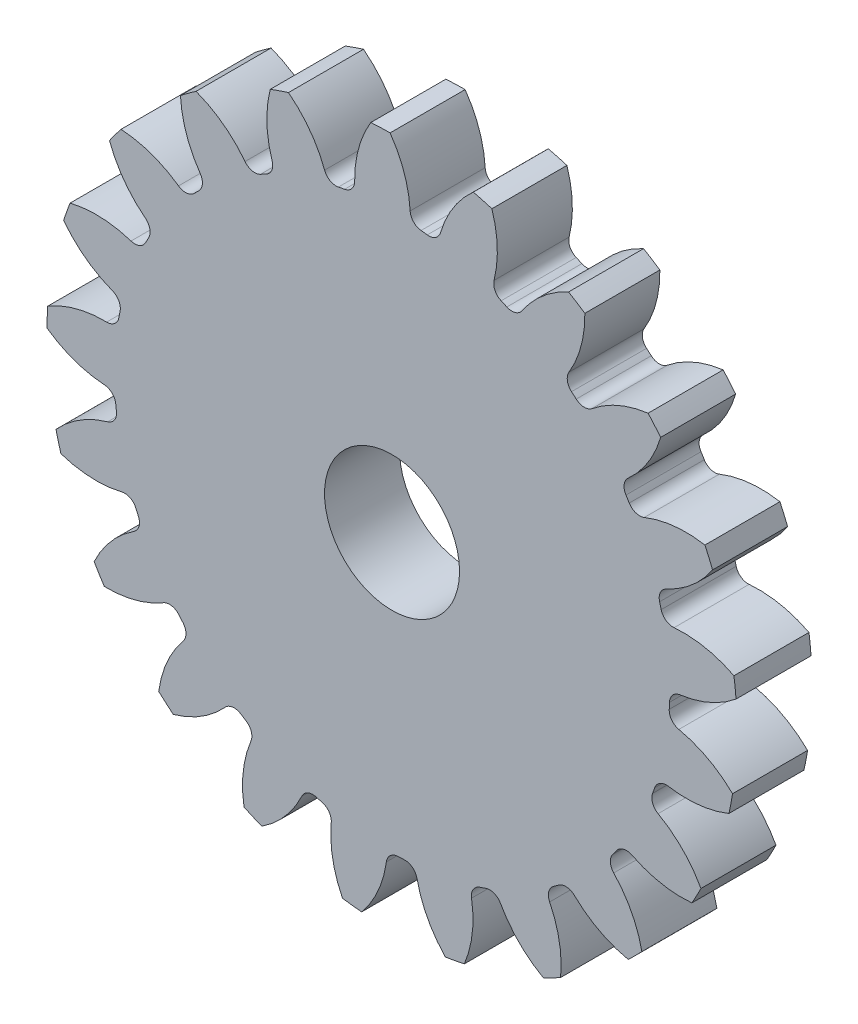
ISO-10303-21;
HEADER;
FILE_DESCRIPTION(('STEP AP214'),'2;1');
FILE_NAME('part.step','',(''),(''),'','','');
FILE_SCHEMA(('AUTOMOTIVE_DESIGN { 1 0 10303 214 1 1 1 1 }'));
ENDSEC;
DATA;
#1=APPLICATION_CONTEXT('core data for automotive mechanical design processes');
#2=APPLICATION_PROTOCOL_DEFINITION('international standard','automotive_design',2000,#1);
#3=PRODUCT_CONTEXT('',#1,'mechanical');
#4=PRODUCT('Part','Part','',(#3));
#5=PRODUCT_RELATED_PRODUCT_CATEGORY('part','',(#4));
#6=PRODUCT_DEFINITION_FORMATION('','',#4);
#7=PRODUCT_DEFINITION_CONTEXT('part definition',#1,'design');
#8=PRODUCT_DEFINITION('design','',#6,#7);
#9=PRODUCT_DEFINITION_SHAPE('','',#8);
#10=(LENGTH_UNIT() NAMED_UNIT(*) SI_UNIT(.MILLI.,.METRE.));
#11=(NAMED_UNIT(*) PLANE_ANGLE_UNIT() SI_UNIT($,.RADIAN.));
#12=(NAMED_UNIT(*) SI_UNIT($,.STERADIAN.) SOLID_ANGLE_UNIT());
#13=UNCERTAINTY_MEASURE_WITH_UNIT(LENGTH_MEASURE(1.E-05),#10,'distance_accuracy_value','');
#14=(GEOMETRIC_REPRESENTATION_CONTEXT(3) GLOBAL_UNCERTAINTY_ASSIGNED_CONTEXT((#13)) GLOBAL_UNIT_ASSIGNED_CONTEXT((#10,
#11,#12)) REPRESENTATION_CONTEXT('',''));
#15=CARTESIAN_POINT('',(0.,0.,0.));
#16=DIRECTION('',(0.,0.,1.));
#17=DIRECTION('',(1.,0.,0.));
#18=AXIS2_PLACEMENT_3D('',#15,#16,#17);
#19=CARTESIAN_POINT('',(0.,0.,127.));
#20=DIRECTION('',(0.,0.,-1.));
#21=DIRECTION('',(-1.,0.,0.));
#22=AXIS2_PLACEMENT_3D('',#19,#20,#21);
#23=CYLINDRICAL_SURFACE('',#22,584.2);
#24=DIRECTION('',(0.,0.,-1.));
#25=VECTOR('',#24,1.);
#26=CARTESIAN_POINT('',(578.778538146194,79.4043058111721,63.5));
#27=LINE('',#26,#25);
#28=CARTESIAN_POINT('',(578.778538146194,79.4043058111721,127.));
#29=VERTEX_POINT('',#28);
#30=CARTESIAN_POINT('',(578.778538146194,79.4043058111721,0.));
#31=VERTEX_POINT('',#30);
#32=EDGE_CURVE('E852',#29,#31,#27,.T.);
#33=ORIENTED_EDGE('',*,*,#32,.F.);
#34=CARTESIAN_POINT('',(0.,0.,127.));
#35=DIRECTION('',(0.,0.,1.));
#36=DIRECTION('',(1.,0.,0.));
#37=AXIS2_PLACEMENT_3D('',#34,#35,#36);
#38=CIRCLE('',#37,584.2);
#39=CARTESIAN_POINT('',(582.313784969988,46.9073110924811,127.));
#40=VERTEX_POINT('',#39);
#41=EDGE_CURVE('E1611',#40,#29,#38,.T.);
#42=ORIENTED_EDGE('',*,*,#41,.F.);
#43=DIRECTION('',(0.,0.,-1.));
#44=VECTOR('',#43,1.);
#45=CARTESIAN_POINT('',(582.313784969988,46.9073110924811,63.5));
#46=LINE('',#45,#44);
#47=CARTESIAN_POINT('',(582.313784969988,46.9073110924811,0.));
#48=VERTEX_POINT('',#47);
#49=EDGE_CURVE('E1605',#48,#40,#46,.F.);
#50=ORIENTED_EDGE('',*,*,#49,.F.);
#51=CARTESIAN_POINT('',(0.,0.,0.));
#52=DIRECTION('',(0.,0.,1.));
#53=DIRECTION('',(1.,0.,0.));
#54=AXIS2_PLACEMENT_3D('',#51,#52,#53);
#55=CIRCLE('',#54,584.2);
#56=EDGE_CURVE('E1616',#48,#31,#55,.T.);
#57=ORIENTED_EDGE('',*,*,#56,.T.);
#58=EDGE_LOOP('',(#33,#42,#50,#57));
#59=FACE_BOUND('',#58,.T.);
#60=ADVANCED_FACE('F33',(#59),#23,.T.);
#61=DIRECTION('',(0.,0.,-1.));
#62=VECTOR('',#61,1.);
#63=CARTESIAN_POINT('',(542.617044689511,216.46335212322,63.5));
#64=LINE('',#63,#62);
#65=CARTESIAN_POINT('',(542.617044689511,216.46335212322,0.));
#66=VERTEX_POINT('',#65);
#67=CARTESIAN_POINT('',(542.617044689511,216.46335212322,127.));
#68=VERTEX_POINT('',#67);
#69=EDGE_CURVE('E823',#66,#68,#64,.F.);
#70=ORIENTED_EDGE('',*,*,#69,.F.);
#71=CARTESIAN_POINT('',(529.660201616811,246.474564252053,0.));
#72=VERTEX_POINT('',#71);
#73=EDGE_CURVE('E1619',#66,#72,#55,.T.);
#74=ORIENTED_EDGE('',*,*,#73,.T.);
#75=DIRECTION('',(0.,0.,-1.));
#76=VECTOR('',#75,1.);
#77=CARTESIAN_POINT('',(529.660201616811,246.474564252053,63.5));
#78=LINE('',#77,#76);
#79=CARTESIAN_POINT('',(529.660201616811,246.474564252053,127.));
#80=VERTEX_POINT('',#79);
#81=EDGE_CURVE('E885',#80,#72,#78,.T.);
#82=ORIENTED_EDGE('',*,*,#81,.F.);
#83=EDGE_CURVE('E1614',#68,#80,#38,.T.);
#84=ORIENTED_EDGE('',*,*,#83,.F.);
#85=EDGE_LOOP('',(#70,#74,#82,#84));
#86=FACE_BOUND('',#85,.T.);
#87=ADVANCED_FACE('F1856',(#86),#23,.T.);
#88=CARTESIAN_POINT('',(0.,0.,127.));
#89=DIRECTION('',(0.,0.,1.));
#90=DIRECTION('',(1.,0.,0.));
#91=AXIS2_PLACEMENT_3D('',#88,#89,#90);
#92=PLANE('',#91);
#93=CARTESIAN_POINT('',(0.,0.,127.000000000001));
#94=DIRECTION('',(0.,0.,1.));
#95=DIRECTION('',(1.,0.,0.));
#96=AXIS2_PLACEMENT_3D('',#93,#94,#95);
#97=CIRCLE('',#96,114.3);
#98=CARTESIAN_POINT('',(114.3,0.,127.000000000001));
#99=VERTEX_POINT('',#98);
#100=EDGE_CURVE('E840',#99,#99,#97,.T.);
#101=ORIENTED_EDGE('',*,*,#100,.F.);
#102=EDGE_LOOP('',(#101));
#103=FACE_BOUND('',#102,.T.);
#104=ORIENTED_EDGE('',*,*,#41,.T.);
#105=CARTESIAN_POINT('',(493.490949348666,-87.7510385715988,127.));
#106=DIRECTION('',(0.,0.,-1.));
#107=DIRECTION('',(0.955572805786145,0.294755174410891,0.));
#108=AXIS2_PLACEMENT_3D('',#105,#106,#107);
#109=CIRCLE('',#108,187.656286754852);
#110=CARTESIAN_POINT('',(477.481524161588,99.2210990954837,127.));
#111=VERTEX_POINT('',#110);
#112=EDGE_CURVE('E832',#111,#29,#109,.T.);
#113=ORIENTED_EDGE('',*,*,#112,.F.);
#114=CARTESIAN_POINT('',(475.717637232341,119.821320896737,127.));
#115=DIRECTION('',(0.,0.,1.));
#116=DIRECTION('',(-0.955572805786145,-0.294755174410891,0.));
#117=AXIS2_PLACEMENT_3D('',#114,#115,#116);
#118=CIRCLE('',#117,20.6756);
#119=CARTESIAN_POINT('',(455.668234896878,114.771380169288,127.));
#120=VERTEX_POINT('',#119);
#121=EDGE_CURVE('E830',#120,#111,#118,.T.);
#122=ORIENTED_EDGE('',*,*,#121,.F.);
#123=CARTESIAN_POINT('',(0.,0.,127.));
#124=DIRECTION('',(0.,0.,-1.));
#125=DIRECTION('',(0.955572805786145,0.294755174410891,0.));
#126=AXIS2_PLACEMENT_3D('',#123,#124,#125);
#127=CIRCLE('',#126,469.9);
#128=CARTESIAN_POINT('',(452.978775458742,124.964951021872,127.));
#129=VERTEX_POINT('',#128);
#130=EDGE_CURVE('E815',#129,#120,#127,.T.);
#131=ORIENTED_EDGE('',*,*,#130,.F.);
#132=CARTESIAN_POINT('',(472.909841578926,130.463408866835,127.));
#133=DIRECTION('',(0.,0.,1.));
#134=DIRECTION('',(-0.955572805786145,-0.294755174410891,0.));
#135=AXIS2_PLACEMENT_3D('',#132,#133,#134);
#136=CIRCLE('',#135,20.6756);
#137=CARTESIAN_POINT('',(464.281307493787,149.252470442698,127.));
#138=VERTEX_POINT('',#137);
#139=EDGE_CURVE('E807',#138,#129,#136,.T.);
#140=ORIENTED_EDGE('',*,*,#139,.F.);
#141=CARTESIAN_POINT('',(385.96683698,319.786120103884,127.));
#142=DIRECTION('',(0.,0.,-1.));
#143=DIRECTION('',(-0.955572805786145,-0.294755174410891,0.));
#144=AXIS2_PLACEMENT_3D('',#141,#142,#143);
#145=CIRCLE('',#144,187.656286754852);
#146=EDGE_CURVE('E837',#68,#138,#145,.T.);
#147=ORIENTED_EDGE('',*,*,#146,.F.);
#148=ORIENTED_EDGE('',*,*,#83,.T.);
#149=CARTESIAN_POINT('',(497.43160377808,61.6065047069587,127.));
#150=DIRECTION('',(0.,0.,-1.));
#151=DIRECTION('',(0.826238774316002,0.563320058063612,0.));
#152=AXIS2_PLACEMENT_3D('',#149,#150,#151);
#153=CIRCLE('',#152,187.656286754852);
#154=CARTESIAN_POINT('',(427.022427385,235.55313398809,127.));
#155=VERTEX_POINT('',#154);
#156=EDGE_CURVE('E861',#155,#80,#153,.T.);
#157=ORIENTED_EDGE('',*,*,#156,.F.);
#158=CARTESIAN_POINT('',(419.264883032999,254.718230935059,127.));
#159=DIRECTION('',(0.,0.,1.));
#160=DIRECTION('',(-0.826238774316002,-0.563320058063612,0.));
#161=AXIS2_PLACEMENT_3D('',#158,#159,#160);
#162=CIRCLE('',#161,20.6756);
#163=CARTESIAN_POINT('',(401.594715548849,243.982979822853,127.));
#164=VERTEX_POINT('',#163);
#165=EDGE_CURVE('E859',#164,#155,#162,.T.);
#166=ORIENTED_EDGE('',*,*,#165,.F.);
#167=CARTESIAN_POINT('',(0.,0.,127.));
#168=DIRECTION('',(0.,0.,-1.));
#169=DIRECTION('',(0.826238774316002,0.563320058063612,0.));
#170=AXIS2_PLACEMENT_3D('',#167,#168,#169);
#171=CIRCLE('',#170,469.9);
#172=CARTESIAN_POINT('',(396.020133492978,252.930946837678,127.));
#173=VERTEX_POINT('',#172);
#174=EDGE_CURVE('E856',#173,#164,#171,.T.);
#175=ORIENTED_EDGE('',*,*,#174,.F.);
#176=CARTESIAN_POINT('',(413.445019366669,264.059908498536,127.));
#177=DIRECTION('',(0.,0.,1.));
#178=DIRECTION('',(-0.826238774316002,-0.563320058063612,0.));
#179=AXIS2_PLACEMENT_3D('',#176,#177,#178);
#180=CIRCLE('',#179,20.6756);
#181=CARTESIAN_POINT('',(399.6616537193,279.470919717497,127.));
#182=VERTEX_POINT('',#181);
#183=EDGE_CURVE('E854',#182,#173,#180,.T.);
#184=ORIENTED_EDGE('',*,*,#183,.F.);
#185=CARTESIAN_POINT('',(274.560799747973,419.344642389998,127.));
#186=DIRECTION('',(0.,0.,-1.));
#187=DIRECTION('',(-0.826238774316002,-0.563320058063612,0.));
#188=AXIS2_PLACEMENT_3D('',#185,#186,#187);
#189=CIRCLE('',#188,187.656286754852);
#190=CARTESIAN_POINT('',(454.70639875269,366.785674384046,127.));
#191=VERTEX_POINT('',#190);
#192=EDGE_CURVE('E864',#191,#182,#189,.T.);
#193=ORIENTED_EDGE('',*,*,#192,.F.);
#194=CARTESIAN_POINT('',(433.479231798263,391.644476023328,127.));
#195=VERTEX_POINT('',#194);
#196=EDGE_CURVE('E1669',#191,#195,#38,.T.);
#197=ORIENTED_EDGE('',*,*,#196,.T.);
#198=CARTESIAN_POINT('',(457.173277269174,205.490039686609,127.));
#199=DIRECTION('',(0.,0.,-1.));
#200=DIRECTION('',(0.623489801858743,0.781831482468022,0.));
#201=AXIS2_PLACEMENT_3D('',#198,#199,#200);
#202=CIRCLE('',#201,187.656286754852);
#203=CARTESIAN_POINT('',(338.620513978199,350.955239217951,127.));
#204=VERTEX_POINT('',#203);
#205=EDGE_CURVE('E896',#204,#195,#202,.T.);
#206=ORIENTED_EDGE('',*,*,#205,.F.);
#207=CARTESIAN_POINT('',(325.55860406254,366.982308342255,127.));
#208=DIRECTION('',(0.,0.,1.));
#209=DIRECTION('',(-0.623489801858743,-0.781831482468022,0.));
#210=AXIS2_PLACEMENT_3D('',#207,#208,#209);
#211=CIRCLE('',#210,20.6756);
#212=CARTESIAN_POINT('',(311.837743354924,351.515621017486,127.));
#213=VERTEX_POINT('',#212);
#214=EDGE_CURVE('E894',#213,#204,#211,.T.);
#215=ORIENTED_EDGE('',*,*,#214,.F.);
#216=CARTESIAN_POINT('',(0.,0.,127.));
#217=DIRECTION('',(0.,0.,-1.));
#218=DIRECTION('',(0.623489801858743,0.781831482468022,0.));
#219=AXIS2_PLACEMENT_3D('',#216,#217,#218);
#220=CIRCLE('',#219,469.9);
#221=CARTESIAN_POINT('',(303.873364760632,358.422918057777,127.));
#222=VERTEX_POINT('',#221);
#223=EDGE_CURVE('E891',#222,#213,#220,.T.);
#224=ORIENTED_EDGE('',*,*,#223,.F.);
#225=CARTESIAN_POINT('',(317.243792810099,374.193526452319,127.));
#226=DIRECTION('',(0.,0.,1.));
#227=DIRECTION('',(-0.623489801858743,-0.781831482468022,0.));
#228=AXIS2_PLACEMENT_3D('',#225,#226,#227);
#229=CIRCLE('',#228,20.6756);
#230=CARTESIAN_POINT('',(299.530308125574,384.857151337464,127.));
#231=VERTEX_POINT('',#230);
#232=EDGE_CURVE('E889',#231,#222,#229,.T.);
#233=ORIENTED_EDGE('',*,*,#232,.F.);
#234=CARTESIAN_POINT('',(138.758830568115,481.642552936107,127.));
#235=DIRECTION('',(0.,0.,-1.));
#236=DIRECTION('',(-0.623489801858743,-0.781831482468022,0.));
#237=AXIS2_PLACEMENT_3D('',#234,#235,#236);
#238=CIRCLE('',#237,187.656286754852);
#239=CARTESIAN_POINT('',(326.393093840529,484.517479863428,127.));
#240=VERTEX_POINT('',#239);
#241=EDGE_CURVE('E899',#240,#231,#238,.T.);
#242=ORIENTED_EDGE('',*,*,#241,.F.);
#243=CARTESIAN_POINT('',(298.781729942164,502.015057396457,127.));
#244=VERTEX_POINT('',#243);
#245=EDGE_CURVE('E1838',#240,#244,#38,.T.);
#246=ORIENTED_EDGE('',*,*,#245,.T.);
#247=CARTESIAN_POINT('',(376.293098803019,331.114882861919,127.));
#248=DIRECTION('',(0.,0.,-1.));
#249=DIRECTION('',(0.365341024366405,0.9308737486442,0.));
#250=AXIS2_PLACEMENT_3D('',#247,#248,#249);
#251=CIRCLE('',#250,187.656286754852);
#252=CARTESIAN_POINT('',(220.130681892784,435.173431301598,127.));
#253=VERTEX_POINT('',#252);
#254=EDGE_CURVE('E934',#253,#244,#251,.T.);
#255=ORIENTED_EDGE('',*,*,#254,.F.);
#256=CARTESIAN_POINT('',(202.925014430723,446.638397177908,127.));
#257=DIRECTION('',(0.,0.,1.));
#258=DIRECTION('',(-0.365341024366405,-0.9308737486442,0.));
#259=AXIS2_PLACEMENT_3D('',#256,#257,#258);
#260=CIRCLE('',#259,20.6756);
#261=CARTESIAN_POINT('',(194.372619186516,427.81455668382,127.));
#262=VERTEX_POINT('',#261);
#263=EDGE_CURVE('E932',#262,#253,#260,.T.);
#264=ORIENTED_EDGE('',*,*,#263,.F.);
#265=CARTESIAN_POINT('',(0.,0.,127.));
#266=DIRECTION('',(0.,0.,-1.));
#267=DIRECTION('',(0.365341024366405,0.9308737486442,0.));
#268=AXIS2_PLACEMENT_3D('',#265,#266,#267);
#269=CIRCLE('',#268,469.9);
#270=CARTESIAN_POINT('',(184.726114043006,432.067440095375,127.));
#271=VERTEX_POINT('',#270);
#272=EDGE_CURVE('E929',#271,#262,#269,.T.);
#273=ORIENTED_EDGE('',*,*,#272,.F.);
#274=CARTESIAN_POINT('',(192.854063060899,451.078407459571,127.));
#275=DIRECTION('',(0.,0.,1.));
#276=DIRECTION('',(-0.365341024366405,-0.9308737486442,0.));
#277=AXIS2_PLACEMENT_3D('',#274,#275,#276);
#278=CIRCLE('',#277,20.6756);
#279=CARTESIAN_POINT('',(172.784380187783,456.047136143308,127.));
#280=VERTEX_POINT('',#279);
#281=EDGE_CURVE('E927',#280,#271,#278,.T.);
#282=ORIENTED_EDGE('',*,*,#281,.F.);
#283=CARTESIAN_POINT('',(-9.37246964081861,501.144409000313,127.));
#284=DIRECTION('',(0.,0.,-1.));
#285=DIRECTION('',(-0.365341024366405,-0.9308737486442,0.));
#286=AXIS2_PLACEMENT_3D('',#283,#284,#285);
#287=CIRCLE('',#286,187.656286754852);
#288=CARTESIAN_POINT('',(169.078330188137,559.197780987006,127.));
#289=VERTEX_POINT('',#288);
#290=EDGE_CURVE('E937',#289,#280,#287,.T.);
#291=ORIENTED_EDGE('',*,*,#290,.F.);
#292=CARTESIAN_POINT('',(137.536160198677,567.779397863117,127.));
#293=VERTEX_POINT('',#292);
#294=EDGE_CURVE('E1834',#289,#293,#38,.T.);
#295=ORIENTED_EDGE('',*,*,#294,.T.);
#296=CARTESIAN_POINT('',(261.977627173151,427.318715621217,127.));
#297=DIRECTION('',(0.,0.,-1.));
#298=DIRECTION('',(0.074730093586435,0.997203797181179,0.));
#299=AXIS2_PLACEMENT_3D('',#296,#297,#298);
#300=CIRCLE('',#299,187.656286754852);
#301=CARTESIAN_POINT('',(82.0812726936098,480.72455428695,127.));
#302=VERTEX_POINT('',#301);
#303=EDGE_CURVE('E972',#302,#293,#300,.T.);
#304=ORIENTED_EDGE('',*,*,#303,.F.);
#305=CARTESIAN_POINT('',(62.2606467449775,486.608704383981,127.));
#306=DIRECTION('',(0.,0.,1.));
#307=DIRECTION('',(-0.074730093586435,-0.997203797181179,0.));
#308=AXIS2_PLACEMENT_3D('',#305,#306,#307);
#309=CIRCLE('',#308,20.6756);
#310=CARTESIAN_POINT('',(59.6366348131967,466.100291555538,127.));
#311=VERTEX_POINT('',#310);
#312=EDGE_CURVE('E970',#311,#302,#309,.T.);
#313=ORIENTED_EDGE('',*,*,#312,.F.);
#314=CARTESIAN_POINT('',(0.,0.,127.));
#315=DIRECTION('',(0.,0.,-1.));
#316=DIRECTION('',(0.074730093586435,0.997203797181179,0.));
#317=AXIS2_PLACEMENT_3D('',#314,#315,#316);
#318=CIRCLE('',#317,469.9);
#319=CARTESIAN_POINT('',(49.1651374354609,467.320873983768,127.));
#320=VERTEX_POINT('',#319);
#321=EDGE_CURVE('E967',#320,#311,#318,.T.);
#322=ORIENTED_EDGE('',*,*,#321,.F.);
#323=CARTESIAN_POINT('',(51.3284034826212,487.882992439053,127.));
#324=DIRECTION('',(0.,0.,1.));
#325=DIRECTION('',(-0.074730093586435,-0.997203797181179,0.));
#326=AXIS2_PLACEMENT_3D('',#323,#324,#325);
#327=CIRCLE('',#326,20.6756);
#328=CARTESIAN_POINT('',(30.6858018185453,486.715331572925,127.));
#329=VERTEX_POINT('',#328);
#330=EDGE_CURVE('E965',#329,#320,#327,.T.);
#331=ORIENTED_EDGE('',*,*,#330,.F.);
#332=CARTESIAN_POINT('',(-156.67098479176,476.117385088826,127.));
#333=DIRECTION('',(0.,0.,-1.));
#334=DIRECTION('',(-0.074730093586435,-0.997203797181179,0.));
#335=AXIS2_PLACEMENT_3D('',#332,#333,#334);
#336=CIRCLE('',#335,187.656286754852);
#337=CARTESIAN_POINT('',(-3.25978508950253,584.190905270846,127.));
#338=VERTEX_POINT('',#337);
#339=EDGE_CURVE('E975',#338,#329,#336,.T.);
#340=ORIENTED_EDGE('',*,*,#339,.F.);
#341=CARTESIAN_POINT('',(-35.9301009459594,583.094047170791,127.));
#342=VERTEX_POINT('',#341);
#343=EDGE_CURVE('E1830',#338,#342,#38,.T.);
#344=ORIENTED_EDGE('',*,*,#343,.T.);
#345=CARTESIAN_POINT('',(124.384293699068,485.553405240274,127.));
#346=DIRECTION('',(0.,0.,-1.));
#347=DIRECTION('',(-0.222520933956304,0.974927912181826,0.));
#348=AXIS2_PLACEMENT_3D('',#345,#346,#347);
#349=CIRCLE('',#348,187.656286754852);
#350=CARTESIAN_POINT('',(-63.2614177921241,483.561190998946,127.));
#351=VERTEX_POINT('',#350);
#352=EDGE_CURVE('E1010',#351,#342,#349,.T.);
#353=ORIENTED_EDGE('',*,*,#352,.F.);
#354=CARTESIAN_POINT('',(-83.9358526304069,483.341692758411,127.));
#355=DIRECTION('',(0.,0.,1.));
#356=DIRECTION('',(0.222520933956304,-0.974927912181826,0.));
#357=AXIS2_PLACEMENT_3D('',#354,#355,#356);
#358=CIRCLE('',#357,20.6756);
#359=CARTESIAN_POINT('',(-80.3983262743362,462.970970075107,127.));
#360=VERTEX_POINT('',#359);
#361=EDGE_CURVE('E1008',#360,#351,#358,.T.);
#362=ORIENTED_EDGE('',*,*,#361,.F.);
#363=CARTESIAN_POINT('',(0.,0.,127.));
#364=DIRECTION('',(0.,0.,-1.));
#365=DIRECTION('',(-0.222520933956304,0.974927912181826,0.));
#366=AXIS2_PLACEMENT_3D('',#363,#364,#365);
#367=CIRCLE('',#366,469.9);
#368=CARTESIAN_POINT('',(-90.7643773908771,461.050797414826,127.));
#369=VERTEX_POINT('',#368);
#370=EDGE_CURVE('E1005',#369,#360,#367,.T.);
#371=ORIENTED_EDGE('',*,*,#370,.F.);
#372=CARTESIAN_POINT('',(-94.7580099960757,481.337032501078,127.));
#373=DIRECTION('',(0.,0.,1.));
#374=DIRECTION('',(0.222520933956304,-0.974927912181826,0.));
#375=AXIS2_PLACEMENT_3D('',#372,#373,#374);
#376=CIRCLE('',#375,20.6756);
#377=CARTESIAN_POINT('',(-114.139344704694,474.136733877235,127.));
#378=VERTEX_POINT('',#377);
#379=EDGE_CURVE('E1003',#378,#369,#376,.T.);
#380=ORIENTED_EDGE('',*,*,#379,.F.);
#381=CARTESIAN_POINT('',(-290.04859540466,408.785242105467,127.));
#382=DIRECTION('',(0.,0.,-1.));
#383=DIRECTION('',(0.222520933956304,-0.974927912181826,0.));
#384=AXIS2_PLACEMENT_3D('',#381,#382,#383);
#385=CIRCLE('',#384,187.656286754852);
#386=CARTESIAN_POINT('',(-175.308254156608,557.276103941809,127.));
#387=VERTEX_POINT('',#386);
#388=EDGE_CURVE('E1013',#387,#378,#385,.T.);
#389=ORIENTED_EDGE('',*,*,#388,.F.);
#390=CARTESIAN_POINT('',(-206.203814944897,546.598231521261,127.));
#391=VERTEX_POINT('',#390);
#392=EDGE_CURVE('E1826',#387,#391,#38,.T.);
#393=ORIENTED_EDGE('',*,*,#392,.T.);
#394=CARTESIAN_POINT('',(-24.26113012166,500.644543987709,127.));
#395=DIRECTION('',(0.,0.,-1.));
#396=DIRECTION('',(-0.499999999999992,0.866025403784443,0.));
#397=AXIS2_PLACEMENT_3D('',#394,#395,#396);
#398=CIRCLE('',#397,187.656286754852);
#399=CARTESIAN_POINT('',(-202.983053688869,443.431293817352,127.));
#400=VERTEX_POINT('',#399);
#401=EDGE_CURVE('E1048',#400,#391,#398,.T.);
#402=ORIENTED_EDGE('',*,*,#401,.F.);
#403=CARTESIAN_POINT('',(-222.674283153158,437.127650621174,127.));
#404=DIRECTION('',(0.,0.,1.));
#405=DIRECTION('',(0.499999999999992,-0.866025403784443,0.));
#406=AXIS2_PLACEMENT_3D('',#403,#404,#405);
#407=CIRCLE('',#406,20.6756);
#408=CARTESIAN_POINT('',(-213.289543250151,418.704646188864,127.));
#409=VERTEX_POINT('',#408);
#410=EDGE_CURVE('E1046',#409,#400,#407,.T.);
#411=ORIENTED_EDGE('',*,*,#410,.F.);
#412=CARTESIAN_POINT('',(0.,0.,127.));
#413=DIRECTION('',(0.,0.,-1.));
#414=DIRECTION('',(-0.499999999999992,0.866025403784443,0.));
#415=AXIS2_PLACEMENT_3D('',#412,#413,#414);
#416=CIRCLE('',#415,469.9);
#417=CARTESIAN_POINT('',(-222.629078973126,413.814334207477,127.));
#418=VERTEX_POINT('',#417);
#419=EDGE_CURVE('E1043',#418,#409,#416,.T.);
#420=ORIENTED_EDGE('',*,*,#419,.F.);
#421=CARTESIAN_POINT('',(-232.424758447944,432.022164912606,127.));
#422=DIRECTION('',(0.,0.,1.));
#423=DIRECTION('',(0.499999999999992,-0.866025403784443,0.));
#424=AXIS2_PLACEMENT_3D('',#421,#422,#423);
#425=CIRCLE('',#424,20.6756);
#426=CARTESIAN_POINT('',(-248.822709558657,419.429006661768,127.));
#427=VERTEX_POINT('',#426);
#428=EDGE_CURVE('E1041',#427,#418,#425,.T.);
#429=ORIENTED_EDGE('',*,*,#428,.F.);
#430=CARTESIAN_POINT('',(-397.654115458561,305.130736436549,127.));
#431=DIRECTION('',(0.,0.,-1.));
#432=DIRECTION('',(0.499999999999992,-0.866025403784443,0.));
#433=AXIS2_PLACEMENT_3D('',#430,#431,#432);
#434=CIRCLE('',#433,187.656286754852);
#435=CARTESIAN_POINT('',(-331.779815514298,480.844875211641,127.));
#436=VERTEX_POINT('',#435);
#437=EDGE_CURVE('E1051',#436,#427,#434,.T.);
#438=ORIENTED_EDGE('',*,*,#437,.F.);
#439=CARTESIAN_POINT('',(-358.155415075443,461.534764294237,127.));
#440=VERTEX_POINT('',#439);
#441=EDGE_CURVE('E1822',#436,#440,#38,.T.);
#442=ORIENTED_EDGE('',*,*,#441,.T.);
#443=CARTESIAN_POINT('',(-170.750846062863,471.251217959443,127.));
#444=DIRECTION('',(0.,0.,-1.));
#445=DIRECTION('',(-0.73305187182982,0.680172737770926,0.));
#446=AXIS2_PLACEMENT_3D('',#443,#444,#445);
#447=CIRCLE('',#446,187.656286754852);
#448=CARTESIAN_POINT('',(-324.668754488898,363.900580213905,127.));
#449=VERTEX_POINT('',#448);
#450=EDGE_CURVE('E1086',#449,#440,#447,.T.);
#451=ORIENTED_EDGE('',*,*,#450,.F.);
#452=CARTESIAN_POINT('',(-341.627126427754,352.072898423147,127.));
#453=DIRECTION('',(0.,0.,1.));
#454=DIRECTION('',(0.73305187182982,-0.680172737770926,0.));
#455=AXIS2_PLACEMENT_3D('',#452,#453,#454);
#456=CIRCLE('',#455,20.6756);
#457=CARTESIAN_POINT('',(-327.229048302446,337.234577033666,127.));
#458=VERTEX_POINT('',#457);
#459=EDGE_CURVE('E1084',#458,#449,#456,.T.);
#460=ORIENTED_EDGE('',*,*,#459,.F.);
#461=CARTESIAN_POINT('',(0.,0.,127.));
#462=DIRECTION('',(0.,0.,-1.));
#463=DIRECTION('',(-0.73305187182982,0.680172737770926,0.));
#464=AXIS2_PLACEMENT_3D('',#461,#462,#463);
#465=CIRCLE('',#464,469.9);
#466=CARTESIAN_POINT('',(-334.712209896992,329.808651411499,127.));
#467=VERTEX_POINT('',#466);
#468=EDGE_CURVE('E1081',#467,#458,#465,.T.);
#469=ORIENTED_EDGE('',*,*,#468,.F.);
#470=CARTESIAN_POINT('',(-349.43954713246,344.320232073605,127.));
#471=DIRECTION('',(0.,0.,1.));
#472=DIRECTION('',(0.73305187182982,-0.680172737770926,0.));
#473=AXIS2_PLACEMENT_3D('',#470,#471,#472);
#474=CIRCLE('',#473,20.6756);
#475=CARTESIAN_POINT('',(-361.397084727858,327.453171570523,127.));
#476=VERTEX_POINT('',#475);
#477=EDGE_CURVE('E1079',#476,#467,#474,.T.);
#478=ORIENTED_EDGE('',*,*,#477,.F.);
#479=CARTESIAN_POINT('',(-469.926322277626,174.364025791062,127.));
#480=DIRECTION('',(0.,0.,-1.));
#481=DIRECTION('',(0.73305187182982,-0.680172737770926,0.));
#482=AXIS2_PLACEMENT_3D('',#479,#480,#481);
#483=CIRCLE('',#482,187.656286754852);
#484=CARTESIAN_POINT('',(-458.771284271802,361.68846916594,127.));
#485=VERTEX_POINT('',#484);
#486=EDGE_CURVE('E1089',#485,#476,#483,.T.);
#487=ORIENTED_EDGE('',*,*,#486,.F.);
#488=CARTESIAN_POINT('',(-478.283334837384,335.461907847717,127.));
#489=VERTEX_POINT('',#488);
#490=EDGE_CURVE('E1818',#485,#489,#38,.T.);
#491=ORIENTED_EDGE('',*,*,#490,.T.);
#492=CARTESIAN_POINT('',(-302.068600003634,399.985153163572,127.));
#493=DIRECTION('',(0.,0.,-1.));
#494=DIRECTION('',(-0.900968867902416,0.433883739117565,0.));
#495=AXIS2_PLACEMENT_3D('',#492,#493,#494);
#496=CIRCLE('',#495,187.656286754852);
#497=CARTESIAN_POINT('',(-417.506211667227,252.035703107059,127.));
#498=VERTEX_POINT('',#497);
#499=EDGE_CURVE('E1124',#498,#489,#496,.T.);
#500=ORIENTED_EDGE('',*,*,#499,.F.);
#501=CARTESIAN_POINT('',(-430.224900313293,235.734924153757,127.));
#502=DIRECTION('',(0.,0.,1.));
#503=DIRECTION('',(0.900968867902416,-0.433883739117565,0.));
#504=AXIS2_PLACEMENT_3D('',#501,#502,#503);
#505=CIRCLE('',#504,20.6756);
#506=CARTESIAN_POINT('',(-412.092816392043,225.79973577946,127.));
#507=VERTEX_POINT('',#506);
#508=EDGE_CURVE('E1122',#507,#498,#505,.T.);
#509=ORIENTED_EDGE('',*,*,#508,.F.);
#510=CARTESIAN_POINT('',(0.,0.,127.));
#511=DIRECTION('',(0.,0.,-1.));
#512=DIRECTION('',(-0.900968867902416,0.433883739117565,0.));
#513=AXIS2_PLACEMENT_3D('',#510,#511,#512);
#514=CIRCLE('',#513,469.9);
#515=CARTESIAN_POINT('',(-417.05469211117,216.498022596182,127.));
#516=VERTEX_POINT('',#515);
#517=EDGE_CURVE('E1119',#516,#507,#514,.T.);
#518=ORIENTED_EDGE('',*,*,#517,.F.);
#519=CARTESIAN_POINT('',(-435.405098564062,226.023935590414,127.));
#520=DIRECTION('',(0.,0.,1.));
#521=DIRECTION('',(0.900968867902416,-0.433883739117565,0.));
#522=AXIS2_PLACEMENT_3D('',#519,#520,#521);
#523=CIRCLE('',#522,20.6756);
#524=CARTESIAN_POINT('',(-441.859742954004,206.381685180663,127.));
#525=VERTEX_POINT('',#524);
#526=EDGE_CURVE('E1117',#525,#516,#523,.T.);
#527=ORIENTED_EDGE('',*,*,#526,.F.);
#528=CARTESIAN_POINT('',(-500.443513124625,28.1043062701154,127.));
#529=DIRECTION('',(0.,0.,-1.));
#530=DIRECTION('',(0.900968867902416,-0.433883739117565,0.));
#531=AXIS2_PLACEMENT_3D('',#528,#529,#530);
#532=CIRCLE('',#531,187.656286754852);
#533=CARTESIAN_POINT('',(-544.998911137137,210.394455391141,127.));
#534=VERTEX_POINT('',#533);
#535=EDGE_CURVE('E1127',#534,#525,#532,.T.);
#536=ORIENTED_EDGE('',*,*,#535,.F.);
#537=CARTESIAN_POINT('',(-555.91368138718,179.581788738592,127.));
#538=VERTEX_POINT('',#537);
#539=EDGE_CURVE('E1814',#534,#538,#38,.T.);
#540=ORIENTED_EDGE('',*,*,#539,.T.);
#541=CARTESIAN_POINT('',(-406.546233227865,293.178652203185,127.));
#542=DIRECTION('',(0.,0.,-1.));
#543=DIRECTION('',(-0.988830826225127,0.149042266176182,0.));
#544=AXIS2_PLACEMENT_3D('',#541,#542,#543);
#545=CIRCLE('',#544,187.656286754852);
#546=CARTESIAN_POINT('',(-473.246409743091,117.776347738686,127.));
#547=VERTEX_POINT('',#546);
#548=EDGE_CURVE('E1162',#547,#538,#545,.T.);
#549=ORIENTED_EDGE('',*,*,#548,.F.);
#550=CARTESIAN_POINT('',(-480.595303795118,98.4508673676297,127.));
#551=DIRECTION('',(0.,0.,1.));
#552=DIRECTION('',(0.988830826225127,-0.149042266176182,0.));
#553=AXIS2_PLACEMENT_3D('',#550,#551,#552);
#554=CIRCLE('',#553,20.6756);
#555=CARTESIAN_POINT('',(-460.340329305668,94.3015970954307,127.));
#556=VERTEX_POINT('',#555);
#557=EDGE_CURVE('E1160',#556,#547,#554,.T.);
#558=ORIENTED_EDGE('',*,*,#557,.F.);
#559=CARTESIAN_POINT('',(0.,0.,127.));
#560=DIRECTION('',(0.,0.,-1.));
#561=DIRECTION('',(-0.988830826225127,0.149042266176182,0.));
#562=AXIS2_PLACEMENT_3D('',#559,#560,#561);
#563=CIRCLE('',#562,469.9);
#564=CARTESIAN_POINT('',(-462.3400347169,83.9505943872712,127.));
#565=VERTEX_POINT('',#564);
#566=EDGE_CURVE('E1157',#565,#556,#563,.T.);
#567=ORIENTED_EDGE('',*,*,#566,.F.);
#568=CARTESIAN_POINT('',(-482.682996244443,87.6444205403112,127.));
#569=DIRECTION('',(0.,0.,1.));
#570=DIRECTION('',(0.988830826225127,-0.149042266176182,0.));
#571=AXIS2_PLACEMENT_3D('',#568,#569,#570);
#572=CIRCLE('',#571,20.6756);
#573=CARTESIAN_POINT('',(-483.061223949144,66.9722803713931,127.));
#574=VERTEX_POINT('',#573);
#575=EDGE_CURVE('E1155',#574,#565,#572,.T.);
#576=ORIENTED_EDGE('',*,*,#575,.F.);
#577=CARTESIAN_POINT('',(-486.494101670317,-120.652604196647,127.));
#578=DIRECTION('',(0.,0.,-1.));
#579=DIRECTION('',(0.988830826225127,-0.149042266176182,0.));
#580=AXIS2_PLACEMENT_3D('',#577,#578,#579);
#581=CIRCLE('',#580,187.656286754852);
#582=CARTESIAN_POINT('',(-582.800993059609,40.4059709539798,127.));
#583=VERTEX_POINT('',#582);
#584=EDGE_CURVE('E1165',#583,#574,#581,.T.);
#585=ORIENTED_EDGE('',*,*,#584,.F.);
#586=CARTESIAN_POINT('',(-584.148657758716,7.74503961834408,127.));
#587=VERTEX_POINT('',#586);
#588=EDGE_CURVE('E1810',#583,#587,#38,.T.);
#589=ORIENTED_EDGE('',*,*,#588,.T.);
#590=CARTESIAN_POINT('',(-474.900449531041,160.321941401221,127.));
#591=DIRECTION('',(0.,0.,-1.));
#592=DIRECTION('',(-0.98883082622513,-0.149042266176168,0.));
#593=AXIS2_PLACEMENT_3D('',#590,#591,#592);
#594=CIRCLE('',#593,187.656286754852);
#595=CARTESIAN_POINT('',(-486.936587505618,-26.947952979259,127.));
#596=VERTEX_POINT('',#595);
#597=EDGE_CURVE('E1200',#596,#587,#594,.T.);
#598=ORIENTED_EDGE('',*,*,#597,.F.);
#599=CARTESIAN_POINT('',(-488.262705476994,-47.5809810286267,127.));
#600=DIRECTION('',(0.,0.,1.));
#601=DIRECTION('',(0.98883082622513,0.149042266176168,0.));
#602=AXIS2_PLACEMENT_3D('',#599,#600,#601);
#603=CIRCLE('',#602,20.6756);
#604=CARTESIAN_POINT('',(-467.684583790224,-45.5756523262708,127.));
#605=VERTEX_POINT('',#604);
#606=EDGE_CURVE('E1198',#605,#596,#603,.T.);
#607=ORIENTED_EDGE('',*,*,#606,.F.);
#608=CARTESIAN_POINT('',(0.,0.,127.));
#609=DIRECTION('',(0.,0.,-1.));
#610=DIRECTION('',(-0.98883082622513,-0.149042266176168,0.));
#611=AXIS2_PLACEMENT_3D('',#608,#609,#610);
#612=CIRCLE('',#611,469.9);
#613=CARTESIAN_POINT('',(-466.544436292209,-56.0562125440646,127.));
#614=VERTEX_POINT('',#613);
#615=EDGE_CURVE('E1195',#614,#605,#612,.T.);
#616=ORIENTED_EDGE('',*,*,#615,.F.);
#617=CARTESIAN_POINT('',(-487.072391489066,-58.5226858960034,127.));
#618=DIRECTION('',(0.,0.,1.));
#619=DIRECTION('',(0.98883082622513,0.149042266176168,0.));
#620=AXIS2_PLACEMENT_3D('',#617,#618,#619);
#621=CIRCLE('',#620,20.6756);
#622=CARTESIAN_POINT('',(-481.340595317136,-78.3879054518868,127.));
#623=VERTEX_POINT('',#622);
#624=EDGE_CURVE('E1193',#623,#614,#621,.T.);
#625=ORIENTED_EDGE('',*,*,#624,.F.);
#626=CARTESIAN_POINT('',(-429.3175543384,-258.689001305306,127.));
#627=DIRECTION('',(0.,0.,-1.));
#628=DIRECTION('',(0.98883082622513,0.149042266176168,0.));
#629=AXIS2_PLACEMENT_3D('',#626,#627,#628);
#630=CIRCLE('',#629,187.656286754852);
#631=CARTESIAN_POINT('',(-568.818649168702,-133.172761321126,127.));
#632=VERTEX_POINT('',#631);
#633=EDGE_CURVE('E1203',#632,#623,#630,.T.);
#634=ORIENTED_EDGE('',*,*,#633,.F.);
#635=CARTESIAN_POINT('',(-560.479462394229,-164.779890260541,127.));
#636=VERTEX_POINT('',#635);
#637=EDGE_CURVE('E1806',#632,#636,#38,.T.);
#638=ORIENTED_EDGE('',*,*,#637,.T.);
#639=CARTESIAN_POINT('',(-501.057676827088,13.2199225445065,127.));
#640=DIRECTION('',(0.,0.,-1.));
#641=DIRECTION('',(-0.900968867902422,-0.433883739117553,0.));
#642=AXIS2_PLACEMENT_3D('',#639,#640,#641);
#643=CIRCLE('',#642,187.656286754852);
#644=CARTESIAN_POINT('',(-457.360312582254,-169.277809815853,127.));
#645=VERTEX_POINT('',#644);
#646=EDGE_CURVE('E1238',#645,#636,#643,.T.);
#647=ORIENTED_EDGE('',*,*,#646,.F.);
#648=CARTESIAN_POINT('',(-452.545823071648,-189.385050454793,127.));
#649=DIRECTION('',(0.,0.,1.));
#650=DIRECTION('',(0.900968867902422,0.433883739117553,0.));
#651=AXIS2_PLACEMENT_3D('',#648,#649,#650);
#652=CIRCLE('',#651,20.6756);
#653=CARTESIAN_POINT('',(-433.473010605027,-181.403305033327,127.));
#654=VERTEX_POINT('',#653);
#655=EDGE_CURVE('E1236',#654,#645,#652,.T.);
#656=ORIENTED_EDGE('',*,*,#655,.F.);
#657=CARTESIAN_POINT('',(0.,0.,127.));
#658=DIRECTION('',(0.,0.,-1.));
#659=DIRECTION('',(-0.900968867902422,-0.433883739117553,0.));
#660=AXIS2_PLACEMENT_3D('',#657,#658,#659);
#661=CIRCLE('',#660,469.9);
#662=CARTESIAN_POINT('',(-429.294317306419,-191.082178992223,127.));
#663=VERTEX_POINT('',#662);
#664=EDGE_CURVE('E1233',#663,#654,#661,.T.);
#665=ORIENTED_EDGE('',*,*,#664,.F.);
#666=CARTESIAN_POINT('',(-448.183267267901,-199.489794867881,127.));
#667=DIRECTION('',(0.,0.,1.));
#668=DIRECTION('',(0.900968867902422,0.433883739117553,0.));
#669=AXIS2_PLACEMENT_3D('',#666,#667,#668);
#670=CIRCLE('',#669,20.6756);
#671=CARTESIAN_POINT('',(-436.850742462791,-216.78298187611,127.));
#672=VERTEX_POINT('',#671);
#673=EDGE_CURVE('E1231',#672,#663,#670,.T.);
#674=ORIENTED_EDGE('',*,*,#673,.F.);
#675=CARTESIAN_POINT('',(-333.99425827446,-373.739745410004,127.));
#676=DIRECTION('',(0.,0.,-1.));
#677=DIRECTION('',(0.900968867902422,0.433883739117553,0.));
#678=AXIS2_PLACEMENT_3D('',#675,#676,#677);
#679=CIRCLE('',#678,187.656286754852);
#680=CARTESIAN_POINT('',(-504.294272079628,-294.918509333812,127.));
#681=VERTEX_POINT('',#680);
#682=EDGE_CURVE('E1241',#681,#672,#679,.T.);
#683=ORIENTED_EDGE('',*,*,#682,.F.);
#684=CARTESIAN_POINT('',(-487.009207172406,-322.663403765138,127.));
#685=VERTEX_POINT('',#684);
#686=EDGE_CURVE('E1802',#681,#685,#38,.T.);
#687=ORIENTED_EDGE('',*,*,#686,.T.);
#688=CARTESIAN_POINT('',(-482.693730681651,-135.056744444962,127.));
#689=DIRECTION('',(0.,0.,-1.));
#690=DIRECTION('',(-0.73305187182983,-0.680172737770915,0.));
#691=AXIS2_PLACEMENT_3D('',#688,#689,#690);
#692=CIRCLE('',#691,187.656286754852);
#693=CARTESIAN_POINT('',(-387.145566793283,-296.566590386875,127.));
#694=VERTEX_POINT('',#693);
#695=EDGE_CURVE('E1276',#694,#685,#692,.T.);
#696=ORIENTED_EDGE('',*,*,#695,.F.);
#697=CARTESIAN_POINT('',(-376.618258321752,-314.361427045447,127.));
#698=DIRECTION('',(0.,0.,1.));
#699=DIRECTION('',(0.73305187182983,0.680172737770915,0.));
#700=AXIS2_PLACEMENT_3D('',#697,#698,#699);
#701=CIRCLE('',#700,20.6756);
#702=CARTESIAN_POINT('',(-360.745458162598,-301.11247801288,127.));
#703=VERTEX_POINT('',#702);
#704=EDGE_CURVE('E1274',#703,#694,#701,.T.);
#705=ORIENTED_EDGE('',*,*,#704,.F.);
#706=CARTESIAN_POINT('',(0.,0.,127.));
#707=DIRECTION('',(0.,0.,-1.));
#708=DIRECTION('',(-0.73305187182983,-0.680172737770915,0.));
#709=AXIS2_PLACEMENT_3D('',#706,#707,#708);
#710=CIRCLE('',#709,469.9);
#711=CARTESIAN_POINT('',(-353.899514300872,-309.129655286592,127.));
#712=VERTEX_POINT('',#711);
#713=EDGE_CURVE('E1271',#712,#703,#710,.T.);
#714=ORIENTED_EDGE('',*,*,#713,.F.);
#715=CARTESIAN_POINT('',(-369.47109293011,-322.731360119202,127.));
#716=DIRECTION('',(0.,0.,1.));
#717=DIRECTION('',(0.73305187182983,0.680172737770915,0.));
#718=AXIS2_PLACEMENT_3D('',#715,#716,#717);
#719=CIRCLE('',#718,20.6756);
#720=CARTESIAN_POINT('',(-353.544784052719,-335.915939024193,127.));
#721=VERTEX_POINT('',#720);
#722=EDGE_CURVE('E1269',#721,#712,#719,.T.);
#723=ORIENTED_EDGE('',*,*,#722,.F.);
#724=CARTESIAN_POINT('',(-208.994106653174,-455.582073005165,127.));
#725=DIRECTION('',(0.,0.,-1.));
#726=DIRECTION('',(0.73305187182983,0.680172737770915,0.));
#727=AXIS2_PLACEMENT_3D('',#724,#725,#726);
#728=CIRCLE('',#727,187.656286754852);
#729=CARTESIAN_POINT('',(-394.961135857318,-430.459453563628,127.));
#730=VERTEX_POINT('',#729);
#731=EDGE_CURVE('E1279',#730,#721,#728,.T.);
#732=ORIENTED_EDGE('',*,*,#731,.F.);
#733=CARTESIAN_POINT('',(-370.26604668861,-451.876857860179,127.));
#734=VERTEX_POINT('',#733);
#735=EDGE_CURVE('E1798',#730,#734,#38,.T.);
#736=ORIENTED_EDGE('',*,*,#735,.T.);
#737=CARTESIAN_POINT('',(-421.440328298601,-271.333027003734,127.));
#738=DIRECTION('',(0.,0.,-1.));
#739=DIRECTION('',(-0.500000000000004,-0.866025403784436,0.));
#740=AXIS2_PLACEMENT_3D('',#737,#738,#739);
#741=CIRCLE('',#740,187.656286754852);
#742=CARTESIAN_POINT('',(-282.531238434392,-397.504127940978,127.));
#743=VERTEX_POINT('',#742);
#744=EDGE_CURVE('E1314',#743,#734,#741,.T.);
#745=ORIENTED_EDGE('',*,*,#744,.F.);
#746=CARTESIAN_POINT('',(-267.226508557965,-411.405411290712,127.));
#747=DIRECTION('',(0.,0.,1.));
#748=DIRECTION('',(0.500000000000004,0.866025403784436,0.));
#749=AXIS2_PLACEMENT_3D('',#746,#747,#748);
#750=CIRCLE('',#749,20.6756);
#751=CARTESIAN_POINT('',(-255.964088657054,-394.066485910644,127.));
#752=VERTEX_POINT('',#751);
#753=EDGE_CURVE('E1312',#752,#743,#750,.T.);
#754=ORIENTED_EDGE('',*,*,#753,.F.);
#755=CARTESIAN_POINT('',(0.,0.,127.));
#756=DIRECTION('',(0.,0.,-1.));
#757=DIRECTION('',(-0.500000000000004,-0.866025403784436,0.));
#758=AXIS2_PLACEMENT_3D('',#755,#756,#757);
#759=CIRCLE('',#758,469.9);
#760=CARTESIAN_POINT('',(-247.059186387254,-399.709605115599,127.));
#761=VERTEX_POINT('',#760);
#762=EDGE_CURVE('E1309',#761,#752,#759,.T.);
#763=ORIENTED_EDGE('',*,*,#762,.F.);
#764=CARTESIAN_POINT('',(-257.929790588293,-417.296827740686,127.));
#765=DIRECTION('',(0.,0.,1.));
#766=DIRECTION('',(0.500000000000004,0.866025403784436,0.));
#767=AXIS2_PLACEMENT_3D('',#764,#765,#766);
#768=CIRCLE('',#767,20.6756);
#769=CARTESIAN_POINT('',(-238.824820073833,-425.201290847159,127.));
#770=VERTEX_POINT('',#769);
#771=EDGE_CURVE('E1307',#770,#761,#768,.T.);
#772=ORIENTED_EDGE('',*,*,#771,.F.);
#773=CARTESIAN_POINT('',(-65.4239115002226,-496.943934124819,127.));
#774=DIRECTION('',(0.,0.,-1.));
#775=DIRECTION('',(0.500000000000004,0.866025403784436,0.));
#776=AXIS2_PLACEMENT_3D('',#773,#774,#775);
#777=CIRCLE('',#776,187.656286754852);
#778=CARTESIAN_POINT('',(-250.533969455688,-527.752186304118,127.));
#779=VERTEX_POINT('',#778);
#780=EDGE_CURVE('E1317',#779,#770,#777,.T.);
#781=ORIENTED_EDGE('',*,*,#780,.F.);
#782=CARTESIAN_POINT('',(-220.623123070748,-540.939070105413,127.));
#783=VERTEX_POINT('',#782);
#784=EDGE_CURVE('E1794',#779,#783,#38,.T.);
#785=ORIENTED_EDGE('',*,*,#784,.T.);
#786=CARTESIAN_POINT('',(-322.740103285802,-383.500179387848,127.));
#787=DIRECTION('',(0.,0.,-1.));
#788=DIRECTION('',(-0.222520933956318,-0.974927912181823,0.));
#789=AXIS2_PLACEMENT_3D('',#786,#787,#788);
#790=CIRCLE('',#789,187.656286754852);
#791=CARTESIAN_POINT('',(-152.812769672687,-463.121679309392,127.));
#792=VERTEX_POINT('',#791);
#793=EDGE_CURVE('E1352',#792,#783,#790,.T.);
#794=ORIENTED_EDGE('',*,*,#793,.F.);
#795=CARTESIAN_POINT('',(-134.090510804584,-471.894219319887,127.));
#796=DIRECTION('',(0.,0.,1.));
#797=DIRECTION('',(0.222520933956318,0.974927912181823,0.));
#798=AXIS2_PLACEMENT_3D('',#795,#796,#797);
#799=CIRCLE('',#798,20.6756);
#800=CARTESIAN_POINT('',(-128.439186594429,-452.005957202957,127.));
#801=VERTEX_POINT('',#800);
#802=EDGE_CURVE('E1350',#801,#792,#799,.T.);
#803=ORIENTED_EDGE('',*,*,#802,.F.);
#804=CARTESIAN_POINT('',(0.,0.,127.));
#805=DIRECTION('',(0.,0.,-1.));
#806=DIRECTION('',(-0.222520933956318,-0.974927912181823,0.));
#807=AXIS2_PLACEMENT_3D('',#804,#805,#806);
#808=CIRCLE('',#807,469.9);
#809=CARTESIAN_POINT('',(-118.266565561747,-454.773602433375,127.));
#810=VERTEX_POINT('',#809);
#811=EDGE_CURVE('E1347',#810,#801,#808,.T.);
#812=ORIENTED_EDGE('',*,*,#811,.F.);
#813=CARTESIAN_POINT('',(-123.470294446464,-474.783640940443,127.));
#814=DIRECTION('',(0.,0.,1.));
#815=DIRECTION('',(0.222520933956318,0.974927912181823,0.));
#816=AXIS2_PLACEMENT_3D('',#813,#814,#815);
#817=CIRCLE('',#816,20.6756);
#818=CARTESIAN_POINT('',(-102.884222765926,-476.705642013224,127.));
#819=VERTEX_POINT('',#818);
#820=EDGE_CURVE('E1345',#819,#810,#817,.T.);
#821=ORIENTED_EDGE('',*,*,#820,.F.);
#822=CARTESIAN_POINT('',(83.9594852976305,-494.150145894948,127.));
#823=DIRECTION('',(0.,0.,-1.));
#824=DIRECTION('',(0.222520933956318,0.974927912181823,0.));
#825=AXIS2_PLACEMENT_3D('',#822,#823,#824);
#826=CIRCLE('',#825,187.656286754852);
#827=CARTESIAN_POINT('',(-83.8457604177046,-578.151821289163,127.));
#828=VERTEX_POINT('',#827);
#829=EDGE_CURVE('E1355',#828,#819,#826,.T.);
#830=ORIENTED_EDGE('',*,*,#829,.F.);
#831=CARTESIAN_POINT('',(-51.3768667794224,-581.936472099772,127.));
#832=VERTEX_POINT('',#831);
#833=EDGE_CURVE('E1790',#828,#832,#38,.T.);
#834=ORIENTED_EDGE('',*,*,#833,.T.);
#835=CARTESIAN_POINT('',(-195.363003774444,-461.591657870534,127.));
#836=DIRECTION('',(0.,0.,-1.));
#837=DIRECTION('',(0.0747300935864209,-0.997203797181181,0.));
#838=AXIS2_PLACEMENT_3D('',#835,#836,#837);
#839=CIRCLE('',#838,187.656286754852);
#840=CARTESIAN_POINT('',(-9.51621571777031,-487.588837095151,127.));
#841=VERTEX_POINT('',#840);
#842=EDGE_CURVE('E1390',#841,#832,#839,.T.);
#843=ORIENTED_EDGE('',*,*,#842,.F.);
#844=CARTESIAN_POINT('',(10.9600172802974,-490.453155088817,127.));
#845=DIRECTION('',(0.,0.,1.));
#846=DIRECTION('',(-0.0747300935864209,0.997203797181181,0.));
#847=AXIS2_PLACEMENT_3D('',#844,#845,#846);
#848=CIRCLE('',#847,20.6756);
#849=CARTESIAN_POINT('',(10.4981008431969,-469.782715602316,127.));
#850=VERTEX_POINT('',#849);
#851=EDGE_CURVE('E1388',#850,#841,#848,.T.);
#852=ORIENTED_EDGE('',*,*,#851,.F.);
#853=CARTESIAN_POINT('',(0.,0.,127.));
#854=DIRECTION('',(0.,0.,-1.));
#855=DIRECTION('',(0.0747300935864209,-0.997203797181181,0.));
#856=AXIS2_PLACEMENT_3D('',#853,#854,#855);
#857=CIRCLE('',#856,469.9);
#858=CARTESIAN_POINT('',(21.0345586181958,-469.428969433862,127.));
#859=VERTEX_POINT('',#858);
#860=EDGE_CURVE('E1385',#859,#850,#857,.T.);
#861=ORIENTED_EDGE('',*,*,#860,.F.);
#862=CARTESIAN_POINT('',(21.9600791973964,-490.083844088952,127.));
#863=DIRECTION('',(0.,0.,1.));
#864=DIRECTION('',(-0.0747300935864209,0.997203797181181,0.));
#865=AXIS2_PLACEMENT_3D('',#862,#863,#864);
#866=CIRCLE('',#865,20.6756);
#867=CARTESIAN_POINT('',(42.1980892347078,-485.852604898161,127.));
#868=VERTEX_POINT('',#867);
#869=EDGE_CURVE('E1383',#868,#859,#866,.T.);
#870=ORIENTED_EDGE('',*,*,#869,.F.);
#871=CARTESIAN_POINT('',(225.882713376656,-447.448948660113,127.));
#872=DIRECTION('',(0.,0.,-1.));
#873=DIRECTION('',(-0.0747300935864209,0.997203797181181,0.));
#874=AXIS2_PLACEMENT_3D('',#871,#872,#873);
#875=CIRCLE('',#874,187.656286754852);
#876=CARTESIAN_POINT('',(90.2925123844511,-577.180129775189,127.));
#877=VERTEX_POINT('',#876);
#878=EDGE_CURVE('E1393',#877,#868,#875,.T.);
#879=ORIENTED_EDGE('',*,*,#878,.F.);
#880=CARTESIAN_POINT('',(122.434449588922,-571.226264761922,127.));
#881=VERTEX_POINT('',#880);
#882=EDGE_CURVE('E1786',#877,#881,#38,.T.);
#883=ORIENTED_EDGE('',*,*,#882,.T.);
#884=CARTESIAN_POINT('',(-50.6270440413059,-498.668691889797,127.));
#885=DIRECTION('',(0.,0.,-1.));
#886=DIRECTION('',(0.365341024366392,-0.930873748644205,0.));
#887=AXIS2_PLACEMENT_3D('',#884,#885,#886);
#888=CIRCLE('',#887,187.656286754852);
#889=CARTESIAN_POINT('',(134.625895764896,-468.731586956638,127.));
#890=VERTEX_POINT('',#889);
#891=EDGE_CURVE('E1428',#890,#881,#888,.T.);
#892=ORIENTED_EDGE('',*,*,#891,.F.);
#893=CARTESIAN_POINT('',(155.036699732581,-465.433175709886,127.));
#894=DIRECTION('',(0.,0.,1.));
#895=DIRECTION('',(-0.365341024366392,0.930873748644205,0.));
#896=AXIS2_PLACEMENT_3D('',#893,#894,#895);
#897=CIRCLE('',#896,20.6756);
#898=CARTESIAN_POINT('',(148.502585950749,-445.817218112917,127.));
#899=VERTEX_POINT('',#898);
#900=EDGE_CURVE('E1426',#899,#890,#897,.T.);
#901=ORIENTED_EDGE('',*,*,#900,.F.);
#902=CARTESIAN_POINT('',(0.,0.,127.));
#903=DIRECTION('',(0.,0.,-1.));
#904=DIRECTION('',(0.365341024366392,-0.930873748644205,0.));
#905=AXIS2_PLACEMENT_3D('',#902,#903,#904);
#906=CIRCLE('',#905,469.9);
#907=CARTESIAN_POINT('',(158.466669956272,-442.373512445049,127.));
#908=VERTEX_POINT('',#907);
#909=EDGE_CURVE('E1423',#908,#899,#906,.T.);
#910=ORIENTED_EDGE('',*,*,#909,.F.);
#911=CARTESIAN_POINT('',(165.439203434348,-461.837946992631,127.));
#912=DIRECTION('',(0.,0.,1.));
#913=DIRECTION('',(-0.365341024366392,0.930873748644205,0.));
#914=AXIS2_PLACEMENT_3D('',#911,#912,#913);
#915=CIRCLE('',#914,20.6756);
#916=CARTESIAN_POINT('',(183.530915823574,-451.829431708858,127.));
#917=VERTEX_POINT('',#916);
#918=EDGE_CURVE('E1421',#917,#908,#915,.T.);
#919=ORIENTED_EDGE('',*,*,#918,.F.);
#920=CARTESIAN_POINT('',(347.735271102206,-360.989948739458,127.));
#921=DIRECTION('',(0.,0.,-1.));
#922=DIRECTION('',(-0.365341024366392,0.930873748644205,0.));
#923=AXIS2_PLACEMENT_3D('',#920,#921,#922);
#924=CIRCLE('',#923,187.656286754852);
#925=CARTESIAN_POINT('',(256.407899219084,-524.923450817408,127.));
#926=VERTEX_POINT('',#925);
#927=EDGE_CURVE('E1431',#926,#917,#924,.T.);
#928=ORIENTED_EDGE('',*,*,#927,.F.);
#929=CARTESIAN_POINT('',(285.366927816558,-509.760097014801,127.));
#930=VERTEX_POINT('',#929);
#931=EDGE_CURVE('E1782',#926,#930,#38,.T.);
#932=ORIENTED_EDGE('',*,*,#931,.T.);
#933=CARTESIAN_POINT('',(98.6073507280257,-491.436824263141,127.));
#934=DIRECTION('',(0.,0.,-1.));
#935=DIRECTION('',(0.623489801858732,-0.781831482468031,0.));
#936=AXIS2_PLACEMENT_3D('',#933,#934,#935);
#937=CIRCLE('',#936,187.656286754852);
#938=CARTESIAN_POINT('',(266.805905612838,-408.225478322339,127.));
#939=VERTEX_POINT('',#938);
#940=EDGE_CURVE('E1466',#939,#930,#937,.T.);
#941=ORIENTED_EDGE('',*,*,#940,.F.);
#942=CARTESIAN_POINT('',(285.337691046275,-399.057416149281,127.));
#943=DIRECTION('',(0.,0.,1.));
#944=DIRECTION('',(-0.623489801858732,0.781831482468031,0.));
#945=AXIS2_PLACEMENT_3D('',#942,#943,#944);
#946=CIRCLE('',#945,20.6756);
#947=CARTESIAN_POINT('',(273.311964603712,-382.238904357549,127.));
#948=VERTEX_POINT('',#947);
#949=EDGE_CURVE('E1464',#948,#939,#946,.T.);
#950=ORIENTED_EDGE('',*,*,#949,.F.);
#951=CARTESIAN_POINT('',(0.,0.,127.));
#952=DIRECTION('',(0.,0.,-1.));
#953=DIRECTION('',(0.623489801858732,-0.781831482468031,0.));
#954=AXIS2_PLACEMENT_3D('',#951,#952,#953);
#955=CIRCLE('',#954,469.9);
#956=CARTESIAN_POINT('',(281.818322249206,-376.01122755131,127.));
#957=VERTEX_POINT('',#956);
#958=EDGE_CURVE('E1461',#957,#948,#955,.T.);
#959=ORIENTED_EDGE('',*,*,#958,.F.);
#960=CARTESIAN_POINT('',(294.218328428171,-392.555721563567,127.));
#961=DIRECTION('',(0.,0.,1.));
#962=DIRECTION('',(-0.623489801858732,0.781831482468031,0.));
#963=AXIS2_PLACEMENT_3D('',#960,#961,#962);
#964=CIRCLE('',#963,20.6756);
#965=CARTESIAN_POINT('',(308.556215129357,-377.65923069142,127.));
#966=VERTEX_POINT('',#965);
#967=EDGE_CURVE('E1459',#966,#957,#964,.T.);
#968=ORIENTED_EDGE('',*,*,#967,.F.);
#969=CARTESIAN_POINT('',(438.690023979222,-242.455407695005,127.));
#970=DIRECTION('',(0.,0.,-1.));
#971=DIRECTION('',(-0.623489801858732,0.781831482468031,0.));
#972=AXIS2_PLACEMENT_3D('',#969,#970,#971);
#973=CIRCLE('',#972,187.656286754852);
#974=CARTESIAN_POINT('',(399.740318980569,-426.025019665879,127.));
#975=VERTEX_POINT('',#974);
#976=EDGE_CURVE('E1469',#975,#966,#973,.T.);
#977=ORIENTED_EDGE('',*,*,#976,.F.);
#978=CARTESIAN_POINT('',(422.943302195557,-402.999507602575,127.));
#979=VERTEX_POINT('',#978);
#980=EDGE_CURVE('E1778',#975,#979,#38,.T.);
#981=ORIENTED_EDGE('',*,*,#980,.T.);
#982=CARTESIAN_POINT('',(239.080049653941,-440.538638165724,127.));
#983=DIRECTION('',(0.,0.,-1.));
#984=DIRECTION('',(0.826238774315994,-0.563320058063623,0.));
#985=AXIS2_PLACEMENT_3D('',#982,#983,#984);
#986=CIRCLE('',#985,187.656286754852);
#987=CARTESIAN_POINT('',(375.279039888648,-311.446744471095,127.));
#988=VERTEX_POINT('',#987);
#989=EDGE_CURVE('E1504',#988,#979,#986,.T.);
#990=ORIENTED_EDGE('',*,*,#989,.F.);
#991=CARTESIAN_POINT('',(390.285176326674,-297.223653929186,127.));
#992=DIRECTION('',(0.,0.,1.));
#993=DIRECTION('',(-0.826238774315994,0.563320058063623,0.));
#994=AXIS2_PLACEMENT_3D('',#991,#992,#993);
#995=CIRCLE('',#994,20.6756);
#996=CARTESIAN_POINT('',(373.836375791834,-284.696986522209,127.));
#997=VERTEX_POINT('',#996);
#998=EDGE_CURVE('E1502',#997,#988,#995,.T.);
#999=ORIENTED_EDGE('',*,*,#998,.F.);
#1000=CARTESIAN_POINT('',(0.,0.,127.));
#1001=DIRECTION('',(0.,0.,-1.));
#1002=DIRECTION('',(0.826238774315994,-0.563320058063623,0.));
#1003=AXIS2_PLACEMENT_3D('',#1000,#1001,#1002);
#1004=CIRCLE('',#1003,469.9);
#1005=CARTESIAN_POINT('',(380.129179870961,-276.238694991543,127.));
#1006=VERTEX_POINT('',#1005);
#1007=EDGE_CURVE('E1499',#1006,#997,#1004,.T.);
#1008=ORIENTED_EDGE('',*,*,#1007,.F.);
#1009=CARTESIAN_POINT('',(396.854863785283,-288.393197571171,127.));
#1010=DIRECTION('',(0.,0.,1.));
#1011=DIRECTION('',(-0.826238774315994,0.563320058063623,0.));
#1012=AXIS2_PLACEMENT_3D('',#1009,#1010,#1011);
#1013=CIRCLE('',#1012,20.6756);
#1014=CARTESIAN_POINT('',(406.164940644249,-269.932349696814,127.));
#1015=VERTEX_POINT('',#1014);
#1016=EDGE_CURVE('E1497',#1015,#1006,#1013,.T.);
#1017=ORIENTED_EDGE('',*,*,#1016,.F.);
#1018=CARTESIAN_POINT('',(490.665243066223,-102.377639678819,127.));
#1019=DIRECTION('',(0.,0.,-1.));
#1020=DIRECTION('',(-0.826238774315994,0.563320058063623,0.));
#1021=AXIS2_PLACEMENT_3D('',#1018,#1019,#1020);
#1022=CIRCLE('',#1021,187.656286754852);
#1023=CARTESIAN_POINT('',(507.554057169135,-289.272395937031,127.));
#1024=VERTEX_POINT('',#1023);
#1025=EDGE_CURVE('E1507',#1024,#1015,#1022,.T.);
#1026=ORIENTED_EDGE('',*,*,#1025,.F.);
#1027=CARTESIAN_POINT('',(522.939308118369,-260.43064340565,127.));
#1028=VERTEX_POINT('',#1027);
#1029=EDGE_CURVE('E1777',#1024,#1028,#38,.T.);
#1030=ORIENTED_EDGE('',*,*,#1029,.T.);
#1031=CARTESIAN_POINT('',(358.309436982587,-350.496660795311,127.));
#1032=DIRECTION('',(0.,0.,-1.));
#1033=DIRECTION('',(0.955572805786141,-0.294755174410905,0.));
#1034=AXIS2_PLACEMENT_3D('',#1031,#1032,#1033);
#1035=CIRCLE('',#1034,187.656286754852);
#1036=CARTESIAN_POINT('',(450.40698458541,-186.994600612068,127.));
#1037=VERTEX_POINT('',#1036);
#1038=EDGE_CURVE('E1542',#1037,#1028,#1035,.T.);
#1039=ORIENTED_EDGE('',*,*,#1038,.F.);
#1040=CARTESIAN_POINT('',(460.554110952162,-168.980265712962,127.));
#1041=DIRECTION('',(0.,0.,1.));
#1042=DIRECTION('',(-0.955572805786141,0.294755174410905,0.));
#1043=AXIS2_PLACEMENT_3D('',#1040,#1041,#1042);
#1044=CIRCLE('',#1043,20.6756);
#1045=CARTESIAN_POINT('',(441.143784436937,-161.858492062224,127.));
#1046=VERTEX_POINT('',#1045);
#1047=EDGE_CURVE('E1540',#1046,#1037,#1044,.T.);
#1048=ORIENTED_EDGE('',*,*,#1047,.F.);
#1049=CARTESIAN_POINT('',(0.,0.,127.));
#1050=DIRECTION('',(0.,0.,-1.));
#1051=DIRECTION('',(0.955572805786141,-0.294755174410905,0.));
#1052=AXIS2_PLACEMENT_3D('',#1049,#1050,#1051);
#1053=CIRCLE('',#1052,469.9);
#1054=CARTESIAN_POINT('',(444.663891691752,-151.921142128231,127.));
#1055=VERTEX_POINT('',#1054);
#1056=EDGE_CURVE('E1537',#1055,#1046,#1053,.T.);
#1057=ORIENTED_EDGE('',*,*,#1056,.F.);
#1058=CARTESIAN_POINT('',(464.229102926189,-158.605672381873,127.));
#1059=DIRECTION('',(0.,0.,1.));
#1060=DIRECTION('',(-0.955572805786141,0.294755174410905,0.));
#1061=AXIS2_PLACEMENT_3D('',#1058,#1059,#1060);
#1062=CIRCLE('',#1061,20.6756);
#1063=CARTESIAN_POINT('',(467.684128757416,-138.220794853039,127.));
#1064=VERTEX_POINT('',#1063);
#1065=EDGE_CURVE('E1535',#1064,#1055,#1062,.T.);
#1066=ORIENTED_EDGE('',*,*,#1065,.F.);
#1067=CARTESIAN_POINT('',(499.042702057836,46.7968308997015,127.));
#1068=DIRECTION('',(0.,0.,-1.));
#1069=DIRECTION('',(-0.955572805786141,0.294755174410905,0.));
#1070=AXIS2_PLACEMENT_3D('',#1067,#1068,#1069);
#1071=CIRCLE('',#1070,187.656286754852);
#1072=CARTESIAN_POINT('',(570.269390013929,-126.816650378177,127.));
#1073=VERTEX_POINT('',#1072);
#1074=EDGE_CURVE('E1545',#1073,#1064,#1071,.T.);
#1075=ORIENTED_EDGE('',*,*,#1074,.F.);
#1076=CARTESIAN_POINT('',(576.46986163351,-94.7213736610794,127.));
#1077=VERTEX_POINT('',#1076);
#1078=EDGE_CURVE('E1615',#1073,#1077,#38,.T.);
#1079=ORIENTED_EDGE('',*,*,#1078,.T.);
#1080=CARTESIAN_POINT('',(445.701458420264,-229.311516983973,127.));
#1081=DIRECTION('',(0.,0.,-1.));
#1082=DIRECTION('',(1.,0.,0.));
#1083=AXIS2_PLACEMENT_3D('',#1080,#1081,#1082);
#1084=CIRCLE('',#1083,187.656286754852);
#1085=CARTESIAN_POINT('',(485.514292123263,-45.9271658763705,127.));
#1086=VERTEX_POINT('',#1085);
#1087=EDGE_CURVE('E1580',#1086,#1077,#1084,.T.);
#1088=ORIENTED_EDGE('',*,*,#1087,.F.);
#1089=CARTESIAN_POINT('',(489.900791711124,-25.7222393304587,127.));
#1090=DIRECTION('',(0.,0.,1.));
#1091=DIRECTION('',(-1.,0.,0.));
#1092=AXIS2_PLACEMENT_3D('',#1089,#1090,#1091);
#1093=CIRCLE('',#1092,20.6756);
#1094=CARTESIAN_POINT('',(469.253631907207,-24.6381602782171,127.));
#1095=VERTEX_POINT('',#1094);
#1096=EDGE_CURVE('E1578',#1095,#1086,#1093,.T.);
#1097=ORIENTED_EDGE('',*,*,#1096,.F.);
#1098=CARTESIAN_POINT('',(0.,0.,127.));
#1099=DIRECTION('',(0.,0.,-1.));
#1100=DIRECTION('',(1.,0.,0.));
#1101=AXIS2_PLACEMENT_3D('',#1098,#1099,#1100);
#1102=CIRCLE('',#1101,469.9);
#1103=CARTESIAN_POINT('',(469.688265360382,-14.1047290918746,127.));
#1104=VERTEX_POINT('',#1103);
#1105=EDGE_CURVE('E1575',#1104,#1095,#1102,.T.);
#1106=ORIENTED_EDGE('',*,*,#1105,.F.);
#1107=CARTESIAN_POINT('',(490.354549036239,-14.7253371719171,127.));
#1108=DIRECTION('',(0.,0.,1.));
#1109=DIRECTION('',(-1.,0.,0.));
#1110=AXIS2_PLACEMENT_3D('',#1107,#1108,#1109);
#1111=CIRCLE('',#1110,20.6756);
#1112=CARTESIAN_POINT('',(487.647529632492,5.77228418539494,127.));
#1113=VERTEX_POINT('',#1112);
#1114=EDGE_CURVE('E1573',#1113,#1104,#1111,.T.);
#1115=ORIENTED_EDGE('',*,*,#1114,.F.);
#1116=CARTESIAN_POINT('',(463.078026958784,191.813197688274,127.));
#1117=DIRECTION('',(0.,0.,-1.));
#1118=DIRECTION('',(-1.,0.,0.));
#1119=AXIS2_PLACEMENT_3D('',#1116,#1117,#1118);
#1120=CIRCLE('',#1119,187.656286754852);
#1121=EDGE_CURVE('E1583',#40,#1113,#1120,.T.);
#1122=ORIENTED_EDGE('',*,*,#1121,.F.);
#1123=EDGE_LOOP('',(#104,#113,#122,#131,#140,#147,#148,#157,#166,#175,#184,#193,#197,#206,#215,
#224,#233,#242,#246,#255,#264,#273,#282,#291,#295,#304,#313,#322,#331,#340,#344,#353,#362,#371,
#380,#389,#393,#402,#411,#420,#429,#438,#442,#451,#460,#469,#478,#487,#491,#500,#509,#518,#527,
#536,#540,#549,#558,#567,#576,#585,#589,#598,#607,#616,#625,#634,#638,#647,#656,#665,#674,#683,
#687,#696,#705,#714,#723,#732,#736,#745,#754,#763,#772,#781,#785,#794,#803,#812,#821,#830,#834,
#843,#852,#861,#870,#879,#883,#892,#901,#910,#919,#928,#932,#941,#950,#959,#968,#977,#981,#990,
#999,#1008,#1017,#1026,#1030,#1039,#1048,#1057,#1066,#1075,#1079,#1088,#1097,#1106,#1115,#1122));
#1124=FACE_BOUND('',#1123,.T.);
#1125=ADVANCED_FACE('F828',(#103,#1124),#92,.T.);
#1126=CARTESIAN_POINT('',(0.,0.,0.));
#1127=DIRECTION('',(0.,0.,1.));
#1128=DIRECTION('',(1.,0.,0.));
#1129=AXIS2_PLACEMENT_3D('',#1126,#1127,#1128);
#1130=PLANE('',#1129);
#1131=CARTESIAN_POINT('',(0.,0.,0.));
#1132=DIRECTION('',(0.,0.,1.));
#1133=DIRECTION('',(1.,0.,0.));
#1134=AXIS2_PLACEMENT_3D('',#1131,#1132,#1133);
#1135=CIRCLE('',#1134,114.3);
#1136=CARTESIAN_POINT('',(114.3,0.,-1.77635683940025E-12));
#1137=VERTEX_POINT('',#1136);
#1138=EDGE_CURVE('E36',#1137,#1137,#1135,.T.);
#1139=ORIENTED_EDGE('',*,*,#1138,.T.);
#1140=EDGE_LOOP('',(#1139));
#1141=FACE_BOUND('',#1140,.T.);
#1142=CARTESIAN_POINT('',(493.490949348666,-87.7510385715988,0.));
#1143=DIRECTION('',(0.,0.,-1.));
#1144=DIRECTION('',(0.955572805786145,0.294755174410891,0.));
#1145=AXIS2_PLACEMENT_3D('',#1142,#1143,#1144);
#1146=CIRCLE('',#1145,187.656286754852);
#1147=CARTESIAN_POINT('',(477.481524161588,99.2210990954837,0.));
#1148=VERTEX_POINT('',#1147);
#1149=EDGE_CURVE('E816',#1148,#31,#1146,.T.);
#1150=ORIENTED_EDGE('',*,*,#1149,.T.);
#1151=ORIENTED_EDGE('',*,*,#56,.F.);
#1152=CARTESIAN_POINT('',(463.078026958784,191.813197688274,0.));
#1153=DIRECTION('',(0.,0.,1.));
#1154=DIRECTION('',(1.,0.,0.));
#1155=AXIS2_PLACEMENT_3D('',#1152,#1153,#1154);
#1156=CIRCLE('',#1155,187.656286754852);
#1157=CARTESIAN_POINT('',(487.647529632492,5.77228418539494,0.));
#1158=VERTEX_POINT('',#1157);
#1159=EDGE_CURVE('E1613',#1158,#48,#1156,.T.);
#1160=ORIENTED_EDGE('',*,*,#1159,.F.);
#1161=CARTESIAN_POINT('',(490.354549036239,-14.7253371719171,0.));
#1162=DIRECTION('',(0.,0.,1.));
#1163=DIRECTION('',(-1.,0.,0.));
#1164=AXIS2_PLACEMENT_3D('',#1161,#1162,#1163);
#1165=CIRCLE('',#1164,20.6756);
#1166=CARTESIAN_POINT('',(469.688265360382,-14.1047290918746,0.));
#1167=VERTEX_POINT('',#1166);
#1168=EDGE_CURVE('E1572',#1158,#1167,#1165,.T.);
#1169=ORIENTED_EDGE('',*,*,#1168,.T.);
#1170=CARTESIAN_POINT('',(0.,0.,0.));
#1171=DIRECTION('',(0.,0.,-1.));
#1172=DIRECTION('',(1.,0.,0.));
#1173=AXIS2_PLACEMENT_3D('',#1170,#1171,#1172);
#1174=CIRCLE('',#1173,469.9);
#1175=CARTESIAN_POINT('',(469.253631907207,-24.6381602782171,0.));
#1176=VERTEX_POINT('',#1175);
#1177=EDGE_CURVE('E1588',#1167,#1176,#1174,.T.);
#1178=ORIENTED_EDGE('',*,*,#1177,.T.);
#1179=CARTESIAN_POINT('',(489.900791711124,-25.7222393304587,0.));
#1180=DIRECTION('',(0.,0.,1.));
#1181=DIRECTION('',(-1.,0.,0.));
#1182=AXIS2_PLACEMENT_3D('',#1179,#1180,#1181);
#1183=CIRCLE('',#1182,20.6756);
#1184=CARTESIAN_POINT('',(485.514292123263,-45.9271658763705,0.));
#1185=VERTEX_POINT('',#1184);
#1186=EDGE_CURVE('E1591',#1176,#1185,#1183,.T.);
#1187=ORIENTED_EDGE('',*,*,#1186,.T.);
#1188=CARTESIAN_POINT('',(445.701458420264,-229.311516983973,0.));
#1189=DIRECTION('',(0.,0.,-1.));
#1190=DIRECTION('',(1.,0.,0.));
#1191=AXIS2_PLACEMENT_3D('',#1188,#1189,#1190);
#1192=CIRCLE('',#1191,187.656286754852);
#1193=CARTESIAN_POINT('',(576.46986163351,-94.7213736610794,0.));
#1194=VERTEX_POINT('',#1193);
#1195=EDGE_CURVE('E1576',#1185,#1194,#1192,.T.);
#1196=ORIENTED_EDGE('',*,*,#1195,.T.);
#1197=CARTESIAN_POINT('',(570.269390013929,-126.816650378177,0.));
#1198=VERTEX_POINT('',#1197);
#1199=EDGE_CURVE('E1610',#1198,#1194,#55,.T.);
#1200=ORIENTED_EDGE('',*,*,#1199,.F.);
#1201=CARTESIAN_POINT('',(499.042702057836,46.7968308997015,0.));
#1202=DIRECTION('',(0.,0.,1.));
#1203=DIRECTION('',(1.,0.,0.));
#1204=AXIS2_PLACEMENT_3D('',#1201,#1202,#1203);
#1205=CIRCLE('',#1204,187.656286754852);
#1206=CARTESIAN_POINT('',(467.684128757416,-138.220794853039,0.));
#1207=VERTEX_POINT('',#1206);
#1208=EDGE_CURVE('E1621',#1207,#1198,#1205,.T.);
#1209=ORIENTED_EDGE('',*,*,#1208,.F.);
#1210=CARTESIAN_POINT('',(464.229102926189,-158.605672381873,0.));
#1211=DIRECTION('',(0.,0.,1.));
#1212=DIRECTION('',(-0.955572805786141,0.294755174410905,0.));
#1213=AXIS2_PLACEMENT_3D('',#1210,#1211,#1212);
#1214=CIRCLE('',#1213,20.6756);
#1215=CARTESIAN_POINT('',(444.663891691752,-151.921142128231,0.));
#1216=VERTEX_POINT('',#1215);
#1217=EDGE_CURVE('E1534',#1207,#1216,#1214,.T.);
#1218=ORIENTED_EDGE('',*,*,#1217,.T.);
#1219=CARTESIAN_POINT('',(0.,0.,0.));
#1220=DIRECTION('',(0.,0.,-1.));
#1221=DIRECTION('',(0.955572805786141,-0.294755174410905,0.));
#1222=AXIS2_PLACEMENT_3D('',#1219,#1220,#1221);
#1223=CIRCLE('',#1222,469.9);
#1224=CARTESIAN_POINT('',(441.143784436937,-161.858492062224,0.));
#1225=VERTEX_POINT('',#1224);
#1226=EDGE_CURVE('E1550',#1216,#1225,#1223,.T.);
#1227=ORIENTED_EDGE('',*,*,#1226,.T.);
#1228=CARTESIAN_POINT('',(460.554110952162,-168.980265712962,0.));
#1229=DIRECTION('',(0.,0.,1.));
#1230=DIRECTION('',(-0.955572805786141,0.294755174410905,0.));
#1231=AXIS2_PLACEMENT_3D('',#1228,#1229,#1230);
#1232=CIRCLE('',#1231,20.6756);
#1233=CARTESIAN_POINT('',(450.40698458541,-186.994600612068,0.));
#1234=VERTEX_POINT('',#1233);
#1235=EDGE_CURVE('E1553',#1225,#1234,#1232,.T.);
#1236=ORIENTED_EDGE('',*,*,#1235,.T.);
#1237=CARTESIAN_POINT('',(358.309436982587,-350.496660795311,0.));
#1238=DIRECTION('',(0.,0.,-1.));
#1239=DIRECTION('',(0.955572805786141,-0.294755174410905,0.));
#1240=AXIS2_PLACEMENT_3D('',#1237,#1238,#1239);
#1241=CIRCLE('',#1240,187.656286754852);
#1242=CARTESIAN_POINT('',(522.939308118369,-260.43064340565,0.));
#1243=VERTEX_POINT('',#1242);
#1244=EDGE_CURVE('E1538',#1234,#1243,#1241,.T.);
#1245=ORIENTED_EDGE('',*,*,#1244,.T.);
#1246=CARTESIAN_POINT('',(507.554057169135,-289.272395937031,0.));
#1247=VERTEX_POINT('',#1246);
#1248=EDGE_CURVE('E1748',#1247,#1243,#55,.T.);
#1249=ORIENTED_EDGE('',*,*,#1248,.F.);
#1250=CARTESIAN_POINT('',(490.665243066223,-102.377639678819,0.));
#1251=DIRECTION('',(0.,0.,1.));
#1252=DIRECTION('',(1.,0.,0.));
#1253=AXIS2_PLACEMENT_3D('',#1250,#1251,#1252);
#1254=CIRCLE('',#1253,187.656286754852);
#1255=CARTESIAN_POINT('',(406.164940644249,-269.932349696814,0.));
#1256=VERTEX_POINT('',#1255);
#1257=EDGE_CURVE('E1623',#1256,#1247,#1254,.T.);
#1258=ORIENTED_EDGE('',*,*,#1257,.F.);
#1259=CARTESIAN_POINT('',(396.854863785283,-288.393197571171,0.));
#1260=DIRECTION('',(0.,0.,1.));
#1261=DIRECTION('',(-0.826238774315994,0.563320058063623,0.));
#1262=AXIS2_PLACEMENT_3D('',#1259,#1260,#1261);
#1263=CIRCLE('',#1262,20.6756);
#1264=CARTESIAN_POINT('',(380.129179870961,-276.238694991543,0.));
#1265=VERTEX_POINT('',#1264);
#1266=EDGE_CURVE('E1496',#1256,#1265,#1263,.T.);
#1267=ORIENTED_EDGE('',*,*,#1266,.T.);
#1268=CARTESIAN_POINT('',(0.,0.,0.));
#1269=DIRECTION('',(0.,0.,-1.));
#1270=DIRECTION('',(0.826238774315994,-0.563320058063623,0.));
#1271=AXIS2_PLACEMENT_3D('',#1268,#1269,#1270);
#1272=CIRCLE('',#1271,469.9);
#1273=CARTESIAN_POINT('',(373.836375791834,-284.696986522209,0.));
#1274=VERTEX_POINT('',#1273);
#1275=EDGE_CURVE('E1512',#1265,#1274,#1272,.T.);
#1276=ORIENTED_EDGE('',*,*,#1275,.T.);
#1277=CARTESIAN_POINT('',(390.285176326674,-297.223653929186,0.));
#1278=DIRECTION('',(0.,0.,1.));
#1279=DIRECTION('',(-0.826238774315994,0.563320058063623,0.));
#1280=AXIS2_PLACEMENT_3D('',#1277,#1278,#1279);
#1281=CIRCLE('',#1280,20.6756);
#1282=CARTESIAN_POINT('',(375.279039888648,-311.446744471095,0.));
#1283=VERTEX_POINT('',#1282);
#1284=EDGE_CURVE('E1515',#1274,#1283,#1281,.T.);
#1285=ORIENTED_EDGE('',*,*,#1284,.T.);
#1286=CARTESIAN_POINT('',(239.080049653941,-440.538638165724,0.));
#1287=DIRECTION('',(0.,0.,-1.));
#1288=DIRECTION('',(0.826238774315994,-0.563320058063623,0.));
#1289=AXIS2_PLACEMENT_3D('',#1286,#1287,#1288);
#1290=CIRCLE('',#1289,187.656286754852);
#1291=CARTESIAN_POINT('',(422.943302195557,-402.999507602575,0.));
#1292=VERTEX_POINT('',#1291);
#1293=EDGE_CURVE('E1500',#1283,#1292,#1290,.T.);
#1294=ORIENTED_EDGE('',*,*,#1293,.T.);
#1295=CARTESIAN_POINT('',(399.740318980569,-426.025019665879,0.));
#1296=VERTEX_POINT('',#1295);
#1297=EDGE_CURVE('E1743',#1296,#1292,#55,.T.);
#1298=ORIENTED_EDGE('',*,*,#1297,.F.);
#1299=CARTESIAN_POINT('',(438.690023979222,-242.455407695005,0.));
#1300=DIRECTION('',(0.,0.,1.));
#1301=DIRECTION('',(1.,0.,0.));
#1302=AXIS2_PLACEMENT_3D('',#1299,#1300,#1301);
#1303=CIRCLE('',#1302,187.656286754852);
#1304=CARTESIAN_POINT('',(308.556215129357,-377.65923069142,0.));
#1305=VERTEX_POINT('',#1304);
#1306=EDGE_CURVE('E1625',#1305,#1296,#1303,.T.);
#1307=ORIENTED_EDGE('',*,*,#1306,.F.);
#1308=CARTESIAN_POINT('',(294.218328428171,-392.555721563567,0.));
#1309=DIRECTION('',(0.,0.,1.));
#1310=DIRECTION('',(-0.623489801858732,0.781831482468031,0.));
#1311=AXIS2_PLACEMENT_3D('',#1308,#1309,#1310);
#1312=CIRCLE('',#1311,20.6756);
#1313=CARTESIAN_POINT('',(281.818322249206,-376.01122755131,0.));
#1314=VERTEX_POINT('',#1313);
#1315=EDGE_CURVE('E1458',#1305,#1314,#1312,.T.);
#1316=ORIENTED_EDGE('',*,*,#1315,.T.);
#1317=CARTESIAN_POINT('',(0.,0.,0.));
#1318=DIRECTION('',(0.,0.,-1.));
#1319=DIRECTION('',(0.623489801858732,-0.781831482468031,0.));
#1320=AXIS2_PLACEMENT_3D('',#1317,#1318,#1319);
#1321=CIRCLE('',#1320,469.9);
#1322=CARTESIAN_POINT('',(273.311964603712,-382.238904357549,0.));
#1323=VERTEX_POINT('',#1322);
#1324=EDGE_CURVE('E1474',#1314,#1323,#1321,.T.);
#1325=ORIENTED_EDGE('',*,*,#1324,.T.);
#1326=CARTESIAN_POINT('',(285.337691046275,-399.057416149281,0.));
#1327=DIRECTION('',(0.,0.,1.));
#1328=DIRECTION('',(-0.623489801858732,0.781831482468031,0.));
#1329=AXIS2_PLACEMENT_3D('',#1326,#1327,#1328);
#1330=CIRCLE('',#1329,20.6756);
#1331=CARTESIAN_POINT('',(266.805905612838,-408.225478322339,0.));
#1332=VERTEX_POINT('',#1331);
#1333=EDGE_CURVE('E1477',#1323,#1332,#1330,.T.);
#1334=ORIENTED_EDGE('',*,*,#1333,.T.);
#1335=CARTESIAN_POINT('',(98.6073507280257,-491.436824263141,0.));
#1336=DIRECTION('',(0.,0.,-1.));
#1337=DIRECTION('',(0.623489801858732,-0.781831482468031,0.));
#1338=AXIS2_PLACEMENT_3D('',#1335,#1336,#1337);
#1339=CIRCLE('',#1338,187.656286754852);
#1340=CARTESIAN_POINT('',(285.366927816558,-509.760097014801,0.));
#1341=VERTEX_POINT('',#1340);
#1342=EDGE_CURVE('E1462',#1332,#1341,#1339,.T.);
#1343=ORIENTED_EDGE('',*,*,#1342,.T.);
#1344=CARTESIAN_POINT('',(256.407899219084,-524.923450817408,0.));
#1345=VERTEX_POINT('',#1344);
#1346=EDGE_CURVE('E1738',#1345,#1341,#55,.T.);
#1347=ORIENTED_EDGE('',*,*,#1346,.F.);
#1348=CARTESIAN_POINT('',(347.735271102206,-360.989948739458,0.));
#1349=DIRECTION('',(0.,0.,1.));
#1350=DIRECTION('',(1.,0.,0.));
#1351=AXIS2_PLACEMENT_3D('',#1348,#1349,#1350);
#1352=CIRCLE('',#1351,187.656286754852);
#1353=CARTESIAN_POINT('',(183.530915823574,-451.829431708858,0.));
#1354=VERTEX_POINT('',#1353);
#1355=EDGE_CURVE('E1627',#1354,#1345,#1352,.T.);
#1356=ORIENTED_EDGE('',*,*,#1355,.F.);
#1357=CARTESIAN_POINT('',(165.439203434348,-461.837946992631,0.));
#1358=DIRECTION('',(0.,0.,1.));
#1359=DIRECTION('',(-0.365341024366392,0.930873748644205,0.));
#1360=AXIS2_PLACEMENT_3D('',#1357,#1358,#1359);
#1361=CIRCLE('',#1360,20.6756);
#1362=CARTESIAN_POINT('',(158.466669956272,-442.373512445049,0.));
#1363=VERTEX_POINT('',#1362);
#1364=EDGE_CURVE('E1420',#1354,#1363,#1361,.T.);
#1365=ORIENTED_EDGE('',*,*,#1364,.T.);
#1366=CARTESIAN_POINT('',(0.,0.,0.));
#1367=DIRECTION('',(0.,0.,-1.));
#1368=DIRECTION('',(0.365341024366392,-0.930873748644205,0.));
#1369=AXIS2_PLACEMENT_3D('',#1366,#1367,#1368);
#1370=CIRCLE('',#1369,469.9);
#1371=CARTESIAN_POINT('',(148.502585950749,-445.817218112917,0.));
#1372=VERTEX_POINT('',#1371);
#1373=EDGE_CURVE('E1436',#1363,#1372,#1370,.T.);
#1374=ORIENTED_EDGE('',*,*,#1373,.T.);
#1375=CARTESIAN_POINT('',(155.036699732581,-465.433175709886,0.));
#1376=DIRECTION('',(0.,0.,1.));
#1377=DIRECTION('',(-0.365341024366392,0.930873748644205,0.));
#1378=AXIS2_PLACEMENT_3D('',#1375,#1376,#1377);
#1379=CIRCLE('',#1378,20.6756);
#1380=CARTESIAN_POINT('',(134.625895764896,-468.731586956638,0.));
#1381=VERTEX_POINT('',#1380);
#1382=EDGE_CURVE('E1439',#1372,#1381,#1379,.T.);
#1383=ORIENTED_EDGE('',*,*,#1382,.T.);
#1384=CARTESIAN_POINT('',(-50.6270440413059,-498.668691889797,0.));
#1385=DIRECTION('',(0.,0.,-1.));
#1386=DIRECTION('',(0.365341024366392,-0.930873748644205,0.));
#1387=AXIS2_PLACEMENT_3D('',#1384,#1385,#1386);
#1388=CIRCLE('',#1387,187.656286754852);
#1389=CARTESIAN_POINT('',(122.434449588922,-571.226264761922,0.));
#1390=VERTEX_POINT('',#1389);
#1391=EDGE_CURVE('E1424',#1381,#1390,#1388,.T.);
#1392=ORIENTED_EDGE('',*,*,#1391,.T.);
#1393=CARTESIAN_POINT('',(90.2925123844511,-577.180129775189,0.));
#1394=VERTEX_POINT('',#1393);
#1395=EDGE_CURVE('E1733',#1394,#1390,#55,.T.);
#1396=ORIENTED_EDGE('',*,*,#1395,.F.);
#1397=CARTESIAN_POINT('',(225.882713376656,-447.448948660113,0.));
#1398=DIRECTION('',(0.,0.,1.));
#1399=DIRECTION('',(1.,0.,0.));
#1400=AXIS2_PLACEMENT_3D('',#1397,#1398,#1399);
#1401=CIRCLE('',#1400,187.656286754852);
#1402=CARTESIAN_POINT('',(42.1980892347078,-485.852604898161,0.));
#1403=VERTEX_POINT('',#1402);
#1404=EDGE_CURVE('E1629',#1403,#1394,#1401,.T.);
#1405=ORIENTED_EDGE('',*,*,#1404,.F.);
#1406=CARTESIAN_POINT('',(21.9600791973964,-490.083844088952,0.));
#1407=DIRECTION('',(0.,0.,1.));
#1408=DIRECTION('',(-0.0747300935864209,0.997203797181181,0.));
#1409=AXIS2_PLACEMENT_3D('',#1406,#1407,#1408);
#1410=CIRCLE('',#1409,20.6756);
#1411=CARTESIAN_POINT('',(21.0345586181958,-469.428969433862,0.));
#1412=VERTEX_POINT('',#1411);
#1413=EDGE_CURVE('E1382',#1403,#1412,#1410,.T.);
#1414=ORIENTED_EDGE('',*,*,#1413,.T.);
#1415=CARTESIAN_POINT('',(0.,0.,0.));
#1416=DIRECTION('',(0.,0.,-1.));
#1417=DIRECTION('',(0.0747300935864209,-0.997203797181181,0.));
#1418=AXIS2_PLACEMENT_3D('',#1415,#1416,#1417);
#1419=CIRCLE('',#1418,469.9);
#1420=CARTESIAN_POINT('',(10.4981008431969,-469.782715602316,0.));
#1421=VERTEX_POINT('',#1420);
#1422=EDGE_CURVE('E1398',#1412,#1421,#1419,.T.);
#1423=ORIENTED_EDGE('',*,*,#1422,.T.);
#1424=CARTESIAN_POINT('',(10.9600172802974,-490.453155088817,0.));
#1425=DIRECTION('',(0.,0.,1.));
#1426=DIRECTION('',(-0.0747300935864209,0.997203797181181,0.));
#1427=AXIS2_PLACEMENT_3D('',#1424,#1425,#1426);
#1428=CIRCLE('',#1427,20.6756);
#1429=CARTESIAN_POINT('',(-9.51621571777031,-487.588837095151,0.));
#1430=VERTEX_POINT('',#1429);
#1431=EDGE_CURVE('E1401',#1421,#1430,#1428,.T.);
#1432=ORIENTED_EDGE('',*,*,#1431,.T.);
#1433=CARTESIAN_POINT('',(-195.363003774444,-461.591657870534,0.));
#1434=DIRECTION('',(0.,0.,-1.));
#1435=DIRECTION('',(0.0747300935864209,-0.997203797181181,0.));
#1436=AXIS2_PLACEMENT_3D('',#1433,#1434,#1435);
#1437=CIRCLE('',#1436,187.656286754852);
#1438=CARTESIAN_POINT('',(-51.3768667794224,-581.936472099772,0.));
#1439=VERTEX_POINT('',#1438);
#1440=EDGE_CURVE('E1386',#1430,#1439,#1437,.T.);
#1441=ORIENTED_EDGE('',*,*,#1440,.T.);
#1442=CARTESIAN_POINT('',(-83.8457604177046,-578.151821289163,0.));
#1443=VERTEX_POINT('',#1442);
#1444=EDGE_CURVE('E1728',#1443,#1439,#55,.T.);
#1445=ORIENTED_EDGE('',*,*,#1444,.F.);
#1446=CARTESIAN_POINT('',(83.9594852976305,-494.150145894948,0.));
#1447=DIRECTION('',(0.,0.,1.));
#1448=DIRECTION('',(1.,0.,0.));
#1449=AXIS2_PLACEMENT_3D('',#1446,#1447,#1448);
#1450=CIRCLE('',#1449,187.656286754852);
#1451=CARTESIAN_POINT('',(-102.884222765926,-476.705642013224,0.));
#1452=VERTEX_POINT('',#1451);
#1453=EDGE_CURVE('E1631',#1452,#1443,#1450,.T.);
#1454=ORIENTED_EDGE('',*,*,#1453,.F.);
#1455=CARTESIAN_POINT('',(-123.470294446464,-474.783640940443,0.));
#1456=DIRECTION('',(0.,0.,1.));
#1457=DIRECTION('',(0.222520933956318,0.974927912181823,0.));
#1458=AXIS2_PLACEMENT_3D('',#1455,#1456,#1457);
#1459=CIRCLE('',#1458,20.6756);
#1460=CARTESIAN_POINT('',(-118.266565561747,-454.773602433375,0.));
#1461=VERTEX_POINT('',#1460);
#1462=EDGE_CURVE('E1344',#1452,#1461,#1459,.T.);
#1463=ORIENTED_EDGE('',*,*,#1462,.T.);
#1464=CARTESIAN_POINT('',(0.,0.,0.));
#1465=DIRECTION('',(0.,0.,-1.));
#1466=DIRECTION('',(-0.222520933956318,-0.974927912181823,0.));
#1467=AXIS2_PLACEMENT_3D('',#1464,#1465,#1466);
#1468=CIRCLE('',#1467,469.9);
#1469=CARTESIAN_POINT('',(-128.439186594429,-452.005957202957,0.));
#1470=VERTEX_POINT('',#1469);
#1471=EDGE_CURVE('E1360',#1461,#1470,#1468,.T.);
#1472=ORIENTED_EDGE('',*,*,#1471,.T.);
#1473=CARTESIAN_POINT('',(-134.090510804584,-471.894219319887,0.));
#1474=DIRECTION('',(0.,0.,1.));
#1475=DIRECTION('',(0.222520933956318,0.974927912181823,0.));
#1476=AXIS2_PLACEMENT_3D('',#1473,#1474,#1475);
#1477=CIRCLE('',#1476,20.6756);
#1478=CARTESIAN_POINT('',(-152.812769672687,-463.121679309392,0.));
#1479=VERTEX_POINT('',#1478);
#1480=EDGE_CURVE('E1363',#1470,#1479,#1477,.T.);
#1481=ORIENTED_EDGE('',*,*,#1480,.T.);
#1482=CARTESIAN_POINT('',(-322.740103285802,-383.500179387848,0.));
#1483=DIRECTION('',(0.,0.,-1.));
#1484=DIRECTION('',(-0.222520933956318,-0.974927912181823,0.));
#1485=AXIS2_PLACEMENT_3D('',#1482,#1483,#1484);
#1486=CIRCLE('',#1485,187.656286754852);
#1487=CARTESIAN_POINT('',(-220.623123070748,-540.939070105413,0.));
#1488=VERTEX_POINT('',#1487);
#1489=EDGE_CURVE('E1348',#1479,#1488,#1486,.T.);
#1490=ORIENTED_EDGE('',*,*,#1489,.T.);
#1491=CARTESIAN_POINT('',(-250.533969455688,-527.752186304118,0.));
#1492=VERTEX_POINT('',#1491);
#1493=EDGE_CURVE('E1723',#1492,#1488,#55,.T.);
#1494=ORIENTED_EDGE('',*,*,#1493,.F.);
#1495=CARTESIAN_POINT('',(-65.4239115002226,-496.943934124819,0.));
#1496=DIRECTION('',(0.,0.,1.));
#1497=DIRECTION('',(1.,0.,0.));
#1498=AXIS2_PLACEMENT_3D('',#1495,#1496,#1497);
#1499=CIRCLE('',#1498,187.656286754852);
#1500=CARTESIAN_POINT('',(-238.824820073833,-425.201290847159,0.));
#1501=VERTEX_POINT('',#1500);
#1502=EDGE_CURVE('E1633',#1501,#1492,#1499,.T.);
#1503=ORIENTED_EDGE('',*,*,#1502,.F.);
#1504=CARTESIAN_POINT('',(-257.929790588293,-417.296827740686,0.));
#1505=DIRECTION('',(0.,0.,1.));
#1506=DIRECTION('',(0.500000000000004,0.866025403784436,0.));
#1507=AXIS2_PLACEMENT_3D('',#1504,#1505,#1506);
#1508=CIRCLE('',#1507,20.6756);
#1509=CARTESIAN_POINT('',(-247.059186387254,-399.709605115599,0.));
#1510=VERTEX_POINT('',#1509);
#1511=EDGE_CURVE('E1306',#1501,#1510,#1508,.T.);
#1512=ORIENTED_EDGE('',*,*,#1511,.T.);
#1513=CARTESIAN_POINT('',(0.,0.,0.));
#1514=DIRECTION('',(0.,0.,-1.));
#1515=DIRECTION('',(-0.500000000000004,-0.866025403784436,0.));
#1516=AXIS2_PLACEMENT_3D('',#1513,#1514,#1515);
#1517=CIRCLE('',#1516,469.9);
#1518=CARTESIAN_POINT('',(-255.964088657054,-394.066485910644,0.));
#1519=VERTEX_POINT('',#1518);
#1520=EDGE_CURVE('E1322',#1510,#1519,#1517,.T.);
#1521=ORIENTED_EDGE('',*,*,#1520,.T.);
#1522=CARTESIAN_POINT('',(-267.226508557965,-411.405411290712,0.));
#1523=DIRECTION('',(0.,0.,1.));
#1524=DIRECTION('',(0.500000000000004,0.866025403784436,0.));
#1525=AXIS2_PLACEMENT_3D('',#1522,#1523,#1524);
#1526=CIRCLE('',#1525,20.6756);
#1527=CARTESIAN_POINT('',(-282.531238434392,-397.504127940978,0.));
#1528=VERTEX_POINT('',#1527);
#1529=EDGE_CURVE('E1325',#1519,#1528,#1526,.T.);
#1530=ORIENTED_EDGE('',*,*,#1529,.T.);
#1531=CARTESIAN_POINT('',(-421.440328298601,-271.333027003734,0.));
#1532=DIRECTION('',(0.,0.,-1.));
#1533=DIRECTION('',(-0.500000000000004,-0.866025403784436,0.));
#1534=AXIS2_PLACEMENT_3D('',#1531,#1532,#1533);
#1535=CIRCLE('',#1534,187.656286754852);
#1536=CARTESIAN_POINT('',(-370.26604668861,-451.876857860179,0.));
#1537=VERTEX_POINT('',#1536);
#1538=EDGE_CURVE('E1310',#1528,#1537,#1535,.T.);
#1539=ORIENTED_EDGE('',*,*,#1538,.T.);
#1540=CARTESIAN_POINT('',(-394.961135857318,-430.459453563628,0.));
#1541=VERTEX_POINT('',#1540);
#1542=EDGE_CURVE('E1718',#1541,#1537,#55,.T.);
#1543=ORIENTED_EDGE('',*,*,#1542,.F.);
#1544=CARTESIAN_POINT('',(-208.994106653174,-455.582073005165,0.));
#1545=DIRECTION('',(0.,0.,1.));
#1546=DIRECTION('',(1.,0.,0.));
#1547=AXIS2_PLACEMENT_3D('',#1544,#1545,#1546);
#1548=CIRCLE('',#1547,187.656286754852);
#1549=CARTESIAN_POINT('',(-353.544784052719,-335.915939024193,0.));
#1550=VERTEX_POINT('',#1549);
#1551=EDGE_CURVE('E1635',#1550,#1541,#1548,.T.);
#1552=ORIENTED_EDGE('',*,*,#1551,.F.);
#1553=CARTESIAN_POINT('',(-369.47109293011,-322.731360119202,0.));
#1554=DIRECTION('',(0.,0.,1.));
#1555=DIRECTION('',(0.73305187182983,0.680172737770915,0.));
#1556=AXIS2_PLACEMENT_3D('',#1553,#1554,#1555);
#1557=CIRCLE('',#1556,20.6756);
#1558=CARTESIAN_POINT('',(-353.899514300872,-309.129655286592,0.));
#1559=VERTEX_POINT('',#1558);
#1560=EDGE_CURVE('E1268',#1550,#1559,#1557,.T.);
#1561=ORIENTED_EDGE('',*,*,#1560,.T.);
#1562=CARTESIAN_POINT('',(0.,0.,0.));
#1563=DIRECTION('',(0.,0.,-1.));
#1564=DIRECTION('',(-0.73305187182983,-0.680172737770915,0.));
#1565=AXIS2_PLACEMENT_3D('',#1562,#1563,#1564);
#1566=CIRCLE('',#1565,469.9);
#1567=CARTESIAN_POINT('',(-360.745458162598,-301.11247801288,0.));
#1568=VERTEX_POINT('',#1567);
#1569=EDGE_CURVE('E1284',#1559,#1568,#1566,.T.);
#1570=ORIENTED_EDGE('',*,*,#1569,.T.);
#1571=CARTESIAN_POINT('',(-376.618258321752,-314.361427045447,0.));
#1572=DIRECTION('',(0.,0.,1.));
#1573=DIRECTION('',(0.73305187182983,0.680172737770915,0.));
#1574=AXIS2_PLACEMENT_3D('',#1571,#1572,#1573);
#1575=CIRCLE('',#1574,20.6756);
#1576=CARTESIAN_POINT('',(-387.145566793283,-296.566590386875,0.));
#1577=VERTEX_POINT('',#1576);
#1578=EDGE_CURVE('E1287',#1568,#1577,#1575,.T.);
#1579=ORIENTED_EDGE('',*,*,#1578,.T.);
#1580=CARTESIAN_POINT('',(-482.693730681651,-135.056744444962,0.));
#1581=DIRECTION('',(0.,0.,-1.));
#1582=DIRECTION('',(-0.73305187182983,-0.680172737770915,0.));
#1583=AXIS2_PLACEMENT_3D('',#1580,#1581,#1582);
#1584=CIRCLE('',#1583,187.656286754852);
#1585=CARTESIAN_POINT('',(-487.009207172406,-322.663403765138,0.));
#1586=VERTEX_POINT('',#1585);
#1587=EDGE_CURVE('E1272',#1577,#1586,#1584,.T.);
#1588=ORIENTED_EDGE('',*,*,#1587,.T.);
#1589=CARTESIAN_POINT('',(-504.294272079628,-294.918509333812,0.));
#1590=VERTEX_POINT('',#1589);
#1591=EDGE_CURVE('E1713',#1590,#1586,#55,.T.);
#1592=ORIENTED_EDGE('',*,*,#1591,.F.);
#1593=CARTESIAN_POINT('',(-333.99425827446,-373.739745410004,0.));
#1594=DIRECTION('',(0.,0.,1.));
#1595=DIRECTION('',(1.,0.,0.));
#1596=AXIS2_PLACEMENT_3D('',#1593,#1594,#1595);
#1597=CIRCLE('',#1596,187.656286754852);
#1598=CARTESIAN_POINT('',(-436.850742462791,-216.78298187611,0.));
#1599=VERTEX_POINT('',#1598);
#1600=EDGE_CURVE('E1637',#1599,#1590,#1597,.T.);
#1601=ORIENTED_EDGE('',*,*,#1600,.F.);
#1602=CARTESIAN_POINT('',(-448.183267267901,-199.489794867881,0.));
#1603=DIRECTION('',(0.,0.,1.));
#1604=DIRECTION('',(0.900968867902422,0.433883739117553,0.));
#1605=AXIS2_PLACEMENT_3D('',#1602,#1603,#1604);
#1606=CIRCLE('',#1605,20.6756);
#1607=CARTESIAN_POINT('',(-429.294317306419,-191.082178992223,0.));
#1608=VERTEX_POINT('',#1607);
#1609=EDGE_CURVE('E1230',#1599,#1608,#1606,.T.);
#1610=ORIENTED_EDGE('',*,*,#1609,.T.);
#1611=CARTESIAN_POINT('',(0.,0.,0.));
#1612=DIRECTION('',(0.,0.,-1.));
#1613=DIRECTION('',(-0.900968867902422,-0.433883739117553,0.));
#1614=AXIS2_PLACEMENT_3D('',#1611,#1612,#1613);
#1615=CIRCLE('',#1614,469.9);
#1616=CARTESIAN_POINT('',(-433.473010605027,-181.403305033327,0.));
#1617=VERTEX_POINT('',#1616);
#1618=EDGE_CURVE('E1246',#1608,#1617,#1615,.T.);
#1619=ORIENTED_EDGE('',*,*,#1618,.T.);
#1620=CARTESIAN_POINT('',(-452.545823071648,-189.385050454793,0.));
#1621=DIRECTION('',(0.,0.,1.));
#1622=DIRECTION('',(0.900968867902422,0.433883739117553,0.));
#1623=AXIS2_PLACEMENT_3D('',#1620,#1621,#1622);
#1624=CIRCLE('',#1623,20.6756);
#1625=CARTESIAN_POINT('',(-457.360312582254,-169.277809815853,0.));
#1626=VERTEX_POINT('',#1625);
#1627=EDGE_CURVE('E1249',#1617,#1626,#1624,.T.);
#1628=ORIENTED_EDGE('',*,*,#1627,.T.);
#1629=CARTESIAN_POINT('',(-501.057676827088,13.2199225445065,0.));
#1630=DIRECTION('',(0.,0.,-1.));
#1631=DIRECTION('',(-0.900968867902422,-0.433883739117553,0.));
#1632=AXIS2_PLACEMENT_3D('',#1629,#1630,#1631);
#1633=CIRCLE('',#1632,187.656286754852);
#1634=CARTESIAN_POINT('',(-560.479462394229,-164.779890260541,0.));
#1635=VERTEX_POINT('',#1634);
#1636=EDGE_CURVE('E1234',#1626,#1635,#1633,.T.);
#1637=ORIENTED_EDGE('',*,*,#1636,.T.);
#1638=CARTESIAN_POINT('',(-568.818649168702,-133.172761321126,0.));
#1639=VERTEX_POINT('',#1638);
#1640=EDGE_CURVE('E1708',#1639,#1635,#55,.T.);
#1641=ORIENTED_EDGE('',*,*,#1640,.F.);
#1642=CARTESIAN_POINT('',(-429.3175543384,-258.689001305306,0.));
#1643=DIRECTION('',(0.,0.,1.));
#1644=DIRECTION('',(1.,0.,0.));
#1645=AXIS2_PLACEMENT_3D('',#1642,#1643,#1644);
#1646=CIRCLE('',#1645,187.656286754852);
#1647=CARTESIAN_POINT('',(-481.340595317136,-78.3879054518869,0.));
#1648=VERTEX_POINT('',#1647);
#1649=EDGE_CURVE('E1639',#1648,#1639,#1646,.T.);
#1650=ORIENTED_EDGE('',*,*,#1649,.F.);
#1651=CARTESIAN_POINT('',(-487.072391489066,-58.5226858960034,0.));
#1652=DIRECTION('',(0.,0.,1.));
#1653=DIRECTION('',(0.98883082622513,0.149042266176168,0.));
#1654=AXIS2_PLACEMENT_3D('',#1651,#1652,#1653);
#1655=CIRCLE('',#1654,20.6756);
#1656=CARTESIAN_POINT('',(-466.544436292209,-56.0562125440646,0.));
#1657=VERTEX_POINT('',#1656);
#1658=EDGE_CURVE('E1192',#1648,#1657,#1655,.T.);
#1659=ORIENTED_EDGE('',*,*,#1658,.T.);
#1660=CARTESIAN_POINT('',(0.,0.,0.));
#1661=DIRECTION('',(0.,0.,-1.));
#1662=DIRECTION('',(-0.98883082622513,-0.149042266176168,0.));
#1663=AXIS2_PLACEMENT_3D('',#1660,#1661,#1662);
#1664=CIRCLE('',#1663,469.9);
#1665=CARTESIAN_POINT('',(-467.684583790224,-45.5756523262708,0.));
#1666=VERTEX_POINT('',#1665);
#1667=EDGE_CURVE('E1208',#1657,#1666,#1664,.T.);
#1668=ORIENTED_EDGE('',*,*,#1667,.T.);
#1669=CARTESIAN_POINT('',(-488.262705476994,-47.5809810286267,0.));
#1670=DIRECTION('',(0.,0.,1.));
#1671=DIRECTION('',(0.98883082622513,0.149042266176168,0.));
#1672=AXIS2_PLACEMENT_3D('',#1669,#1670,#1671);
#1673=CIRCLE('',#1672,20.6756);
#1674=CARTESIAN_POINT('',(-486.936587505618,-26.947952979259,0.));
#1675=VERTEX_POINT('',#1674);
#1676=EDGE_CURVE('E1211',#1666,#1675,#1673,.T.);
#1677=ORIENTED_EDGE('',*,*,#1676,.T.);
#1678=CARTESIAN_POINT('',(-474.900449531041,160.321941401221,0.));
#1679=DIRECTION('',(0.,0.,-1.));
#1680=DIRECTION('',(-0.98883082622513,-0.149042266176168,0.));
#1681=AXIS2_PLACEMENT_3D('',#1678,#1679,#1680);
#1682=CIRCLE('',#1681,187.656286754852);
#1683=CARTESIAN_POINT('',(-584.148657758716,7.74503961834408,0.));
#1684=VERTEX_POINT('',#1683);
#1685=EDGE_CURVE('E1196',#1675,#1684,#1682,.T.);
#1686=ORIENTED_EDGE('',*,*,#1685,.T.);
#1687=CARTESIAN_POINT('',(-582.800993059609,40.4059709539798,0.));
#1688=VERTEX_POINT('',#1687);
#1689=EDGE_CURVE('E1703',#1688,#1684,#55,.T.);
#1690=ORIENTED_EDGE('',*,*,#1689,.F.);
#1691=CARTESIAN_POINT('',(-486.494101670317,-120.652604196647,0.));
#1692=DIRECTION('',(0.,0.,1.));
#1693=DIRECTION('',(1.,0.,0.));
#1694=AXIS2_PLACEMENT_3D('',#1691,#1692,#1693);
#1695=CIRCLE('',#1694,187.656286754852);
#1696=CARTESIAN_POINT('',(-483.061223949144,66.9722803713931,0.));
#1697=VERTEX_POINT('',#1696);
#1698=EDGE_CURVE('E1641',#1697,#1688,#1695,.T.);
#1699=ORIENTED_EDGE('',*,*,#1698,.F.);
#1700=CARTESIAN_POINT('',(-482.682996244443,87.6444205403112,0.));
#1701=DIRECTION('',(0.,0.,1.));
#1702=DIRECTION('',(0.988830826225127,-0.149042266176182,0.));
#1703=AXIS2_PLACEMENT_3D('',#1700,#1701,#1702);
#1704=CIRCLE('',#1703,20.6756);
#1705=CARTESIAN_POINT('',(-462.3400347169,83.9505943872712,0.));
#1706=VERTEX_POINT('',#1705);
#1707=EDGE_CURVE('E1154',#1697,#1706,#1704,.T.);
#1708=ORIENTED_EDGE('',*,*,#1707,.T.);
#1709=CARTESIAN_POINT('',(0.,0.,0.));
#1710=DIRECTION('',(0.,0.,-1.));
#1711=DIRECTION('',(-0.988830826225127,0.149042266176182,0.));
#1712=AXIS2_PLACEMENT_3D('',#1709,#1710,#1711);
#1713=CIRCLE('',#1712,469.9);
#1714=CARTESIAN_POINT('',(-460.340329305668,94.3015970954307,0.));
#1715=VERTEX_POINT('',#1714);
#1716=EDGE_CURVE('E1170',#1706,#1715,#1713,.T.);
#1717=ORIENTED_EDGE('',*,*,#1716,.T.);
#1718=CARTESIAN_POINT('',(-480.595303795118,98.4508673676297,0.));
#1719=DIRECTION('',(0.,0.,1.));
#1720=DIRECTION('',(0.988830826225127,-0.149042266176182,0.));
#1721=AXIS2_PLACEMENT_3D('',#1718,#1719,#1720);
#1722=CIRCLE('',#1721,20.6756);
#1723=CARTESIAN_POINT('',(-473.246409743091,117.776347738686,0.));
#1724=VERTEX_POINT('',#1723);
#1725=EDGE_CURVE('E1173',#1715,#1724,#1722,.T.);
#1726=ORIENTED_EDGE('',*,*,#1725,.T.);
#1727=CARTESIAN_POINT('',(-406.546233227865,293.178652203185,0.));
#1728=DIRECTION('',(0.,0.,-1.));
#1729=DIRECTION('',(-0.988830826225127,0.149042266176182,0.));
#1730=AXIS2_PLACEMENT_3D('',#1727,#1728,#1729);
#1731=CIRCLE('',#1730,187.656286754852);
#1732=CARTESIAN_POINT('',(-555.91368138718,179.581788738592,0.));
#1733=VERTEX_POINT('',#1732);
#1734=EDGE_CURVE('E1158',#1724,#1733,#1731,.T.);
#1735=ORIENTED_EDGE('',*,*,#1734,.T.);
#1736=CARTESIAN_POINT('',(-544.998911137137,210.394455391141,0.));
#1737=VERTEX_POINT('',#1736);
#1738=EDGE_CURVE('E1698',#1737,#1733,#55,.T.);
#1739=ORIENTED_EDGE('',*,*,#1738,.F.);
#1740=CARTESIAN_POINT('',(-500.443513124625,28.1043062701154,0.));
#1741=DIRECTION('',(0.,0.,1.));
#1742=DIRECTION('',(1.,0.,0.));
#1743=AXIS2_PLACEMENT_3D('',#1740,#1741,#1742);
#1744=CIRCLE('',#1743,187.656286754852);
#1745=CARTESIAN_POINT('',(-441.859742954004,206.381685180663,0.));
#1746=VERTEX_POINT('',#1745);
#1747=EDGE_CURVE('E1643',#1746,#1737,#1744,.T.);
#1748=ORIENTED_EDGE('',*,*,#1747,.F.);
#1749=CARTESIAN_POINT('',(-435.405098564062,226.023935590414,0.));
#1750=DIRECTION('',(0.,0.,1.));
#1751=DIRECTION('',(0.900968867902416,-0.433883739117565,0.));
#1752=AXIS2_PLACEMENT_3D('',#1749,#1750,#1751);
#1753=CIRCLE('',#1752,20.6756);
#1754=CARTESIAN_POINT('',(-417.05469211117,216.498022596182,0.));
#1755=VERTEX_POINT('',#1754);
#1756=EDGE_CURVE('E1116',#1746,#1755,#1753,.T.);
#1757=ORIENTED_EDGE('',*,*,#1756,.T.);
#1758=CARTESIAN_POINT('',(0.,0.,0.));
#1759=DIRECTION('',(0.,0.,-1.));
#1760=DIRECTION('',(-0.900968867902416,0.433883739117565,0.));
#1761=AXIS2_PLACEMENT_3D('',#1758,#1759,#1760);
#1762=CIRCLE('',#1761,469.9);
#1763=CARTESIAN_POINT('',(-412.092816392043,225.79973577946,0.));
#1764=VERTEX_POINT('',#1763);
#1765=EDGE_CURVE('E1132',#1755,#1764,#1762,.T.);
#1766=ORIENTED_EDGE('',*,*,#1765,.T.);
#1767=CARTESIAN_POINT('',(-430.224900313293,235.734924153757,0.));
#1768=DIRECTION('',(0.,0.,1.));
#1769=DIRECTION('',(0.900968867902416,-0.433883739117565,0.));
#1770=AXIS2_PLACEMENT_3D('',#1767,#1768,#1769);
#1771=CIRCLE('',#1770,20.6756);
#1772=CARTESIAN_POINT('',(-417.506211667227,252.035703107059,0.));
#1773=VERTEX_POINT('',#1772);
#1774=EDGE_CURVE('E1135',#1764,#1773,#1771,.T.);
#1775=ORIENTED_EDGE('',*,*,#1774,.T.);
#1776=CARTESIAN_POINT('',(-302.068600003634,399.985153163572,0.));
#1777=DIRECTION('',(0.,0.,-1.));
#1778=DIRECTION('',(-0.900968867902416,0.433883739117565,0.));
#1779=AXIS2_PLACEMENT_3D('',#1776,#1777,#1778);
#1780=CIRCLE('',#1779,187.656286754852);
#1781=CARTESIAN_POINT('',(-478.283334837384,335.461907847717,0.));
#1782=VERTEX_POINT('',#1781);
#1783=EDGE_CURVE('E1120',#1773,#1782,#1780,.T.);
#1784=ORIENTED_EDGE('',*,*,#1783,.T.);
#1785=CARTESIAN_POINT('',(-458.771284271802,361.68846916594,0.));
#1786=VERTEX_POINT('',#1785);
#1787=EDGE_CURVE('E1693',#1786,#1782,#55,.T.);
#1788=ORIENTED_EDGE('',*,*,#1787,.F.);
#1789=CARTESIAN_POINT('',(-469.926322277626,174.364025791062,0.));
#1790=DIRECTION('',(0.,0.,1.));
#1791=DIRECTION('',(1.,0.,0.));
#1792=AXIS2_PLACEMENT_3D('',#1789,#1790,#1791);
#1793=CIRCLE('',#1792,187.656286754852);
#1794=CARTESIAN_POINT('',(-361.397084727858,327.453171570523,0.));
#1795=VERTEX_POINT('',#1794);
#1796=EDGE_CURVE('E1645',#1795,#1786,#1793,.T.);
#1797=ORIENTED_EDGE('',*,*,#1796,.F.);
#1798=CARTESIAN_POINT('',(-349.43954713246,344.320232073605,0.));
#1799=DIRECTION('',(0.,0.,1.));
#1800=DIRECTION('',(0.73305187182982,-0.680172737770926,0.));
#1801=AXIS2_PLACEMENT_3D('',#1798,#1799,#1800);
#1802=CIRCLE('',#1801,20.6756);
#1803=CARTESIAN_POINT('',(-334.712209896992,329.808651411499,0.));
#1804=VERTEX_POINT('',#1803);
#1805=EDGE_CURVE('E1078',#1795,#1804,#1802,.T.);
#1806=ORIENTED_EDGE('',*,*,#1805,.T.);
#1807=CARTESIAN_POINT('',(0.,0.,0.));
#1808=DIRECTION('',(0.,0.,-1.));
#1809=DIRECTION('',(-0.73305187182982,0.680172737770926,0.));
#1810=AXIS2_PLACEMENT_3D('',#1807,#1808,#1809);
#1811=CIRCLE('',#1810,469.9);
#1812=CARTESIAN_POINT('',(-327.229048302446,337.234577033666,0.));
#1813=VERTEX_POINT('',#1812);
#1814=EDGE_CURVE('E1094',#1804,#1813,#1811,.T.);
#1815=ORIENTED_EDGE('',*,*,#1814,.T.);
#1816=CARTESIAN_POINT('',(-341.627126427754,352.072898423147,0.));
#1817=DIRECTION('',(0.,0.,1.));
#1818=DIRECTION('',(0.73305187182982,-0.680172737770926,0.));
#1819=AXIS2_PLACEMENT_3D('',#1816,#1817,#1818);
#1820=CIRCLE('',#1819,20.6756);
#1821=CARTESIAN_POINT('',(-324.668754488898,363.900580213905,0.));
#1822=VERTEX_POINT('',#1821);
#1823=EDGE_CURVE('E1097',#1813,#1822,#1820,.T.);
#1824=ORIENTED_EDGE('',*,*,#1823,.T.);
#1825=CARTESIAN_POINT('',(-170.750846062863,471.251217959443,0.));
#1826=DIRECTION('',(0.,0.,-1.));
#1827=DIRECTION('',(-0.73305187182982,0.680172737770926,0.));
#1828=AXIS2_PLACEMENT_3D('',#1825,#1826,#1827);
#1829=CIRCLE('',#1828,187.656286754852);
#1830=CARTESIAN_POINT('',(-358.155415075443,461.534764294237,0.));
#1831=VERTEX_POINT('',#1830);
#1832=EDGE_CURVE('E1082',#1822,#1831,#1829,.T.);
#1833=ORIENTED_EDGE('',*,*,#1832,.T.);
#1834=CARTESIAN_POINT('',(-331.779815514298,480.844875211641,0.));
#1835=VERTEX_POINT('',#1834);
#1836=EDGE_CURVE('E1688',#1835,#1831,#55,.T.);
#1837=ORIENTED_EDGE('',*,*,#1836,.F.);
#1838=CARTESIAN_POINT('',(-397.654115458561,305.130736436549,0.));
#1839=DIRECTION('',(0.,0.,1.));
#1840=DIRECTION('',(1.,0.,0.));
#1841=AXIS2_PLACEMENT_3D('',#1838,#1839,#1840);
#1842=CIRCLE('',#1841,187.656286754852);
#1843=CARTESIAN_POINT('',(-248.822709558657,419.429006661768,0.));
#1844=VERTEX_POINT('',#1843);
#1845=EDGE_CURVE('E1647',#1844,#1835,#1842,.T.);
#1846=ORIENTED_EDGE('',*,*,#1845,.F.);
#1847=CARTESIAN_POINT('',(-232.424758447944,432.022164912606,0.));
#1848=DIRECTION('',(0.,0.,1.));
#1849=DIRECTION('',(0.499999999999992,-0.866025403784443,0.));
#1850=AXIS2_PLACEMENT_3D('',#1847,#1848,#1849);
#1851=CIRCLE('',#1850,20.6756);
#1852=CARTESIAN_POINT('',(-222.629078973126,413.814334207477,0.));
#1853=VERTEX_POINT('',#1852);
#1854=EDGE_CURVE('E1040',#1844,#1853,#1851,.T.);
#1855=ORIENTED_EDGE('',*,*,#1854,.T.);
#1856=CARTESIAN_POINT('',(0.,0.,0.));
#1857=DIRECTION('',(0.,0.,-1.));
#1858=DIRECTION('',(-0.499999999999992,0.866025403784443,0.));
#1859=AXIS2_PLACEMENT_3D('',#1856,#1857,#1858);
#1860=CIRCLE('',#1859,469.9);
#1861=CARTESIAN_POINT('',(-213.289543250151,418.704646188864,0.));
#1862=VERTEX_POINT('',#1861);
#1863=EDGE_CURVE('E1056',#1853,#1862,#1860,.T.);
#1864=ORIENTED_EDGE('',*,*,#1863,.T.);
#1865=CARTESIAN_POINT('',(-222.674283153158,437.127650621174,0.));
#1866=DIRECTION('',(0.,0.,1.));
#1867=DIRECTION('',(0.499999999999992,-0.866025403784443,0.));
#1868=AXIS2_PLACEMENT_3D('',#1865,#1866,#1867);
#1869=CIRCLE('',#1868,20.6756);
#1870=CARTESIAN_POINT('',(-202.983053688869,443.431293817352,0.));
#1871=VERTEX_POINT('',#1870);
#1872=EDGE_CURVE('E1059',#1862,#1871,#1869,.T.);
#1873=ORIENTED_EDGE('',*,*,#1872,.T.);
#1874=CARTESIAN_POINT('',(-24.26113012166,500.644543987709,0.));
#1875=DIRECTION('',(0.,0.,-1.));
#1876=DIRECTION('',(-0.499999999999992,0.866025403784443,0.));
#1877=AXIS2_PLACEMENT_3D('',#1874,#1875,#1876);
#1878=CIRCLE('',#1877,187.656286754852);
#1879=CARTESIAN_POINT('',(-206.203814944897,546.598231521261,0.));
#1880=VERTEX_POINT('',#1879);
#1881=EDGE_CURVE('E1044',#1871,#1880,#1878,.T.);
#1882=ORIENTED_EDGE('',*,*,#1881,.T.);
#1883=CARTESIAN_POINT('',(-175.308254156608,557.276103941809,0.));
#1884=VERTEX_POINT('',#1883);
#1885=EDGE_CURVE('E1683',#1884,#1880,#55,.T.);
#1886=ORIENTED_EDGE('',*,*,#1885,.F.);
#1887=CARTESIAN_POINT('',(-290.04859540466,408.785242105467,0.));
#1888=DIRECTION('',(0.,0.,1.));
#1889=DIRECTION('',(1.,0.,0.));
#1890=AXIS2_PLACEMENT_3D('',#1887,#1888,#1889);
#1891=CIRCLE('',#1890,187.656286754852);
#1892=CARTESIAN_POINT('',(-114.139344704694,474.136733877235,0.));
#1893=VERTEX_POINT('',#1892);
#1894=EDGE_CURVE('E1649',#1893,#1884,#1891,.T.);
#1895=ORIENTED_EDGE('',*,*,#1894,.F.);
#1896=CARTESIAN_POINT('',(-94.7580099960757,481.337032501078,0.));
#1897=DIRECTION('',(0.,0.,1.));
#1898=DIRECTION('',(0.222520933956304,-0.974927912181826,0.));
#1899=AXIS2_PLACEMENT_3D('',#1896,#1897,#1898);
#1900=CIRCLE('',#1899,20.6756);
#1901=CARTESIAN_POINT('',(-90.7643773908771,461.050797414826,0.));
#1902=VERTEX_POINT('',#1901);
#1903=EDGE_CURVE('E1002',#1893,#1902,#1900,.T.);
#1904=ORIENTED_EDGE('',*,*,#1903,.T.);
#1905=CARTESIAN_POINT('',(0.,0.,0.));
#1906=DIRECTION('',(0.,0.,-1.));
#1907=DIRECTION('',(-0.222520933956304,0.974927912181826,0.));
#1908=AXIS2_PLACEMENT_3D('',#1905,#1906,#1907);
#1909=CIRCLE('',#1908,469.9);
#1910=CARTESIAN_POINT('',(-80.3983262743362,462.970970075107,0.));
#1911=VERTEX_POINT('',#1910);
#1912=EDGE_CURVE('E1018',#1902,#1911,#1909,.T.);
#1913=ORIENTED_EDGE('',*,*,#1912,.T.);
#1914=CARTESIAN_POINT('',(-83.9358526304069,483.341692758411,0.));
#1915=DIRECTION('',(0.,0.,1.));
#1916=DIRECTION('',(0.222520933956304,-0.974927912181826,0.));
#1917=AXIS2_PLACEMENT_3D('',#1914,#1915,#1916);
#1918=CIRCLE('',#1917,20.6756);
#1919=CARTESIAN_POINT('',(-63.2614177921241,483.561190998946,0.));
#1920=VERTEX_POINT('',#1919);
#1921=EDGE_CURVE('E1021',#1911,#1920,#1918,.T.);
#1922=ORIENTED_EDGE('',*,*,#1921,.T.);
#1923=CARTESIAN_POINT('',(124.384293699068,485.553405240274,0.));
#1924=DIRECTION('',(0.,0.,-1.));
#1925=DIRECTION('',(-0.222520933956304,0.974927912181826,0.));
#1926=AXIS2_PLACEMENT_3D('',#1923,#1924,#1925);
#1927=CIRCLE('',#1926,187.656286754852);
#1928=CARTESIAN_POINT('',(-35.9301009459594,583.094047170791,0.));
#1929=VERTEX_POINT('',#1928);
#1930=EDGE_CURVE('E1006',#1920,#1929,#1927,.T.);
#1931=ORIENTED_EDGE('',*,*,#1930,.T.);
#1932=CARTESIAN_POINT('',(-3.25978508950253,584.190905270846,0.));
#1933=VERTEX_POINT('',#1932);
#1934=EDGE_CURVE('E1678',#1933,#1929,#55,.T.);
#1935=ORIENTED_EDGE('',*,*,#1934,.F.);
#1936=CARTESIAN_POINT('',(-156.67098479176,476.117385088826,0.));
#1937=DIRECTION('',(0.,0.,1.));
#1938=DIRECTION('',(1.,0.,0.));
#1939=AXIS2_PLACEMENT_3D('',#1936,#1937,#1938);
#1940=CIRCLE('',#1939,187.656286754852);
#1941=CARTESIAN_POINT('',(30.6858018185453,486.715331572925,0.));
#1942=VERTEX_POINT('',#1941);
#1943=EDGE_CURVE('E1651',#1942,#1933,#1940,.T.);
#1944=ORIENTED_EDGE('',*,*,#1943,.F.);
#1945=CARTESIAN_POINT('',(51.3284034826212,487.882992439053,0.));
#1946=DIRECTION('',(0.,0.,1.));
#1947=DIRECTION('',(-0.074730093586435,-0.997203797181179,0.));
#1948=AXIS2_PLACEMENT_3D('',#1945,#1946,#1947);
#1949=CIRCLE('',#1948,20.6756);
#1950=CARTESIAN_POINT('',(49.1651374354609,467.320873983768,0.));
#1951=VERTEX_POINT('',#1950);
#1952=EDGE_CURVE('E964',#1942,#1951,#1949,.T.);
#1953=ORIENTED_EDGE('',*,*,#1952,.T.);
#1954=CARTESIAN_POINT('',(0.,0.,0.));
#1955=DIRECTION('',(0.,0.,-1.));
#1956=DIRECTION('',(0.074730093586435,0.997203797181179,0.));
#1957=AXIS2_PLACEMENT_3D('',#1954,#1955,#1956);
#1958=CIRCLE('',#1957,469.9);
#1959=CARTESIAN_POINT('',(59.6366348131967,466.100291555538,0.));
#1960=VERTEX_POINT('',#1959);
#1961=EDGE_CURVE('E980',#1951,#1960,#1958,.T.);
#1962=ORIENTED_EDGE('',*,*,#1961,.T.);
#1963=CARTESIAN_POINT('',(62.2606467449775,486.608704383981,0.));
#1964=DIRECTION('',(0.,0.,1.));
#1965=DIRECTION('',(-0.074730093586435,-0.997203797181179,0.));
#1966=AXIS2_PLACEMENT_3D('',#1963,#1964,#1965);
#1967=CIRCLE('',#1966,20.6756);
#1968=CARTESIAN_POINT('',(82.0812726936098,480.72455428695,0.));
#1969=VERTEX_POINT('',#1968);
#1970=EDGE_CURVE('E983',#1960,#1969,#1967,.T.);
#1971=ORIENTED_EDGE('',*,*,#1970,.T.);
#1972=CARTESIAN_POINT('',(261.977627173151,427.318715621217,0.));
#1973=DIRECTION('',(0.,0.,-1.));
#1974=DIRECTION('',(0.074730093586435,0.997203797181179,0.));
#1975=AXIS2_PLACEMENT_3D('',#1972,#1973,#1974);
#1976=CIRCLE('',#1975,187.656286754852);
#1977=CARTESIAN_POINT('',(137.536160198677,567.779397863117,0.));
#1978=VERTEX_POINT('',#1977);
#1979=EDGE_CURVE('E968',#1969,#1978,#1976,.T.);
#1980=ORIENTED_EDGE('',*,*,#1979,.T.);
#1981=CARTESIAN_POINT('',(169.078330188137,559.197780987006,0.));
#1982=VERTEX_POINT('',#1981);
#1983=EDGE_CURVE('E1673',#1982,#1978,#55,.T.);
#1984=ORIENTED_EDGE('',*,*,#1983,.F.);
#1985=CARTESIAN_POINT('',(-9.37246964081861,501.144409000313,0.));
#1986=DIRECTION('',(0.,0.,1.));
#1987=DIRECTION('',(1.,0.,0.));
#1988=AXIS2_PLACEMENT_3D('',#1985,#1986,#1987);
#1989=CIRCLE('',#1988,187.656286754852);
#1990=CARTESIAN_POINT('',(172.784380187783,456.047136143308,0.));
#1991=VERTEX_POINT('',#1990);
#1992=EDGE_CURVE('E1653',#1991,#1982,#1989,.T.);
#1993=ORIENTED_EDGE('',*,*,#1992,.F.);
#1994=CARTESIAN_POINT('',(192.854063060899,451.078407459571,0.));
#1995=DIRECTION('',(0.,0.,1.));
#1996=DIRECTION('',(-0.365341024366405,-0.9308737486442,0.));
#1997=AXIS2_PLACEMENT_3D('',#1994,#1995,#1996);
#1998=CIRCLE('',#1997,20.6756);
#1999=CARTESIAN_POINT('',(184.726114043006,432.067440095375,0.));
#2000=VERTEX_POINT('',#1999);
#2001=EDGE_CURVE('E926',#1991,#2000,#1998,.T.);
#2002=ORIENTED_EDGE('',*,*,#2001,.T.);
#2003=CARTESIAN_POINT('',(0.,0.,0.));
#2004=DIRECTION('',(0.,0.,-1.));
#2005=DIRECTION('',(0.365341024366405,0.9308737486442,0.));
#2006=AXIS2_PLACEMENT_3D('',#2003,#2004,#2005);
#2007=CIRCLE('',#2006,469.9);
#2008=CARTESIAN_POINT('',(194.372619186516,427.81455668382,0.));
#2009=VERTEX_POINT('',#2008);
#2010=EDGE_CURVE('E942',#2000,#2009,#2007,.T.);
#2011=ORIENTED_EDGE('',*,*,#2010,.T.);
#2012=CARTESIAN_POINT('',(202.925014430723,446.638397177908,0.));
#2013=DIRECTION('',(0.,0.,1.));
#2014=DIRECTION('',(-0.365341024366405,-0.9308737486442,0.));
#2015=AXIS2_PLACEMENT_3D('',#2012,#2013,#2014);
#2016=CIRCLE('',#2015,20.6756);
#2017=CARTESIAN_POINT('',(220.130681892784,435.173431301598,0.));
#2018=VERTEX_POINT('',#2017);
#2019=EDGE_CURVE('E945',#2009,#2018,#2016,.T.);
#2020=ORIENTED_EDGE('',*,*,#2019,.T.);
#2021=CARTESIAN_POINT('',(376.293098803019,331.114882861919,0.));
#2022=DIRECTION('',(0.,0.,-1.));
#2023=DIRECTION('',(0.365341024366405,0.9308737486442,0.));
#2024=AXIS2_PLACEMENT_3D('',#2021,#2022,#2023);
#2025=CIRCLE('',#2024,187.656286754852);
#2026=CARTESIAN_POINT('',(298.781729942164,502.015057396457,0.));
#2027=VERTEX_POINT('',#2026);
#2028=EDGE_CURVE('E930',#2018,#2027,#2025,.T.);
#2029=ORIENTED_EDGE('',*,*,#2028,.T.);
#2030=CARTESIAN_POINT('',(326.393093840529,484.517479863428,0.));
#2031=VERTEX_POINT('',#2030);
#2032=EDGE_CURVE('E1672',#2031,#2027,#55,.T.);
#2033=ORIENTED_EDGE('',*,*,#2032,.F.);
#2034=CARTESIAN_POINT('',(138.758830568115,481.642552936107,0.));
#2035=DIRECTION('',(0.,0.,1.));
#2036=DIRECTION('',(1.,0.,0.));
#2037=AXIS2_PLACEMENT_3D('',#2034,#2035,#2036);
#2038=CIRCLE('',#2037,187.656286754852);
#2039=CARTESIAN_POINT('',(299.530308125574,384.857151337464,0.));
#2040=VERTEX_POINT('',#2039);
#2041=EDGE_CURVE('E1655',#2040,#2031,#2038,.T.);
#2042=ORIENTED_EDGE('',*,*,#2041,.F.);
#2043=CARTESIAN_POINT('',(317.243792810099,374.193526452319,0.));
#2044=DIRECTION('',(0.,0.,1.));
#2045=DIRECTION('',(-0.623489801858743,-0.781831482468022,0.));
#2046=AXIS2_PLACEMENT_3D('',#2043,#2044,#2045);
#2047=CIRCLE('',#2046,20.6756);
#2048=CARTESIAN_POINT('',(303.873364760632,358.422918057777,0.));
#2049=VERTEX_POINT('',#2048);
#2050=EDGE_CURVE('E888',#2040,#2049,#2047,.T.);
#2051=ORIENTED_EDGE('',*,*,#2050,.T.);
#2052=CARTESIAN_POINT('',(0.,0.,0.));
#2053=DIRECTION('',(0.,0.,-1.));
#2054=DIRECTION('',(0.623489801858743,0.781831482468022,0.));
#2055=AXIS2_PLACEMENT_3D('',#2052,#2053,#2054);
#2056=CIRCLE('',#2055,469.9);
#2057=CARTESIAN_POINT('',(311.837743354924,351.515621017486,0.));
#2058=VERTEX_POINT('',#2057);
#2059=EDGE_CURVE('E904',#2049,#2058,#2056,.T.);
#2060=ORIENTED_EDGE('',*,*,#2059,.T.);
#2061=CARTESIAN_POINT('',(325.55860406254,366.982308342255,0.));
#2062=DIRECTION('',(0.,0.,1.));
#2063=DIRECTION('',(-0.623489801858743,-0.781831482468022,0.));
#2064=AXIS2_PLACEMENT_3D('',#2061,#2062,#2063);
#2065=CIRCLE('',#2064,20.6756);
#2066=CARTESIAN_POINT('',(338.620513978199,350.955239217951,0.));
#2067=VERTEX_POINT('',#2066);
#2068=EDGE_CURVE('E907',#2058,#2067,#2065,.T.);
#2069=ORIENTED_EDGE('',*,*,#2068,.T.);
#2070=CARTESIAN_POINT('',(457.173277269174,205.490039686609,0.));
#2071=DIRECTION('',(0.,0.,-1.));
#2072=DIRECTION('',(0.623489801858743,0.781831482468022,0.));
#2073=AXIS2_PLACEMENT_3D('',#2070,#2071,#2072);
#2074=CIRCLE('',#2073,187.656286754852);
#2075=CARTESIAN_POINT('',(433.479231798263,391.644476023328,0.));
#2076=VERTEX_POINT('',#2075);
#2077=EDGE_CURVE('E892',#2067,#2076,#2074,.T.);
#2078=ORIENTED_EDGE('',*,*,#2077,.T.);
#2079=CARTESIAN_POINT('',(454.70639875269,366.785674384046,0.));
#2080=VERTEX_POINT('',#2079);
#2081=EDGE_CURVE('E1668',#2080,#2076,#55,.T.);
#2082=ORIENTED_EDGE('',*,*,#2081,.F.);
#2083=CARTESIAN_POINT('',(274.560799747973,419.344642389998,0.));
#2084=DIRECTION('',(0.,0.,1.));
#2085=DIRECTION('',(1.,0.,0.));
#2086=AXIS2_PLACEMENT_3D('',#2083,#2084,#2085);
#2087=CIRCLE('',#2086,187.656286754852);
#2088=CARTESIAN_POINT('',(399.6616537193,279.470919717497,0.));
#2089=VERTEX_POINT('',#2088);
#2090=EDGE_CURVE('E41',#2089,#2080,#2087,.T.);
#2091=ORIENTED_EDGE('',*,*,#2090,.F.);
#2092=CARTESIAN_POINT('',(413.445019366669,264.059908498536,0.));
#2093=DIRECTION('',(0.,0.,1.));
#2094=DIRECTION('',(-0.826238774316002,-0.563320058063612,0.));
#2095=AXIS2_PLACEMENT_3D('',#2092,#2093,#2094);
#2096=CIRCLE('',#2095,20.6756);
#2097=CARTESIAN_POINT('',(396.020133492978,252.930946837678,0.));
#2098=VERTEX_POINT('',#2097);
#2099=EDGE_CURVE('E56',#2089,#2098,#2096,.T.);
#2100=ORIENTED_EDGE('',*,*,#2099,.T.);
#2101=CARTESIAN_POINT('',(0.,0.,0.));
#2102=DIRECTION('',(0.,0.,-1.));
#2103=DIRECTION('',(0.826238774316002,0.563320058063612,0.));
#2104=AXIS2_PLACEMENT_3D('',#2101,#2102,#2103);
#2105=CIRCLE('',#2104,469.9);
#2106=CARTESIAN_POINT('',(401.594715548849,243.982979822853,0.));
#2107=VERTEX_POINT('',#2106);
#2108=EDGE_CURVE('E868',#2098,#2107,#2105,.T.);
#2109=ORIENTED_EDGE('',*,*,#2108,.T.);
#2110=CARTESIAN_POINT('',(419.264883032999,254.718230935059,0.));
#2111=DIRECTION('',(0.,0.,1.));
#2112=DIRECTION('',(-0.826238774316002,-0.563320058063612,0.));
#2113=AXIS2_PLACEMENT_3D('',#2110,#2111,#2112);
#2114=CIRCLE('',#2113,20.6756);
#2115=CARTESIAN_POINT('',(427.022427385,235.55313398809,0.));
#2116=VERTEX_POINT('',#2115);
#2117=EDGE_CURVE('E871',#2107,#2116,#2114,.T.);
#2118=ORIENTED_EDGE('',*,*,#2117,.T.);
#2119=CARTESIAN_POINT('',(497.43160377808,61.6065047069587,0.));
#2120=DIRECTION('',(0.,0.,-1.));
#2121=DIRECTION('',(0.826238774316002,0.563320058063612,0.));
#2122=AXIS2_PLACEMENT_3D('',#2119,#2120,#2121);
#2123=CIRCLE('',#2122,187.656286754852);
#2124=EDGE_CURVE('E857',#2116,#72,#2123,.T.);
#2125=ORIENTED_EDGE('',*,*,#2124,.T.);
#2126=ORIENTED_EDGE('',*,*,#73,.F.);
#2127=CARTESIAN_POINT('',(385.96683698,319.786120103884,0.));
#2128=DIRECTION('',(0.,0.,1.));
#2129=DIRECTION('',(1.,0.,0.));
#2130=AXIS2_PLACEMENT_3D('',#2127,#2128,#2129);
#2131=CIRCLE('',#2130,187.656286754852);
#2132=CARTESIAN_POINT('',(464.281307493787,149.252470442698,0.));
#2133=VERTEX_POINT('',#2132);
#2134=EDGE_CURVE('E11',#2133,#66,#2131,.T.);
#2135=ORIENTED_EDGE('',*,*,#2134,.F.);
#2136=CARTESIAN_POINT('',(472.909841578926,130.463408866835,0.));
#2137=DIRECTION('',(0.,0.,1.));
#2138=DIRECTION('',(-0.955572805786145,-0.294755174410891,0.));
#2139=AXIS2_PLACEMENT_3D('',#2136,#2137,#2138);
#2140=CIRCLE('',#2139,20.6756);
#2141=CARTESIAN_POINT('',(452.978775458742,124.964951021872,0.));
#2142=VERTEX_POINT('',#2141);
#2143=EDGE_CURVE('E48',#2133,#2142,#2140,.T.);
#2144=ORIENTED_EDGE('',*,*,#2143,.T.);
#2145=CARTESIAN_POINT('',(0.,0.,0.));
#2146=DIRECTION('',(0.,0.,-1.));
#2147=DIRECTION('',(0.955572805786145,0.294755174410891,0.));
#2148=AXIS2_PLACEMENT_3D('',#2145,#2146,#2147);
#2149=CIRCLE('',#2148,469.9);
#2150=CARTESIAN_POINT('',(455.668234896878,114.771380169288,0.));
#2151=VERTEX_POINT('',#2150);
#2152=EDGE_CURVE('E822',#2142,#2151,#2149,.T.);
#2153=ORIENTED_EDGE('',*,*,#2152,.T.);
#2154=CARTESIAN_POINT('',(475.717637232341,119.821320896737,0.));
#2155=DIRECTION('',(0.,0.,1.));
#2156=DIRECTION('',(-0.955572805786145,-0.294755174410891,0.));
#2157=AXIS2_PLACEMENT_3D('',#2154,#2155,#2156);
#2158=CIRCLE('',#2157,20.6756);
#2159=EDGE_CURVE('E842',#2151,#1148,#2158,.T.);
#2160=ORIENTED_EDGE('',*,*,#2159,.T.);
#2161=EDGE_LOOP('',(#1150,#1151,#1160,#1169,#1178,#1187,#1196,#1200,#1209,#1218,#1227,#1236,
#1245,#1249,#1258,#1267,#1276,#1285,#1294,#1298,#1307,#1316,#1325,#1334,#1343,#1347,#1356,#1365,
#1374,#1383,#1392,#1396,#1405,#1414,#1423,#1432,#1441,#1445,#1454,#1463,#1472,#1481,#1490,#1494,
#1503,#1512,#1521,#1530,#1539,#1543,#1552,#1561,#1570,#1579,#1588,#1592,#1601,#1610,#1619,#1628,
#1637,#1641,#1650,#1659,#1668,#1677,#1686,#1690,#1699,#1708,#1717,#1726,#1735,#1739,#1748,#1757,
#1766,#1775,#1784,#1788,#1797,#1806,#1815,#1824,#1833,#1837,#1846,#1855,#1864,#1873,#1882,#1886,
#1895,#1904,#1913,#1922,#1931,#1935,#1944,#1953,#1962,#1971,#1980,#1984,#1993,#2002,#2011,#2020,
#2029,#2033,#2042,#2051,#2060,#2069,#2078,#2082,#2091,#2100,#2109,#2118,#2125,#2126,#2135,#2144,
#2153,#2160));
#2162=FACE_BOUND('',#2161,.T.);
#2163=ADVANCED_FACE('F1670',(#1141,#2162),#1130,.F.);
#2164=DIRECTION('',(0.,0.,-1.));
#2165=VECTOR('',#2164,1.);
#2166=CARTESIAN_POINT('',(454.70639875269,366.785674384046,63.5));
#2167=LINE('',#2166,#2165);
#2168=EDGE_CURVE('E883',#2080,#191,#2167,.F.);
#2169=ORIENTED_EDGE('',*,*,#2168,.F.);
#2170=ORIENTED_EDGE('',*,*,#2081,.T.);
#2171=DIRECTION('',(0.,0.,-1.));
#2172=VECTOR('',#2171,1.);
#2173=CARTESIAN_POINT('',(433.479231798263,391.644476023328,63.5));
#2174=LINE('',#2173,#2172);
#2175=EDGE_CURVE('E923',#195,#2076,#2174,.T.);
#2176=ORIENTED_EDGE('',*,*,#2175,.F.);
#2177=ORIENTED_EDGE('',*,*,#196,.F.);
#2178=EDGE_LOOP('',(#2169,#2170,#2176,#2177));
#2179=FACE_BOUND('',#2178,.T.);
#2180=ADVANCED_FACE('F1666',(#2179),#23,.T.);
#2181=DIRECTION('',(0.,0.,-1.));
#2182=VECTOR('',#2181,1.);
#2183=CARTESIAN_POINT('',(326.393093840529,484.517479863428,63.5));
#2184=LINE('',#2183,#2182);
#2185=EDGE_CURVE('E921',#2031,#240,#2184,.F.);
#2186=ORIENTED_EDGE('',*,*,#2185,.F.);
#2187=ORIENTED_EDGE('',*,*,#2032,.T.);
#2188=DIRECTION('',(0.,0.,-1.));
#2189=VECTOR('',#2188,1.);
#2190=CARTESIAN_POINT('',(298.781729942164,502.015057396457,63.5));
#2191=LINE('',#2190,#2189);
#2192=EDGE_CURVE('E961',#244,#2027,#2191,.T.);
#2193=ORIENTED_EDGE('',*,*,#2192,.F.);
#2194=ORIENTED_EDGE('',*,*,#245,.F.);
#2195=EDGE_LOOP('',(#2186,#2187,#2193,#2194));
#2196=FACE_BOUND('',#2195,.T.);
#2197=ADVANCED_FACE('F1954',(#2196),#23,.T.);
#2198=DIRECTION('',(0.,0.,-1.));
#2199=VECTOR('',#2198,1.);
#2200=CARTESIAN_POINT('',(169.078330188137,559.197780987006,63.5));
#2201=LINE('',#2200,#2199);
#2202=EDGE_CURVE('E959',#1982,#289,#2201,.F.);
#2203=ORIENTED_EDGE('',*,*,#2202,.F.);
#2204=ORIENTED_EDGE('',*,*,#1983,.T.);
#2205=DIRECTION('',(0.,0.,-1.));
#2206=VECTOR('',#2205,1.);
#2207=CARTESIAN_POINT('',(137.536160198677,567.779397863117,63.5));
#2208=LINE('',#2207,#2206);
#2209=EDGE_CURVE('E999',#293,#1978,#2208,.T.);
#2210=ORIENTED_EDGE('',*,*,#2209,.F.);
#2211=ORIENTED_EDGE('',*,*,#294,.F.);
#2212=EDGE_LOOP('',(#2203,#2204,#2210,#2211));
#2213=FACE_BOUND('',#2212,.T.);
#2214=ADVANCED_FACE('F2042',(#2213),#23,.T.);
#2215=DIRECTION('',(0.,0.,-1.));
#2216=VECTOR('',#2215,1.);
#2217=CARTESIAN_POINT('',(-3.25978508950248,584.190905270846,63.5));
#2218=LINE('',#2217,#2216);
#2219=EDGE_CURVE('E997',#1933,#338,#2218,.F.);
#2220=ORIENTED_EDGE('',*,*,#2219,.F.);
#2221=ORIENTED_EDGE('',*,*,#1934,.T.);
#2222=DIRECTION('',(0.,0.,-1.));
#2223=VECTOR('',#2222,1.);
#2224=CARTESIAN_POINT('',(-35.9301009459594,583.094047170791,63.5));
#2225=LINE('',#2224,#2223);
#2226=EDGE_CURVE('E1037',#342,#1929,#2225,.T.);
#2227=ORIENTED_EDGE('',*,*,#2226,.F.);
#2228=ORIENTED_EDGE('',*,*,#343,.F.);
#2229=EDGE_LOOP('',(#2220,#2221,#2227,#2228));
#2230=FACE_BOUND('',#2229,.T.);
#2231=ADVANCED_FACE('F2049',(#2230),#23,.T.);
#2232=DIRECTION('',(0.,0.,-1.));
#2233=VECTOR('',#2232,1.);
#2234=CARTESIAN_POINT('',(-175.308254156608,557.276103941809,63.5));
#2235=LINE('',#2234,#2233);
#2236=EDGE_CURVE('E1035',#1884,#387,#2235,.F.);
#2237=ORIENTED_EDGE('',*,*,#2236,.F.);
#2238=ORIENTED_EDGE('',*,*,#1885,.T.);
#2239=DIRECTION('',(0.,0.,-1.));
#2240=VECTOR('',#2239,1.);
#2241=CARTESIAN_POINT('',(-206.203814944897,546.598231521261,63.5));
#2242=LINE('',#2241,#2240);
#2243=EDGE_CURVE('E1075',#391,#1880,#2242,.T.);
#2244=ORIENTED_EDGE('',*,*,#2243,.F.);
#2245=ORIENTED_EDGE('',*,*,#392,.F.);
#2246=EDGE_LOOP('',(#2237,#2238,#2244,#2245));
#2247=FACE_BOUND('',#2246,.T.);
#2248=ADVANCED_FACE('F2056',(#2247),#23,.T.);
#2249=DIRECTION('',(0.,0.,-1.));
#2250=VECTOR('',#2249,1.);
#2251=CARTESIAN_POINT('',(-331.779815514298,480.844875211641,63.5));
#2252=LINE('',#2251,#2250);
#2253=EDGE_CURVE('E1073',#1835,#436,#2252,.F.);
#2254=ORIENTED_EDGE('',*,*,#2253,.F.);
#2255=ORIENTED_EDGE('',*,*,#1836,.T.);
#2256=DIRECTION('',(0.,0.,-1.));
#2257=VECTOR('',#2256,1.);
#2258=CARTESIAN_POINT('',(-358.155415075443,461.534764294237,63.5));
#2259=LINE('',#2258,#2257);
#2260=EDGE_CURVE('E1113',#440,#1831,#2259,.T.);
#2261=ORIENTED_EDGE('',*,*,#2260,.F.);
#2262=ORIENTED_EDGE('',*,*,#441,.F.);
#2263=EDGE_LOOP('',(#2254,#2255,#2261,#2262));
#2264=FACE_BOUND('',#2263,.T.);
#2265=ADVANCED_FACE('F2063',(#2264),#23,.T.);
#2266=DIRECTION('',(0.,0.,-1.));
#2267=VECTOR('',#2266,1.);
#2268=CARTESIAN_POINT('',(-458.771284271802,361.68846916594,63.5));
#2269=LINE('',#2268,#2267);
#2270=EDGE_CURVE('E1111',#1786,#485,#2269,.F.);
#2271=ORIENTED_EDGE('',*,*,#2270,.F.);
#2272=ORIENTED_EDGE('',*,*,#1787,.T.);
#2273=DIRECTION('',(0.,0.,-1.));
#2274=VECTOR('',#2273,1.);
#2275=CARTESIAN_POINT('',(-478.283334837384,335.461907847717,63.5));
#2276=LINE('',#2275,#2274);
#2277=EDGE_CURVE('E1151',#489,#1782,#2276,.T.);
#2278=ORIENTED_EDGE('',*,*,#2277,.F.);
#2279=ORIENTED_EDGE('',*,*,#490,.F.);
#2280=EDGE_LOOP('',(#2271,#2272,#2278,#2279));
#2281=FACE_BOUND('',#2280,.T.);
#2282=ADVANCED_FACE('F2070',(#2281),#23,.T.);
#2283=DIRECTION('',(0.,0.,-1.));
#2284=VECTOR('',#2283,1.);
#2285=CARTESIAN_POINT('',(-544.998911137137,210.394455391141,63.5));
#2286=LINE('',#2285,#2284);
#2287=EDGE_CURVE('E1149',#1737,#534,#2286,.F.);
#2288=ORIENTED_EDGE('',*,*,#2287,.F.);
#2289=ORIENTED_EDGE('',*,*,#1738,.T.);
#2290=DIRECTION('',(0.,0.,-1.));
#2291=VECTOR('',#2290,1.);
#2292=CARTESIAN_POINT('',(-555.91368138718,179.581788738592,63.5));
#2293=LINE('',#2292,#2291);
#2294=EDGE_CURVE('E1189',#538,#1733,#2293,.T.);
#2295=ORIENTED_EDGE('',*,*,#2294,.F.);
#2296=ORIENTED_EDGE('',*,*,#539,.F.);
#2297=EDGE_LOOP('',(#2288,#2289,#2295,#2296));
#2298=FACE_BOUND('',#2297,.T.);
#2299=ADVANCED_FACE('F2077',(#2298),#23,.T.);
#2300=DIRECTION('',(0.,0.,-1.));
#2301=VECTOR('',#2300,1.);
#2302=CARTESIAN_POINT('',(-582.800993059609,40.4059709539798,63.5));
#2303=LINE('',#2302,#2301);
#2304=EDGE_CURVE('E1187',#1688,#583,#2303,.F.);
#2305=ORIENTED_EDGE('',*,*,#2304,.F.);
#2306=ORIENTED_EDGE('',*,*,#1689,.T.);
#2307=DIRECTION('',(0.,0.,-1.));
#2308=VECTOR('',#2307,1.);
#2309=CARTESIAN_POINT('',(-584.148657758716,7.74503961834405,63.5));
#2310=LINE('',#2309,#2308);
#2311=EDGE_CURVE('E1227',#587,#1684,#2310,.T.);
#2312=ORIENTED_EDGE('',*,*,#2311,.F.);
#2313=ORIENTED_EDGE('',*,*,#588,.F.);
#2314=EDGE_LOOP('',(#2305,#2306,#2312,#2313));
#2315=FACE_BOUND('',#2314,.T.);
#2316=ADVANCED_FACE('F2084',(#2315),#23,.T.);
#2317=DIRECTION('',(0.,0.,-1.));
#2318=VECTOR('',#2317,1.);
#2319=CARTESIAN_POINT('',(-568.818649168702,-133.172761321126,63.5));
#2320=LINE('',#2319,#2318);
#2321=EDGE_CURVE('E1225',#1639,#632,#2320,.F.);
#2322=ORIENTED_EDGE('',*,*,#2321,.F.);
#2323=ORIENTED_EDGE('',*,*,#1640,.T.);
#2324=DIRECTION('',(0.,0.,-1.));
#2325=VECTOR('',#2324,1.);
#2326=CARTESIAN_POINT('',(-560.479462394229,-164.779890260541,63.5));
#2327=LINE('',#2326,#2325);
#2328=EDGE_CURVE('E1265',#636,#1635,#2327,.T.);
#2329=ORIENTED_EDGE('',*,*,#2328,.F.);
#2330=ORIENTED_EDGE('',*,*,#637,.F.);
#2331=EDGE_LOOP('',(#2322,#2323,#2329,#2330));
#2332=FACE_BOUND('',#2331,.T.);
#2333=ADVANCED_FACE('F2091',(#2332),#23,.T.);
#2334=DIRECTION('',(0.,0.,-1.));
#2335=VECTOR('',#2334,1.);
#2336=CARTESIAN_POINT('',(-504.294272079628,-294.918509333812,63.5));
#2337=LINE('',#2336,#2335);
#2338=EDGE_CURVE('E1263',#1590,#681,#2337,.F.);
#2339=ORIENTED_EDGE('',*,*,#2338,.F.);
#2340=ORIENTED_EDGE('',*,*,#1591,.T.);
#2341=DIRECTION('',(0.,0.,-1.));
#2342=VECTOR('',#2341,1.);
#2343=CARTESIAN_POINT('',(-487.009207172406,-322.663403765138,63.5));
#2344=LINE('',#2343,#2342);
#2345=EDGE_CURVE('E1303',#685,#1586,#2344,.T.);
#2346=ORIENTED_EDGE('',*,*,#2345,.F.);
#2347=ORIENTED_EDGE('',*,*,#686,.F.);
#2348=EDGE_LOOP('',(#2339,#2340,#2346,#2347));
#2349=FACE_BOUND('',#2348,.T.);
#2350=ADVANCED_FACE('F2098',(#2349),#23,.T.);
#2351=DIRECTION('',(0.,0.,-1.));
#2352=VECTOR('',#2351,1.);
#2353=CARTESIAN_POINT('',(-394.961135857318,-430.459453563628,63.5));
#2354=LINE('',#2353,#2352);
#2355=EDGE_CURVE('E1301',#1541,#730,#2354,.F.);
#2356=ORIENTED_EDGE('',*,*,#2355,.F.);
#2357=ORIENTED_EDGE('',*,*,#1542,.T.);
#2358=DIRECTION('',(0.,0.,-1.));
#2359=VECTOR('',#2358,1.);
#2360=CARTESIAN_POINT('',(-370.26604668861,-451.876857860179,63.5));
#2361=LINE('',#2360,#2359);
#2362=EDGE_CURVE('E1341',#734,#1537,#2361,.T.);
#2363=ORIENTED_EDGE('',*,*,#2362,.F.);
#2364=ORIENTED_EDGE('',*,*,#735,.F.);
#2365=EDGE_LOOP('',(#2356,#2357,#2363,#2364));
#2366=FACE_BOUND('',#2365,.T.);
#2367=ADVANCED_FACE('F2105',(#2366),#23,.T.);
#2368=DIRECTION('',(0.,0.,-1.));
#2369=VECTOR('',#2368,1.);
#2370=CARTESIAN_POINT('',(-250.533969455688,-527.752186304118,63.5));
#2371=LINE('',#2370,#2369);
#2372=EDGE_CURVE('E1339',#1492,#779,#2371,.F.);
#2373=ORIENTED_EDGE('',*,*,#2372,.F.);
#2374=ORIENTED_EDGE('',*,*,#1493,.T.);
#2375=DIRECTION('',(0.,0.,-1.));
#2376=VECTOR('',#2375,1.);
#2377=CARTESIAN_POINT('',(-220.623123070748,-540.939070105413,63.5));
#2378=LINE('',#2377,#2376);
#2379=EDGE_CURVE('E1379',#783,#1488,#2378,.T.);
#2380=ORIENTED_EDGE('',*,*,#2379,.F.);
#2381=ORIENTED_EDGE('',*,*,#784,.F.);
#2382=EDGE_LOOP('',(#2373,#2374,#2380,#2381));
#2383=FACE_BOUND('',#2382,.T.);
#2384=ADVANCED_FACE('F2112',(#2383),#23,.T.);
#2385=DIRECTION('',(0.,0.,-1.));
#2386=VECTOR('',#2385,1.);
#2387=CARTESIAN_POINT('',(-83.8457604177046,-578.151821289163,63.5));
#2388=LINE('',#2387,#2386);
#2389=EDGE_CURVE('E1377',#1443,#828,#2388,.F.);
#2390=ORIENTED_EDGE('',*,*,#2389,.F.);
#2391=ORIENTED_EDGE('',*,*,#1444,.T.);
#2392=DIRECTION('',(0.,0.,-1.));
#2393=VECTOR('',#2392,1.);
#2394=CARTESIAN_POINT('',(-51.3768667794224,-581.936472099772,63.5));
#2395=LINE('',#2394,#2393);
#2396=EDGE_CURVE('E1417',#832,#1439,#2395,.T.);
#2397=ORIENTED_EDGE('',*,*,#2396,.F.);
#2398=ORIENTED_EDGE('',*,*,#833,.F.);
#2399=EDGE_LOOP('',(#2390,#2391,#2397,#2398));
#2400=FACE_BOUND('',#2399,.T.);
#2401=ADVANCED_FACE('F2119',(#2400),#23,.T.);
#2402=DIRECTION('',(0.,0.,-1.));
#2403=VECTOR('',#2402,1.);
#2404=CARTESIAN_POINT('',(90.292512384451,-577.180129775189,63.5));
#2405=LINE('',#2404,#2403);
#2406=EDGE_CURVE('E1415',#1394,#877,#2405,.F.);
#2407=ORIENTED_EDGE('',*,*,#2406,.F.);
#2408=ORIENTED_EDGE('',*,*,#1395,.T.);
#2409=DIRECTION('',(0.,0.,-1.));
#2410=VECTOR('',#2409,1.);
#2411=CARTESIAN_POINT('',(122.434449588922,-571.226264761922,63.5));
#2412=LINE('',#2411,#2410);
#2413=EDGE_CURVE('E1455',#881,#1390,#2412,.T.);
#2414=ORIENTED_EDGE('',*,*,#2413,.F.);
#2415=ORIENTED_EDGE('',*,*,#882,.F.);
#2416=EDGE_LOOP('',(#2407,#2408,#2414,#2415));
#2417=FACE_BOUND('',#2416,.T.);
#2418=ADVANCED_FACE('F2126',(#2417),#23,.T.);
#2419=DIRECTION('',(0.,0.,-1.));
#2420=VECTOR('',#2419,1.);
#2421=CARTESIAN_POINT('',(256.407899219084,-524.923450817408,63.5));
#2422=LINE('',#2421,#2420);
#2423=EDGE_CURVE('E1453',#1345,#926,#2422,.F.);
#2424=ORIENTED_EDGE('',*,*,#2423,.F.);
#2425=ORIENTED_EDGE('',*,*,#1346,.T.);
#2426=DIRECTION('',(0.,0.,-1.));
#2427=VECTOR('',#2426,1.);
#2428=CARTESIAN_POINT('',(285.366927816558,-509.760097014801,63.5));
#2429=LINE('',#2428,#2427);
#2430=EDGE_CURVE('E1493',#930,#1341,#2429,.T.);
#2431=ORIENTED_EDGE('',*,*,#2430,.F.);
#2432=ORIENTED_EDGE('',*,*,#931,.F.);
#2433=EDGE_LOOP('',(#2424,#2425,#2431,#2432));
#2434=FACE_BOUND('',#2433,.T.);
#2435=ADVANCED_FACE('F1896',(#2434),#23,.T.);
#2436=DIRECTION('',(0.,0.,-1.));
#2437=VECTOR('',#2436,1.);
#2438=CARTESIAN_POINT('',(399.740318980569,-426.025019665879,63.5));
#2439=LINE('',#2438,#2437);
#2440=EDGE_CURVE('E1491',#1296,#975,#2439,.F.);
#2441=ORIENTED_EDGE('',*,*,#2440,.F.);
#2442=ORIENTED_EDGE('',*,*,#1297,.T.);
#2443=DIRECTION('',(0.,0.,-1.));
#2444=VECTOR('',#2443,1.);
#2445=CARTESIAN_POINT('',(422.943302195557,-402.999507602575,63.5));
#2446=LINE('',#2445,#2444);
#2447=EDGE_CURVE('E1531',#979,#1292,#2446,.T.);
#2448=ORIENTED_EDGE('',*,*,#2447,.F.);
#2449=ORIENTED_EDGE('',*,*,#980,.F.);
#2450=EDGE_LOOP('',(#2441,#2442,#2448,#2449));
#2451=FACE_BOUND('',#2450,.T.);
#2452=ADVANCED_FACE('F1892',(#2451),#23,.T.);
#2453=DIRECTION('',(0.,0.,-1.));
#2454=VECTOR('',#2453,1.);
#2455=CARTESIAN_POINT('',(507.554057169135,-289.272395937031,63.5));
#2456=LINE('',#2455,#2454);
#2457=EDGE_CURVE('E1529',#1247,#1024,#2456,.F.);
#2458=ORIENTED_EDGE('',*,*,#2457,.F.);
#2459=ORIENTED_EDGE('',*,*,#1248,.T.);
#2460=DIRECTION('',(0.,0.,-1.));
#2461=VECTOR('',#2460,1.);
#2462=CARTESIAN_POINT('',(522.939308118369,-260.43064340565,63.5));
#2463=LINE('',#2462,#2461);
#2464=EDGE_CURVE('E1569',#1028,#1243,#2463,.T.);
#2465=ORIENTED_EDGE('',*,*,#2464,.F.);
#2466=ORIENTED_EDGE('',*,*,#1029,.F.);
#2467=EDGE_LOOP('',(#2458,#2459,#2465,#2466));
#2468=FACE_BOUND('',#2467,.T.);
#2469=ADVANCED_FACE('F1885',(#2468),#23,.T.);
#2470=DIRECTION('',(0.,0.,-1.));
#2471=VECTOR('',#2470,1.);
#2472=CARTESIAN_POINT('',(570.269390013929,-126.816650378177,63.5));
#2473=LINE('',#2472,#2471);
#2474=EDGE_CURVE('E1567',#1198,#1073,#2473,.F.);
#2475=ORIENTED_EDGE('',*,*,#2474,.F.);
#2476=ORIENTED_EDGE('',*,*,#1199,.T.);
#2477=DIRECTION('',(0.,0.,-1.));
#2478=VECTOR('',#2477,1.);
#2479=CARTESIAN_POINT('',(576.46986163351,-94.7213736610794,63.5));
#2480=LINE('',#2479,#2478);
#2481=EDGE_CURVE('E1607',#1077,#1194,#2480,.T.);
#2482=ORIENTED_EDGE('',*,*,#2481,.F.);
#2483=ORIENTED_EDGE('',*,*,#1078,.F.);
#2484=EDGE_LOOP('',(#2475,#2476,#2482,#2483));
#2485=FACE_BOUND('',#2484,.T.);
#2486=ADVANCED_FACE('F1761',(#2485),#23,.T.);
#2487=CARTESIAN_POINT('',(445.701458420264,-229.311516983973,127.));
#2488=DIRECTION('',(0.,0.,-1.));
#2489=DIRECTION('',(-1.,0.,0.));
#2490=AXIS2_PLACEMENT_3D('',#2487,#2488,#2489);
#2491=CYLINDRICAL_SURFACE('',#2490,187.656286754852);
#2492=ORIENTED_EDGE('',*,*,#2481,.T.);
#2493=ORIENTED_EDGE('',*,*,#1195,.F.);
#2494=DIRECTION('',(0.,0.,-1.));
#2495=VECTOR('',#2494,1.);
#2496=CARTESIAN_POINT('',(485.514292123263,-45.9271658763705,127.));
#2497=LINE('',#2496,#2495);
#2498=EDGE_CURVE('E1598',#1086,#1185,#2497,.T.);
#2499=ORIENTED_EDGE('',*,*,#2498,.F.);
#2500=ORIENTED_EDGE('',*,*,#1087,.T.);
#2501=EDGE_LOOP('',(#2492,#2493,#2499,#2500));
#2502=FACE_BOUND('',#2501,.T.);
#2503=ADVANCED_FACE('F1766',(#2502),#2491,.T.);
#2504=CARTESIAN_POINT('',(463.078026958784,191.813197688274,127.));
#2505=DIRECTION('',(0.,0.,-1.));
#2506=DIRECTION('',(-1.,0.,0.));
#2507=AXIS2_PLACEMENT_3D('',#2504,#2505,#2506);
#2508=CYLINDRICAL_SURFACE('',#2507,187.656286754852);
#2509=ORIENTED_EDGE('',*,*,#49,.T.);
#2510=ORIENTED_EDGE('',*,*,#1121,.T.);
#2511=DIRECTION('',(0.,0.,-1.));
#2512=VECTOR('',#2511,1.);
#2513=CARTESIAN_POINT('',(487.647529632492,5.77228418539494,127.));
#2514=LINE('',#2513,#2512);
#2515=EDGE_CURVE('E1585',#1113,#1158,#2514,.T.);
#2516=ORIENTED_EDGE('',*,*,#2515,.T.);
#2517=ORIENTED_EDGE('',*,*,#1159,.T.);
#2518=EDGE_LOOP('',(#2509,#2510,#2516,#2517));
#2519=FACE_BOUND('',#2518,.T.);
#2520=ADVANCED_FACE('F1890',(#2519),#2508,.T.);
#2521=CARTESIAN_POINT('',(490.354549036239,-14.7253371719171,127.));
#2522=DIRECTION('',(0.,0.,-1.));
#2523=DIRECTION('',(-1.,0.,0.));
#2524=AXIS2_PLACEMENT_3D('',#2521,#2522,#2523);
#2525=CYLINDRICAL_SURFACE('',#2524,20.6756);
#2526=ORIENTED_EDGE('',*,*,#1168,.F.);
#2527=ORIENTED_EDGE('',*,*,#2515,.F.);
#2528=ORIENTED_EDGE('',*,*,#1114,.T.);
#2529=DIRECTION('',(0.,0.,-1.));
#2530=VECTOR('',#2529,1.);
#2531=CARTESIAN_POINT('',(469.688265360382,-14.1047290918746,127.));
#2532=LINE('',#2531,#2530);
#2533=EDGE_CURVE('E1602',#1104,#1167,#2532,.T.);
#2534=ORIENTED_EDGE('',*,*,#2533,.T.);
#2535=EDGE_LOOP('',(#2526,#2527,#2528,#2534));
#2536=FACE_BOUND('',#2535,.T.);
#2537=ADVANCED_FACE('F1935',(#2536),#2525,.F.);
#2538=CARTESIAN_POINT('',(0.,0.,127.));
#2539=DIRECTION('',(0.,0.,-1.));
#2540=DIRECTION('',(-1.,0.,0.));
#2541=AXIS2_PLACEMENT_3D('',#2538,#2539,#2540);
#2542=CYLINDRICAL_SURFACE('',#2541,469.9);
#2543=ORIENTED_EDGE('',*,*,#1177,.F.);
#2544=ORIENTED_EDGE('',*,*,#2533,.F.);
#2545=ORIENTED_EDGE('',*,*,#1105,.T.);
#2546=DIRECTION('',(0.,0.,-1.));
#2547=VECTOR('',#2546,1.);
#2548=CARTESIAN_POINT('',(469.253631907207,-24.6381602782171,127.));
#2549=LINE('',#2548,#2547);
#2550=EDGE_CURVE('E1600',#1095,#1176,#2549,.T.);
#2551=ORIENTED_EDGE('',*,*,#2550,.T.);
#2552=EDGE_LOOP('',(#2543,#2544,#2545,#2551));
#2553=FACE_BOUND('',#2552,.T.);
#2554=ADVANCED_FACE('F1940',(#2553),#2542,.T.);
#2555=CARTESIAN_POINT('',(489.900791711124,-25.7222393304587,127.));
#2556=DIRECTION('',(0.,0.,-1.));
#2557=DIRECTION('',(-1.,0.,0.));
#2558=AXIS2_PLACEMENT_3D('',#2555,#2556,#2557);
#2559=CYLINDRICAL_SURFACE('',#2558,20.6756);
#2560=ORIENTED_EDGE('',*,*,#1186,.F.);
#2561=ORIENTED_EDGE('',*,*,#2550,.F.);
#2562=ORIENTED_EDGE('',*,*,#1096,.T.);
#2563=ORIENTED_EDGE('',*,*,#2498,.T.);
#2564=EDGE_LOOP('',(#2560,#2561,#2562,#2563));
#2565=FACE_BOUND('',#2564,.T.);
#2566=ADVANCED_FACE('F1772',(#2565),#2559,.F.);
#2567=CARTESIAN_POINT('',(358.309436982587,-350.496660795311,127.));
#2568=DIRECTION('',(0.,0.,-1.));
#2569=DIRECTION('',(-1.,0.,0.));
#2570=AXIS2_PLACEMENT_3D('',#2567,#2568,#2569);
#2571=CYLINDRICAL_SURFACE('',#2570,187.656286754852);
#2572=ORIENTED_EDGE('',*,*,#2464,.T.);
#2573=ORIENTED_EDGE('',*,*,#1244,.F.);
#2574=DIRECTION('',(0.,0.,-1.));
#2575=VECTOR('',#2574,1.);
#2576=CARTESIAN_POINT('',(450.40698458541,-186.994600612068,127.));
#2577=LINE('',#2576,#2575);
#2578=EDGE_CURVE('E1560',#1037,#1234,#2577,.T.);
#2579=ORIENTED_EDGE('',*,*,#2578,.F.);
#2580=ORIENTED_EDGE('',*,*,#1038,.T.);
#2581=EDGE_LOOP('',(#2572,#2573,#2579,#2580));
#2582=FACE_BOUND('',#2581,.T.);
#2583=ADVANCED_FACE('F1903',(#2582),#2571,.T.);
#2584=CARTESIAN_POINT('',(499.042702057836,46.7968308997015,127.));
#2585=DIRECTION('',(0.,0.,-1.));
#2586=DIRECTION('',(-1.,0.,0.));
#2587=AXIS2_PLACEMENT_3D('',#2584,#2585,#2586);
#2588=CYLINDRICAL_SURFACE('',#2587,187.656286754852);
#2589=ORIENTED_EDGE('',*,*,#2474,.T.);
#2590=ORIENTED_EDGE('',*,*,#1074,.T.);
#2591=DIRECTION('',(0.,0.,-1.));
#2592=VECTOR('',#2591,1.);
#2593=CARTESIAN_POINT('',(467.684128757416,-138.220794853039,127.));
#2594=LINE('',#2593,#2592);
#2595=EDGE_CURVE('E1547',#1064,#1207,#2594,.T.);
#2596=ORIENTED_EDGE('',*,*,#2595,.T.);
#2597=ORIENTED_EDGE('',*,*,#1208,.T.);
#2598=EDGE_LOOP('',(#2589,#2590,#2596,#2597));
#2599=FACE_BOUND('',#2598,.T.);
#2600=ADVANCED_FACE('F1916',(#2599),#2588,.T.);
#2601=CARTESIAN_POINT('',(464.229102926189,-158.605672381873,127.));
#2602=DIRECTION('',(0.,0.,-1.));
#2603=DIRECTION('',(-1.,0.,0.));
#2604=AXIS2_PLACEMENT_3D('',#2601,#2602,#2603);
#2605=CYLINDRICAL_SURFACE('',#2604,20.6756);
#2606=ORIENTED_EDGE('',*,*,#1217,.F.);
#2607=ORIENTED_EDGE('',*,*,#2595,.F.);
#2608=ORIENTED_EDGE('',*,*,#1065,.T.);
#2609=DIRECTION('',(0.,0.,-1.));
#2610=VECTOR('',#2609,1.);
#2611=CARTESIAN_POINT('',(444.663891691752,-151.921142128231,127.));
#2612=LINE('',#2611,#2610);
#2613=EDGE_CURVE('E1564',#1055,#1216,#2612,.T.);
#2614=ORIENTED_EDGE('',*,*,#2613,.T.);
#2615=EDGE_LOOP('',(#2606,#2607,#2608,#2614));
#2616=FACE_BOUND('',#2615,.T.);
#2617=ADVANCED_FACE('F1913',(#2616),#2605,.F.);
#2618=CARTESIAN_POINT('',(0.,0.,127.));
#2619=DIRECTION('',(0.,0.,-1.));
#2620=DIRECTION('',(-1.,0.,0.));
#2621=AXIS2_PLACEMENT_3D('',#2618,#2619,#2620);
#2622=CYLINDRICAL_SURFACE('',#2621,469.9);
#2623=ORIENTED_EDGE('',*,*,#1226,.F.);
#2624=ORIENTED_EDGE('',*,*,#2613,.F.);
#2625=ORIENTED_EDGE('',*,*,#1056,.T.);
#2626=DIRECTION('',(0.,0.,-1.));
#2627=VECTOR('',#2626,1.);
#2628=CARTESIAN_POINT('',(441.143784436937,-161.858492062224,127.));
#2629=LINE('',#2628,#2627);
#2630=EDGE_CURVE('E1562',#1046,#1225,#2629,.T.);
#2631=ORIENTED_EDGE('',*,*,#2630,.T.);
#2632=EDGE_LOOP('',(#2623,#2624,#2625,#2631));
#2633=FACE_BOUND('',#2632,.T.);
#2634=ADVANCED_FACE('F1910',(#2633),#2622,.T.);
#2635=CARTESIAN_POINT('',(460.554110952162,-168.980265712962,127.));
#2636=DIRECTION('',(0.,0.,-1.));
#2637=DIRECTION('',(-1.,0.,0.));
#2638=AXIS2_PLACEMENT_3D('',#2635,#2636,#2637);
#2639=CYLINDRICAL_SURFACE('',#2638,20.6756);
#2640=ORIENTED_EDGE('',*,*,#1235,.F.);
#2641=ORIENTED_EDGE('',*,*,#2630,.F.);
#2642=ORIENTED_EDGE('',*,*,#1047,.T.);
#2643=ORIENTED_EDGE('',*,*,#2578,.T.);
#2644=EDGE_LOOP('',(#2640,#2641,#2642,#2643));
#2645=FACE_BOUND('',#2644,.T.);
#2646=ADVANCED_FACE('F1908',(#2645),#2639,.F.);
#2647=CARTESIAN_POINT('',(239.080049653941,-440.538638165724,127.));
#2648=DIRECTION('',(0.,0.,-1.));
#2649=DIRECTION('',(-1.,0.,0.));
#2650=AXIS2_PLACEMENT_3D('',#2647,#2648,#2649);
#2651=CYLINDRICAL_SURFACE('',#2650,187.656286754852);
#2652=ORIENTED_EDGE('',*,*,#2447,.T.);
#2653=ORIENTED_EDGE('',*,*,#1293,.F.);
#2654=DIRECTION('',(0.,0.,-1.));
#2655=VECTOR('',#2654,1.);
#2656=CARTESIAN_POINT('',(375.279039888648,-311.446744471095,127.));
#2657=LINE('',#2656,#2655);
#2658=EDGE_CURVE('E1522',#988,#1283,#2657,.T.);
#2659=ORIENTED_EDGE('',*,*,#2658,.F.);
#2660=ORIENTED_EDGE('',*,*,#989,.T.);
#2661=EDGE_LOOP('',(#2652,#2653,#2659,#2660));
#2662=FACE_BOUND('',#2661,.T.);
#2663=ADVANCED_FACE('F1931',(#2662),#2651,.T.);
#2664=CARTESIAN_POINT('',(490.665243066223,-102.377639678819,127.));
#2665=DIRECTION('',(0.,0.,-1.));
#2666=DIRECTION('',(-1.,0.,0.));
#2667=AXIS2_PLACEMENT_3D('',#2664,#2665,#2666);
#2668=CYLINDRICAL_SURFACE('',#2667,187.656286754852);
#2669=ORIENTED_EDGE('',*,*,#2457,.T.);
#2670=ORIENTED_EDGE('',*,*,#1025,.T.);
#2671=DIRECTION('',(0.,0.,-1.));
#2672=VECTOR('',#2671,1.);
#2673=CARTESIAN_POINT('',(406.164940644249,-269.932349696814,127.));
#2674=LINE('',#2673,#2672);
#2675=EDGE_CURVE('E1509',#1015,#1256,#2674,.T.);
#2676=ORIENTED_EDGE('',*,*,#2675,.T.);
#2677=ORIENTED_EDGE('',*,*,#1257,.T.);
#2678=EDGE_LOOP('',(#2669,#2670,#2676,#2677));
#2679=FACE_BOUND('',#2678,.T.);
#2680=ADVANCED_FACE('F2216',(#2679),#2668,.T.);
#2681=CARTESIAN_POINT('',(396.854863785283,-288.393197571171,127.));
#2682=DIRECTION('',(0.,0.,-1.));
#2683=DIRECTION('',(-1.,0.,0.));
#2684=AXIS2_PLACEMENT_3D('',#2681,#2682,#2683);
#2685=CYLINDRICAL_SURFACE('',#2684,20.6756);
#2686=ORIENTED_EDGE('',*,*,#1266,.F.);
#2687=ORIENTED_EDGE('',*,*,#2675,.F.);
#2688=ORIENTED_EDGE('',*,*,#1016,.T.);
#2689=DIRECTION('',(0.,0.,-1.));
#2690=VECTOR('',#2689,1.);
#2691=CARTESIAN_POINT('',(380.129179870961,-276.238694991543,127.));
#2692=LINE('',#2691,#2690);
#2693=EDGE_CURVE('E1526',#1006,#1265,#2692,.T.);
#2694=ORIENTED_EDGE('',*,*,#2693,.T.);
#2695=EDGE_LOOP('',(#2686,#2687,#2688,#2694));
#2696=FACE_BOUND('',#2695,.T.);
#2697=ADVANCED_FACE('F1926',(#2696),#2685,.F.);
#2698=CARTESIAN_POINT('',(0.,0.,127.));
#2699=DIRECTION('',(0.,0.,-1.));
#2700=DIRECTION('',(-1.,0.,0.));
#2701=AXIS2_PLACEMENT_3D('',#2698,#2699,#2700);
#2702=CYLINDRICAL_SURFACE('',#2701,469.9);
#2703=ORIENTED_EDGE('',*,*,#1275,.F.);
#2704=ORIENTED_EDGE('',*,*,#2693,.F.);
#2705=ORIENTED_EDGE('',*,*,#1007,.T.);
#2706=DIRECTION('',(0.,0.,-1.));
#2707=VECTOR('',#2706,1.);
#2708=CARTESIAN_POINT('',(373.836375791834,-284.696986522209,127.));
#2709=LINE('',#2708,#2707);
#2710=EDGE_CURVE('E1524',#997,#1274,#2709,.T.);
#2711=ORIENTED_EDGE('',*,*,#2710,.T.);
#2712=EDGE_LOOP('',(#2703,#2704,#2705,#2711));
#2713=FACE_BOUND('',#2712,.T.);
#2714=ADVANCED_FACE('F2234',(#2713),#2702,.T.);
#2715=CARTESIAN_POINT('',(390.285176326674,-297.223653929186,127.));
#2716=DIRECTION('',(0.,0.,-1.));
#2717=DIRECTION('',(-1.,0.,0.));
#2718=AXIS2_PLACEMENT_3D('',#2715,#2716,#2717);
#2719=CYLINDRICAL_SURFACE('',#2718,20.6756);
#2720=ORIENTED_EDGE('',*,*,#1284,.F.);
#2721=ORIENTED_EDGE('',*,*,#2710,.F.);
#2722=ORIENTED_EDGE('',*,*,#998,.T.);
#2723=ORIENTED_EDGE('',*,*,#2658,.T.);
#2724=EDGE_LOOP('',(#2720,#2721,#2722,#2723));
#2725=FACE_BOUND('',#2724,.T.);
#2726=ADVANCED_FACE('F2243',(#2725),#2719,.F.);
#2727=CARTESIAN_POINT('',(98.6073507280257,-491.436824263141,127.));
#2728=DIRECTION('',(0.,0.,-1.));
#2729=DIRECTION('',(-1.,0.,0.));
#2730=AXIS2_PLACEMENT_3D('',#2727,#2728,#2729);
#2731=CYLINDRICAL_SURFACE('',#2730,187.656286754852);
#2732=ORIENTED_EDGE('',*,*,#2430,.T.);
#2733=ORIENTED_EDGE('',*,*,#1342,.F.);
#2734=DIRECTION('',(0.,0.,-1.));
#2735=VECTOR('',#2734,1.);
#2736=CARTESIAN_POINT('',(266.805905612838,-408.225478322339,127.));
#2737=LINE('',#2736,#2735);
#2738=EDGE_CURVE('E1484',#939,#1332,#2737,.T.);
#2739=ORIENTED_EDGE('',*,*,#2738,.F.);
#2740=ORIENTED_EDGE('',*,*,#940,.T.);
#2741=EDGE_LOOP('',(#2732,#2733,#2739,#2740));
#2742=FACE_BOUND('',#2741,.T.);
#2743=ADVANCED_FACE('F2252',(#2742),#2731,.T.);
#2744=CARTESIAN_POINT('',(438.690023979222,-242.455407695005,127.));
#2745=DIRECTION('',(0.,0.,-1.));
#2746=DIRECTION('',(-1.,0.,0.));
#2747=AXIS2_PLACEMENT_3D('',#2744,#2745,#2746);
#2748=CYLINDRICAL_SURFACE('',#2747,187.656286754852);
#2749=ORIENTED_EDGE('',*,*,#2440,.T.);
#2750=ORIENTED_EDGE('',*,*,#976,.T.);
#2751=DIRECTION('',(0.,0.,-1.));
#2752=VECTOR('',#2751,1.);
#2753=CARTESIAN_POINT('',(308.556215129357,-377.65923069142,127.));
#2754=LINE('',#2753,#2752);
#2755=EDGE_CURVE('E1471',#966,#1305,#2754,.T.);
#2756=ORIENTED_EDGE('',*,*,#2755,.T.);
#2757=ORIENTED_EDGE('',*,*,#1306,.T.);
#2758=EDGE_LOOP('',(#2749,#2750,#2756,#2757));
#2759=FACE_BOUND('',#2758,.T.);
#2760=ADVANCED_FACE('F2262',(#2759),#2748,.T.);
#2761=CARTESIAN_POINT('',(294.218328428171,-392.555721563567,127.));
#2762=DIRECTION('',(0.,0.,-1.));
#2763=DIRECTION('',(-1.,0.,0.));
#2764=AXIS2_PLACEMENT_3D('',#2761,#2762,#2763);
#2765=CYLINDRICAL_SURFACE('',#2764,20.6756);
#2766=ORIENTED_EDGE('',*,*,#1315,.F.);
#2767=ORIENTED_EDGE('',*,*,#2755,.F.);
#2768=ORIENTED_EDGE('',*,*,#967,.T.);
#2769=DIRECTION('',(0.,0.,-1.));
#2770=VECTOR('',#2769,1.);
#2771=CARTESIAN_POINT('',(281.818322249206,-376.01122755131,127.));
#2772=LINE('',#2771,#2770);
#2773=EDGE_CURVE('E1488',#957,#1314,#2772,.T.);
#2774=ORIENTED_EDGE('',*,*,#2773,.T.);
#2775=EDGE_LOOP('',(#2766,#2767,#2768,#2774));
#2776=FACE_BOUND('',#2775,.T.);
#2777=ADVANCED_FACE('F2272',(#2776),#2765,.F.);
#2778=CARTESIAN_POINT('',(0.,0.,127.));
#2779=DIRECTION('',(0.,0.,-1.));
#2780=DIRECTION('',(-1.,0.,0.));
#2781=AXIS2_PLACEMENT_3D('',#2778,#2779,#2780);
#2782=CYLINDRICAL_SURFACE('',#2781,469.9);
#2783=ORIENTED_EDGE('',*,*,#1324,.F.);
#2784=ORIENTED_EDGE('',*,*,#2773,.F.);
#2785=ORIENTED_EDGE('',*,*,#958,.T.);
#2786=DIRECTION('',(0.,0.,-1.));
#2787=VECTOR('',#2786,1.);
#2788=CARTESIAN_POINT('',(273.311964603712,-382.238904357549,127.));
#2789=LINE('',#2788,#2787);
#2790=EDGE_CURVE('E1486',#948,#1323,#2789,.T.);
#2791=ORIENTED_EDGE('',*,*,#2790,.T.);
#2792=EDGE_LOOP('',(#2783,#2784,#2785,#2791));
#2793=FACE_BOUND('',#2792,.T.);
#2794=ADVANCED_FACE('F2282',(#2793),#2782,.T.);
#2795=CARTESIAN_POINT('',(285.337691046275,-399.057416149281,127.));
#2796=DIRECTION('',(0.,0.,-1.));
#2797=DIRECTION('',(-1.,0.,0.));
#2798=AXIS2_PLACEMENT_3D('',#2795,#2796,#2797);
#2799=CYLINDRICAL_SURFACE('',#2798,20.6756);
#2800=ORIENTED_EDGE('',*,*,#1333,.F.);
#2801=ORIENTED_EDGE('',*,*,#2790,.F.);
#2802=ORIENTED_EDGE('',*,*,#949,.T.);
#2803=ORIENTED_EDGE('',*,*,#2738,.T.);
#2804=EDGE_LOOP('',(#2800,#2801,#2802,#2803));
#2805=FACE_BOUND('',#2804,.T.);
#2806=ADVANCED_FACE('F2292',(#2805),#2799,.F.);
#2807=CARTESIAN_POINT('',(-50.6270440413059,-498.668691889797,127.));
#2808=DIRECTION('',(0.,0.,-1.));
#2809=DIRECTION('',(-1.,0.,0.));
#2810=AXIS2_PLACEMENT_3D('',#2807,#2808,#2809);
#2811=CYLINDRICAL_SURFACE('',#2810,187.656286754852);
#2812=ORIENTED_EDGE('',*,*,#2413,.T.);
#2813=ORIENTED_EDGE('',*,*,#1391,.F.);
#2814=DIRECTION('',(0.,0.,-1.));
#2815=VECTOR('',#2814,1.);
#2816=CARTESIAN_POINT('',(134.625895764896,-468.731586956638,127.));
#2817=LINE('',#2816,#2815);
#2818=EDGE_CURVE('E1446',#890,#1381,#2817,.T.);
#2819=ORIENTED_EDGE('',*,*,#2818,.F.);
#2820=ORIENTED_EDGE('',*,*,#891,.T.);
#2821=EDGE_LOOP('',(#2812,#2813,#2819,#2820));
#2822=FACE_BOUND('',#2821,.T.);
#2823=ADVANCED_FACE('F2302',(#2822),#2811,.T.);
#2824=CARTESIAN_POINT('',(347.735271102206,-360.989948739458,127.));
#2825=DIRECTION('',(0.,0.,-1.));
#2826=DIRECTION('',(-1.,0.,0.));
#2827=AXIS2_PLACEMENT_3D('',#2824,#2825,#2826);
#2828=CYLINDRICAL_SURFACE('',#2827,187.656286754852);
#2829=ORIENTED_EDGE('',*,*,#2423,.T.);
#2830=ORIENTED_EDGE('',*,*,#927,.T.);
#2831=DIRECTION('',(0.,0.,-1.));
#2832=VECTOR('',#2831,1.);
#2833=CARTESIAN_POINT('',(183.530915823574,-451.829431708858,127.));
#2834=LINE('',#2833,#2832);
#2835=EDGE_CURVE('E1433',#917,#1354,#2834,.T.);
#2836=ORIENTED_EDGE('',*,*,#2835,.T.);
#2837=ORIENTED_EDGE('',*,*,#1355,.T.);
#2838=EDGE_LOOP('',(#2829,#2830,#2836,#2837));
#2839=FACE_BOUND('',#2838,.T.);
#2840=ADVANCED_FACE('F2312',(#2839),#2828,.T.);
#2841=CARTESIAN_POINT('',(165.439203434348,-461.837946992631,127.));
#2842=DIRECTION('',(0.,0.,-1.));
#2843=DIRECTION('',(-1.,0.,0.));
#2844=AXIS2_PLACEMENT_3D('',#2841,#2842,#2843);
#2845=CYLINDRICAL_SURFACE('',#2844,20.6756);
#2846=ORIENTED_EDGE('',*,*,#1364,.F.);
#2847=ORIENTED_EDGE('',*,*,#2835,.F.);
#2848=ORIENTED_EDGE('',*,*,#918,.T.);
#2849=DIRECTION('',(0.,0.,-1.));
#2850=VECTOR('',#2849,1.);
#2851=CARTESIAN_POINT('',(158.466669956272,-442.373512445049,127.));
#2852=LINE('',#2851,#2850);
#2853=EDGE_CURVE('E1450',#908,#1363,#2852,.T.);
#2854=ORIENTED_EDGE('',*,*,#2853,.T.);
#2855=EDGE_LOOP('',(#2846,#2847,#2848,#2854));
#2856=FACE_BOUND('',#2855,.T.);
#2857=ADVANCED_FACE('F2322',(#2856),#2845,.F.);
#2858=CARTESIAN_POINT('',(0.,0.,127.));
#2859=DIRECTION('',(0.,0.,-1.));
#2860=DIRECTION('',(-1.,0.,0.));
#2861=AXIS2_PLACEMENT_3D('',#2858,#2859,#2860);
#2862=CYLINDRICAL_SURFACE('',#2861,469.9);
#2863=ORIENTED_EDGE('',*,*,#1373,.F.);
#2864=ORIENTED_EDGE('',*,*,#2853,.F.);
#2865=ORIENTED_EDGE('',*,*,#909,.T.);
#2866=DIRECTION('',(0.,0.,-1.));
#2867=VECTOR('',#2866,1.);
#2868=CARTESIAN_POINT('',(148.502585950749,-445.817218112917,127.));
#2869=LINE('',#2868,#2867);
#2870=EDGE_CURVE('E1448',#899,#1372,#2869,.T.);
#2871=ORIENTED_EDGE('',*,*,#2870,.T.);
#2872=EDGE_LOOP('',(#2863,#2864,#2865,#2871));
#2873=FACE_BOUND('',#2872,.T.);
#2874=ADVANCED_FACE('F2332',(#2873),#2862,.T.);
#2875=CARTESIAN_POINT('',(155.036699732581,-465.433175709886,127.));
#2876=DIRECTION('',(0.,0.,-1.));
#2877=DIRECTION('',(-1.,0.,0.));
#2878=AXIS2_PLACEMENT_3D('',#2875,#2876,#2877);
#2879=CYLINDRICAL_SURFACE('',#2878,20.6756);
#2880=ORIENTED_EDGE('',*,*,#1382,.F.);
#2881=ORIENTED_EDGE('',*,*,#2870,.F.);
#2882=ORIENTED_EDGE('',*,*,#900,.T.);
#2883=ORIENTED_EDGE('',*,*,#2818,.T.);
#2884=EDGE_LOOP('',(#2880,#2881,#2882,#2883));
#2885=FACE_BOUND('',#2884,.T.);
#2886=ADVANCED_FACE('F2342',(#2885),#2879,.F.);
#2887=CARTESIAN_POINT('',(-195.363003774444,-461.591657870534,127.));
#2888=DIRECTION('',(0.,0.,-1.));
#2889=DIRECTION('',(-1.,0.,0.));
#2890=AXIS2_PLACEMENT_3D('',#2887,#2888,#2889);
#2891=CYLINDRICAL_SURFACE('',#2890,187.656286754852);
#2892=ORIENTED_EDGE('',*,*,#2396,.T.);
#2893=ORIENTED_EDGE('',*,*,#1440,.F.);
#2894=DIRECTION('',(0.,0.,-1.));
#2895=VECTOR('',#2894,1.);
#2896=CARTESIAN_POINT('',(-9.51621571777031,-487.588837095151,127.));
#2897=LINE('',#2896,#2895);
#2898=EDGE_CURVE('E1408',#841,#1430,#2897,.T.);
#2899=ORIENTED_EDGE('',*,*,#2898,.F.);
#2900=ORIENTED_EDGE('',*,*,#842,.T.);
#2901=EDGE_LOOP('',(#2892,#2893,#2899,#2900));
#2902=FACE_BOUND('',#2901,.T.);
#2903=ADVANCED_FACE('F2352',(#2902),#2891,.T.);
#2904=CARTESIAN_POINT('',(225.882713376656,-447.448948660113,127.));
#2905=DIRECTION('',(0.,0.,-1.));
#2906=DIRECTION('',(-1.,0.,0.));
#2907=AXIS2_PLACEMENT_3D('',#2904,#2905,#2906);
#2908=CYLINDRICAL_SURFACE('',#2907,187.656286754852);
#2909=ORIENTED_EDGE('',*,*,#2406,.T.);
#2910=ORIENTED_EDGE('',*,*,#878,.T.);
#2911=DIRECTION('',(0.,0.,-1.));
#2912=VECTOR('',#2911,1.);
#2913=CARTESIAN_POINT('',(42.1980892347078,-485.852604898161,127.));
#2914=LINE('',#2913,#2912);
#2915=EDGE_CURVE('E1395',#868,#1403,#2914,.T.);
#2916=ORIENTED_EDGE('',*,*,#2915,.T.);
#2917=ORIENTED_EDGE('',*,*,#1404,.T.);
#2918=EDGE_LOOP('',(#2909,#2910,#2916,#2917));
#2919=FACE_BOUND('',#2918,.T.);
#2920=ADVANCED_FACE('F2362',(#2919),#2908,.T.);
#2921=CARTESIAN_POINT('',(21.9600791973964,-490.083844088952,127.));
#2922=DIRECTION('',(0.,0.,-1.));
#2923=DIRECTION('',(-1.,0.,0.));
#2924=AXIS2_PLACEMENT_3D('',#2921,#2922,#2923);
#2925=CYLINDRICAL_SURFACE('',#2924,20.6756);
#2926=ORIENTED_EDGE('',*,*,#1413,.F.);
#2927=ORIENTED_EDGE('',*,*,#2915,.F.);
#2928=ORIENTED_EDGE('',*,*,#869,.T.);
#2929=DIRECTION('',(0.,0.,-1.));
#2930=VECTOR('',#2929,1.);
#2931=CARTESIAN_POINT('',(21.0345586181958,-469.428969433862,127.));
#2932=LINE('',#2931,#2930);
#2933=EDGE_CURVE('E1412',#859,#1412,#2932,.T.);
#2934=ORIENTED_EDGE('',*,*,#2933,.T.);
#2935=EDGE_LOOP('',(#2926,#2927,#2928,#2934));
#2936=FACE_BOUND('',#2935,.T.);
#2937=ADVANCED_FACE('F2372',(#2936),#2925,.F.);
#2938=CARTESIAN_POINT('',(0.,0.,127.));
#2939=DIRECTION('',(0.,0.,-1.));
#2940=DIRECTION('',(-1.,0.,0.));
#2941=AXIS2_PLACEMENT_3D('',#2938,#2939,#2940);
#2942=CYLINDRICAL_SURFACE('',#2941,469.9);
#2943=ORIENTED_EDGE('',*,*,#1422,.F.);
#2944=ORIENTED_EDGE('',*,*,#2933,.F.);
#2945=ORIENTED_EDGE('',*,*,#860,.T.);
#2946=DIRECTION('',(0.,0.,-1.));
#2947=VECTOR('',#2946,1.);
#2948=CARTESIAN_POINT('',(10.4981008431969,-469.782715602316,127.));
#2949=LINE('',#2948,#2947);
#2950=EDGE_CURVE('E1410',#850,#1421,#2949,.T.);
#2951=ORIENTED_EDGE('',*,*,#2950,.T.);
#2952=EDGE_LOOP('',(#2943,#2944,#2945,#2951));
#2953=FACE_BOUND('',#2952,.T.);
#2954=ADVANCED_FACE('F2382',(#2953),#2942,.T.);
#2955=CARTESIAN_POINT('',(10.9600172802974,-490.453155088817,127.));
#2956=DIRECTION('',(0.,0.,-1.));
#2957=DIRECTION('',(-1.,0.,0.));
#2958=AXIS2_PLACEMENT_3D('',#2955,#2956,#2957);
#2959=CYLINDRICAL_SURFACE('',#2958,20.6756);
#2960=ORIENTED_EDGE('',*,*,#1431,.F.);
#2961=ORIENTED_EDGE('',*,*,#2950,.F.);
#2962=ORIENTED_EDGE('',*,*,#851,.T.);
#2963=ORIENTED_EDGE('',*,*,#2898,.T.);
#2964=EDGE_LOOP('',(#2960,#2961,#2962,#2963));
#2965=FACE_BOUND('',#2964,.T.);
#2966=ADVANCED_FACE('F2392',(#2965),#2959,.F.);
#2967=CARTESIAN_POINT('',(-322.740103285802,-383.500179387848,127.));
#2968=DIRECTION('',(0.,0.,-1.));
#2969=DIRECTION('',(-1.,0.,0.));
#2970=AXIS2_PLACEMENT_3D('',#2967,#2968,#2969);
#2971=CYLINDRICAL_SURFACE('',#2970,187.656286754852);
#2972=ORIENTED_EDGE('',*,*,#2379,.T.);
#2973=ORIENTED_EDGE('',*,*,#1489,.F.);
#2974=DIRECTION('',(0.,0.,-1.));
#2975=VECTOR('',#2974,1.);
#2976=CARTESIAN_POINT('',(-152.812769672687,-463.121679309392,127.));
#2977=LINE('',#2976,#2975);
#2978=EDGE_CURVE('E1370',#792,#1479,#2977,.T.);
#2979=ORIENTED_EDGE('',*,*,#2978,.F.);
#2980=ORIENTED_EDGE('',*,*,#793,.T.);
#2981=EDGE_LOOP('',(#2972,#2973,#2979,#2980));
#2982=FACE_BOUND('',#2981,.T.);
#2983=ADVANCED_FACE('F2402',(#2982),#2971,.T.);
#2984=CARTESIAN_POINT('',(83.9594852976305,-494.150145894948,127.));
#2985=DIRECTION('',(0.,0.,-1.));
#2986=DIRECTION('',(-1.,0.,0.));
#2987=AXIS2_PLACEMENT_3D('',#2984,#2985,#2986);
#2988=CYLINDRICAL_SURFACE('',#2987,187.656286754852);
#2989=ORIENTED_EDGE('',*,*,#2389,.T.);
#2990=ORIENTED_EDGE('',*,*,#829,.T.);
#2991=DIRECTION('',(0.,0.,-1.));
#2992=VECTOR('',#2991,1.);
#2993=CARTESIAN_POINT('',(-102.884222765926,-476.705642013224,127.));
#2994=LINE('',#2993,#2992);
#2995=EDGE_CURVE('E1357',#819,#1452,#2994,.T.);
#2996=ORIENTED_EDGE('',*,*,#2995,.T.);
#2997=ORIENTED_EDGE('',*,*,#1453,.T.);
#2998=EDGE_LOOP('',(#2989,#2990,#2996,#2997));
#2999=FACE_BOUND('',#2998,.T.);
#3000=ADVANCED_FACE('F2412',(#2999),#2988,.T.);
#3001=CARTESIAN_POINT('',(-123.470294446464,-474.783640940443,127.));
#3002=DIRECTION('',(0.,0.,-1.));
#3003=DIRECTION('',(-1.,0.,0.));
#3004=AXIS2_PLACEMENT_3D('',#3001,#3002,#3003);
#3005=CYLINDRICAL_SURFACE('',#3004,20.6756);
#3006=ORIENTED_EDGE('',*,*,#1462,.F.);
#3007=ORIENTED_EDGE('',*,*,#2995,.F.);
#3008=ORIENTED_EDGE('',*,*,#820,.T.);
#3009=DIRECTION('',(0.,0.,-1.));
#3010=VECTOR('',#3009,1.);
#3011=CARTESIAN_POINT('',(-118.266565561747,-454.773602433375,127.));
#3012=LINE('',#3011,#3010);
#3013=EDGE_CURVE('E1374',#810,#1461,#3012,.T.);
#3014=ORIENTED_EDGE('',*,*,#3013,.T.);
#3015=EDGE_LOOP('',(#3006,#3007,#3008,#3014));
#3016=FACE_BOUND('',#3015,.T.);
#3017=ADVANCED_FACE('F2422',(#3016),#3005,.F.);
#3018=CARTESIAN_POINT('',(0.,0.,127.));
#3019=DIRECTION('',(0.,0.,-1.));
#3020=DIRECTION('',(-1.,0.,0.));
#3021=AXIS2_PLACEMENT_3D('',#3018,#3019,#3020);
#3022=CYLINDRICAL_SURFACE('',#3021,469.9);
#3023=ORIENTED_EDGE('',*,*,#1471,.F.);
#3024=ORIENTED_EDGE('',*,*,#3013,.F.);
#3025=ORIENTED_EDGE('',*,*,#811,.T.);
#3026=DIRECTION('',(0.,0.,-1.));
#3027=VECTOR('',#3026,1.);
#3028=CARTESIAN_POINT('',(-128.439186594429,-452.005957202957,127.));
#3029=LINE('',#3028,#3027);
#3030=EDGE_CURVE('E1372',#801,#1470,#3029,.T.);
#3031=ORIENTED_EDGE('',*,*,#3030,.T.);
#3032=EDGE_LOOP('',(#3023,#3024,#3025,#3031));
#3033=FACE_BOUND('',#3032,.T.);
#3034=ADVANCED_FACE('F2432',(#3033),#3022,.T.);
#3035=CARTESIAN_POINT('',(-134.090510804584,-471.894219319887,127.));
#3036=DIRECTION('',(0.,0.,-1.));
#3037=DIRECTION('',(-1.,0.,0.));
#3038=AXIS2_PLACEMENT_3D('',#3035,#3036,#3037);
#3039=CYLINDRICAL_SURFACE('',#3038,20.6756);
#3040=ORIENTED_EDGE('',*,*,#1480,.F.);
#3041=ORIENTED_EDGE('',*,*,#3030,.F.);
#3042=ORIENTED_EDGE('',*,*,#802,.T.);
#3043=ORIENTED_EDGE('',*,*,#2978,.T.);
#3044=EDGE_LOOP('',(#3040,#3041,#3042,#3043));
#3045=FACE_BOUND('',#3044,.T.);
#3046=ADVANCED_FACE('F2442',(#3045),#3039,.F.);
#3047=CARTESIAN_POINT('',(-421.440328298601,-271.333027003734,127.));
#3048=DIRECTION('',(0.,0.,-1.));
#3049=DIRECTION('',(-1.,0.,0.));
#3050=AXIS2_PLACEMENT_3D('',#3047,#3048,#3049);
#3051=CYLINDRICAL_SURFACE('',#3050,187.656286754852);
#3052=ORIENTED_EDGE('',*,*,#2362,.T.);
#3053=ORIENTED_EDGE('',*,*,#1538,.F.);
#3054=DIRECTION('',(0.,0.,-1.));
#3055=VECTOR('',#3054,1.);
#3056=CARTESIAN_POINT('',(-282.531238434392,-397.504127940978,127.));
#3057=LINE('',#3056,#3055);
#3058=EDGE_CURVE('E1332',#743,#1528,#3057,.T.);
#3059=ORIENTED_EDGE('',*,*,#3058,.F.);
#3060=ORIENTED_EDGE('',*,*,#744,.T.);
#3061=EDGE_LOOP('',(#3052,#3053,#3059,#3060));
#3062=FACE_BOUND('',#3061,.T.);
#3063=ADVANCED_FACE('F2452',(#3062),#3051,.T.);
#3064=CARTESIAN_POINT('',(-65.4239115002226,-496.943934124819,127.));
#3065=DIRECTION('',(0.,0.,-1.));
#3066=DIRECTION('',(-1.,0.,0.));
#3067=AXIS2_PLACEMENT_3D('',#3064,#3065,#3066);
#3068=CYLINDRICAL_SURFACE('',#3067,187.656286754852);
#3069=ORIENTED_EDGE('',*,*,#2372,.T.);
#3070=ORIENTED_EDGE('',*,*,#780,.T.);
#3071=DIRECTION('',(0.,0.,-1.));
#3072=VECTOR('',#3071,1.);
#3073=CARTESIAN_POINT('',(-238.824820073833,-425.201290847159,127.));
#3074=LINE('',#3073,#3072);
#3075=EDGE_CURVE('E1319',#770,#1501,#3074,.T.);
#3076=ORIENTED_EDGE('',*,*,#3075,.T.);
#3077=ORIENTED_EDGE('',*,*,#1502,.T.);
#3078=EDGE_LOOP('',(#3069,#3070,#3076,#3077));
#3079=FACE_BOUND('',#3078,.T.);
#3080=ADVANCED_FACE('F2462',(#3079),#3068,.T.);
#3081=CARTESIAN_POINT('',(-257.929790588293,-417.296827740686,127.));
#3082=DIRECTION('',(0.,0.,-1.));
#3083=DIRECTION('',(-1.,0.,0.));
#3084=AXIS2_PLACEMENT_3D('',#3081,#3082,#3083);
#3085=CYLINDRICAL_SURFACE('',#3084,20.6756);
#3086=ORIENTED_EDGE('',*,*,#1511,.F.);
#3087=ORIENTED_EDGE('',*,*,#3075,.F.);
#3088=ORIENTED_EDGE('',*,*,#771,.T.);
#3089=DIRECTION('',(0.,0.,-1.));
#3090=VECTOR('',#3089,1.);
#3091=CARTESIAN_POINT('',(-247.059186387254,-399.709605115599,127.));
#3092=LINE('',#3091,#3090);
#3093=EDGE_CURVE('E1336',#761,#1510,#3092,.T.);
#3094=ORIENTED_EDGE('',*,*,#3093,.T.);
#3095=EDGE_LOOP('',(#3086,#3087,#3088,#3094));
#3096=FACE_BOUND('',#3095,.T.);
#3097=ADVANCED_FACE('F2472',(#3096),#3085,.F.);
#3098=CARTESIAN_POINT('',(0.,0.,127.));
#3099=DIRECTION('',(0.,0.,-1.));
#3100=DIRECTION('',(-1.,0.,0.));
#3101=AXIS2_PLACEMENT_3D('',#3098,#3099,#3100);
#3102=CYLINDRICAL_SURFACE('',#3101,469.9);
#3103=ORIENTED_EDGE('',*,*,#1520,.F.);
#3104=ORIENTED_EDGE('',*,*,#3093,.F.);
#3105=ORIENTED_EDGE('',*,*,#762,.T.);
#3106=DIRECTION('',(0.,0.,-1.));
#3107=VECTOR('',#3106,1.);
#3108=CARTESIAN_POINT('',(-255.964088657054,-394.066485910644,127.));
#3109=LINE('',#3108,#3107);
#3110=EDGE_CURVE('E1334',#752,#1519,#3109,.T.);
#3111=ORIENTED_EDGE('',*,*,#3110,.T.);
#3112=EDGE_LOOP('',(#3103,#3104,#3105,#3111));
#3113=FACE_BOUND('',#3112,.T.);
#3114=ADVANCED_FACE('F2482',(#3113),#3102,.T.);
#3115=CARTESIAN_POINT('',(-267.226508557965,-411.405411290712,127.));
#3116=DIRECTION('',(0.,0.,-1.));
#3117=DIRECTION('',(-1.,0.,0.));
#3118=AXIS2_PLACEMENT_3D('',#3115,#3116,#3117);
#3119=CYLINDRICAL_SURFACE('',#3118,20.6756);
#3120=ORIENTED_EDGE('',*,*,#1529,.F.);
#3121=ORIENTED_EDGE('',*,*,#3110,.F.);
#3122=ORIENTED_EDGE('',*,*,#753,.T.);
#3123=ORIENTED_EDGE('',*,*,#3058,.T.);
#3124=EDGE_LOOP('',(#3120,#3121,#3122,#3123));
#3125=FACE_BOUND('',#3124,.T.);
#3126=ADVANCED_FACE('F2492',(#3125),#3119,.F.);
#3127=CARTESIAN_POINT('',(-482.693730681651,-135.056744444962,127.));
#3128=DIRECTION('',(0.,0.,-1.));
#3129=DIRECTION('',(-1.,0.,0.));
#3130=AXIS2_PLACEMENT_3D('',#3127,#3128,#3129);
#3131=CYLINDRICAL_SURFACE('',#3130,187.656286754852);
#3132=ORIENTED_EDGE('',*,*,#2345,.T.);
#3133=ORIENTED_EDGE('',*,*,#1587,.F.);
#3134=DIRECTION('',(0.,0.,-1.));
#3135=VECTOR('',#3134,1.);
#3136=CARTESIAN_POINT('',(-387.145566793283,-296.566590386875,127.));
#3137=LINE('',#3136,#3135);
#3138=EDGE_CURVE('E1294',#694,#1577,#3137,.T.);
#3139=ORIENTED_EDGE('',*,*,#3138,.F.);
#3140=ORIENTED_EDGE('',*,*,#695,.T.);
#3141=EDGE_LOOP('',(#3132,#3133,#3139,#3140));
#3142=FACE_BOUND('',#3141,.T.);
#3143=ADVANCED_FACE('F2502',(#3142),#3131,.T.);
#3144=CARTESIAN_POINT('',(-208.994106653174,-455.582073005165,127.));
#3145=DIRECTION('',(0.,0.,-1.));
#3146=DIRECTION('',(-1.,0.,0.));
#3147=AXIS2_PLACEMENT_3D('',#3144,#3145,#3146);
#3148=CYLINDRICAL_SURFACE('',#3147,187.656286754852);
#3149=ORIENTED_EDGE('',*,*,#2355,.T.);
#3150=ORIENTED_EDGE('',*,*,#731,.T.);
#3151=DIRECTION('',(0.,0.,-1.));
#3152=VECTOR('',#3151,1.);
#3153=CARTESIAN_POINT('',(-353.544784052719,-335.915939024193,127.));
#3154=LINE('',#3153,#3152);
#3155=EDGE_CURVE('E1281',#721,#1550,#3154,.T.);
#3156=ORIENTED_EDGE('',*,*,#3155,.T.);
#3157=ORIENTED_EDGE('',*,*,#1551,.T.);
#3158=EDGE_LOOP('',(#3149,#3150,#3156,#3157));
#3159=FACE_BOUND('',#3158,.T.);
#3160=ADVANCED_FACE('F2512',(#3159),#3148,.T.);
#3161=CARTESIAN_POINT('',(-369.47109293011,-322.731360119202,127.));
#3162=DIRECTION('',(0.,0.,-1.));
#3163=DIRECTION('',(-1.,0.,0.));
#3164=AXIS2_PLACEMENT_3D('',#3161,#3162,#3163);
#3165=CYLINDRICAL_SURFACE('',#3164,20.6756);
#3166=ORIENTED_EDGE('',*,*,#1560,.F.);
#3167=ORIENTED_EDGE('',*,*,#3155,.F.);
#3168=ORIENTED_EDGE('',*,*,#722,.T.);
#3169=DIRECTION('',(0.,0.,-1.));
#3170=VECTOR('',#3169,1.);
#3171=CARTESIAN_POINT('',(-353.899514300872,-309.129655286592,127.));
#3172=LINE('',#3171,#3170);
#3173=EDGE_CURVE('E1298',#712,#1559,#3172,.T.);
#3174=ORIENTED_EDGE('',*,*,#3173,.T.);
#3175=EDGE_LOOP('',(#3166,#3167,#3168,#3174));
#3176=FACE_BOUND('',#3175,.T.);
#3177=ADVANCED_FACE('F2522',(#3176),#3165,.F.);
#3178=CARTESIAN_POINT('',(0.,0.,127.));
#3179=DIRECTION('',(0.,0.,-1.));
#3180=DIRECTION('',(-1.,0.,0.));
#3181=AXIS2_PLACEMENT_3D('',#3178,#3179,#3180);
#3182=CYLINDRICAL_SURFACE('',#3181,469.9);
#3183=ORIENTED_EDGE('',*,*,#1569,.F.);
#3184=ORIENTED_EDGE('',*,*,#3173,.F.);
#3185=ORIENTED_EDGE('',*,*,#713,.T.);
#3186=DIRECTION('',(0.,0.,-1.));
#3187=VECTOR('',#3186,1.);
#3188=CARTESIAN_POINT('',(-360.745458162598,-301.11247801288,127.));
#3189=LINE('',#3188,#3187);
#3190=EDGE_CURVE('E1296',#703,#1568,#3189,.T.);
#3191=ORIENTED_EDGE('',*,*,#3190,.T.);
#3192=EDGE_LOOP('',(#3183,#3184,#3185,#3191));
#3193=FACE_BOUND('',#3192,.T.);
#3194=ADVANCED_FACE('F2532',(#3193),#3182,.T.);
#3195=CARTESIAN_POINT('',(-376.618258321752,-314.361427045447,127.));
#3196=DIRECTION('',(0.,0.,-1.));
#3197=DIRECTION('',(-1.,0.,0.));
#3198=AXIS2_PLACEMENT_3D('',#3195,#3196,#3197);
#3199=CYLINDRICAL_SURFACE('',#3198,20.6756);
#3200=ORIENTED_EDGE('',*,*,#1578,.F.);
#3201=ORIENTED_EDGE('',*,*,#3190,.F.);
#3202=ORIENTED_EDGE('',*,*,#704,.T.);
#3203=ORIENTED_EDGE('',*,*,#3138,.T.);
#3204=EDGE_LOOP('',(#3200,#3201,#3202,#3203));
#3205=FACE_BOUND('',#3204,.T.);
#3206=ADVANCED_FACE('F2542',(#3205),#3199,.F.);
#3207=CARTESIAN_POINT('',(-501.057676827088,13.2199225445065,127.));
#3208=DIRECTION('',(0.,0.,-1.));
#3209=DIRECTION('',(-1.,0.,0.));
#3210=AXIS2_PLACEMENT_3D('',#3207,#3208,#3209);
#3211=CYLINDRICAL_SURFACE('',#3210,187.656286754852);
#3212=ORIENTED_EDGE('',*,*,#2328,.T.);
#3213=ORIENTED_EDGE('',*,*,#1636,.F.);
#3214=DIRECTION('',(0.,0.,-1.));
#3215=VECTOR('',#3214,1.);
#3216=CARTESIAN_POINT('',(-457.360312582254,-169.277809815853,127.));
#3217=LINE('',#3216,#3215);
#3218=EDGE_CURVE('E1256',#645,#1626,#3217,.T.);
#3219=ORIENTED_EDGE('',*,*,#3218,.F.);
#3220=ORIENTED_EDGE('',*,*,#646,.T.);
#3221=EDGE_LOOP('',(#3212,#3213,#3219,#3220));
#3222=FACE_BOUND('',#3221,.T.);
#3223=ADVANCED_FACE('F2552',(#3222),#3211,.T.);
#3224=CARTESIAN_POINT('',(-333.99425827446,-373.739745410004,127.));
#3225=DIRECTION('',(0.,0.,-1.));
#3226=DIRECTION('',(-1.,0.,0.));
#3227=AXIS2_PLACEMENT_3D('',#3224,#3225,#3226);
#3228=CYLINDRICAL_SURFACE('',#3227,187.656286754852);
#3229=ORIENTED_EDGE('',*,*,#2338,.T.);
#3230=ORIENTED_EDGE('',*,*,#682,.T.);
#3231=DIRECTION('',(0.,0.,-1.));
#3232=VECTOR('',#3231,1.);
#3233=CARTESIAN_POINT('',(-436.850742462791,-216.78298187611,127.));
#3234=LINE('',#3233,#3232);
#3235=EDGE_CURVE('E1243',#672,#1599,#3234,.T.);
#3236=ORIENTED_EDGE('',*,*,#3235,.T.);
#3237=ORIENTED_EDGE('',*,*,#1600,.T.);
#3238=EDGE_LOOP('',(#3229,#3230,#3236,#3237));
#3239=FACE_BOUND('',#3238,.T.);
#3240=ADVANCED_FACE('F2562',(#3239),#3228,.T.);
#3241=CARTESIAN_POINT('',(-448.183267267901,-199.489794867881,127.));
#3242=DIRECTION('',(0.,0.,-1.));
#3243=DIRECTION('',(-1.,0.,0.));
#3244=AXIS2_PLACEMENT_3D('',#3241,#3242,#3243);
#3245=CYLINDRICAL_SURFACE('',#3244,20.6756);
#3246=ORIENTED_EDGE('',*,*,#1609,.F.);
#3247=ORIENTED_EDGE('',*,*,#3235,.F.);
#3248=ORIENTED_EDGE('',*,*,#673,.T.);
#3249=DIRECTION('',(0.,0.,-1.));
#3250=VECTOR('',#3249,1.);
#3251=CARTESIAN_POINT('',(-429.294317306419,-191.082178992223,127.));
#3252=LINE('',#3251,#3250);
#3253=EDGE_CURVE('E1260',#663,#1608,#3252,.T.);
#3254=ORIENTED_EDGE('',*,*,#3253,.T.);
#3255=EDGE_LOOP('',(#3246,#3247,#3248,#3254));
#3256=FACE_BOUND('',#3255,.T.);
#3257=ADVANCED_FACE('F2572',(#3256),#3245,.F.);
#3258=CARTESIAN_POINT('',(0.,0.,127.));
#3259=DIRECTION('',(0.,0.,-1.));
#3260=DIRECTION('',(-1.,0.,0.));
#3261=AXIS2_PLACEMENT_3D('',#3258,#3259,#3260);
#3262=CYLINDRICAL_SURFACE('',#3261,469.9);
#3263=ORIENTED_EDGE('',*,*,#1618,.F.);
#3264=ORIENTED_EDGE('',*,*,#3253,.F.);
#3265=ORIENTED_EDGE('',*,*,#664,.T.);
#3266=DIRECTION('',(0.,0.,-1.));
#3267=VECTOR('',#3266,1.);
#3268=CARTESIAN_POINT('',(-433.473010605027,-181.403305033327,127.));
#3269=LINE('',#3268,#3267);
#3270=EDGE_CURVE('E1258',#654,#1617,#3269,.T.);
#3271=ORIENTED_EDGE('',*,*,#3270,.T.);
#3272=EDGE_LOOP('',(#3263,#3264,#3265,#3271));
#3273=FACE_BOUND('',#3272,.T.);
#3274=ADVANCED_FACE('F2582',(#3273),#3262,.T.);
#3275=CARTESIAN_POINT('',(-452.545823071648,-189.385050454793,127.));
#3276=DIRECTION('',(0.,0.,-1.));
#3277=DIRECTION('',(-1.,0.,0.));
#3278=AXIS2_PLACEMENT_3D('',#3275,#3276,#3277);
#3279=CYLINDRICAL_SURFACE('',#3278,20.6756);
#3280=ORIENTED_EDGE('',*,*,#1627,.F.);
#3281=ORIENTED_EDGE('',*,*,#3270,.F.);
#3282=ORIENTED_EDGE('',*,*,#655,.T.);
#3283=ORIENTED_EDGE('',*,*,#3218,.T.);
#3284=EDGE_LOOP('',(#3280,#3281,#3282,#3283));
#3285=FACE_BOUND('',#3284,.T.);
#3286=ADVANCED_FACE('F2592',(#3285),#3279,.F.);
#3287=CARTESIAN_POINT('',(-474.900449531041,160.321941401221,127.));
#3288=DIRECTION('',(0.,0.,-1.));
#3289=DIRECTION('',(-1.,0.,0.));
#3290=AXIS2_PLACEMENT_3D('',#3287,#3288,#3289);
#3291=CYLINDRICAL_SURFACE('',#3290,187.656286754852);
#3292=ORIENTED_EDGE('',*,*,#2311,.T.);
#3293=ORIENTED_EDGE('',*,*,#1685,.F.);
#3294=DIRECTION('',(0.,0.,-1.));
#3295=VECTOR('',#3294,1.);
#3296=CARTESIAN_POINT('',(-486.936587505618,-26.947952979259,127.));
#3297=LINE('',#3296,#3295);
#3298=EDGE_CURVE('E1218',#596,#1675,#3297,.T.);
#3299=ORIENTED_EDGE('',*,*,#3298,.F.);
#3300=ORIENTED_EDGE('',*,*,#597,.T.);
#3301=EDGE_LOOP('',(#3292,#3293,#3299,#3300));
#3302=FACE_BOUND('',#3301,.T.);
#3303=ADVANCED_FACE('F2602',(#3302),#3291,.T.);
#3304=CARTESIAN_POINT('',(-429.3175543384,-258.689001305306,127.));
#3305=DIRECTION('',(0.,0.,-1.));
#3306=DIRECTION('',(-1.,0.,0.));
#3307=AXIS2_PLACEMENT_3D('',#3304,#3305,#3306);
#3308=CYLINDRICAL_SURFACE('',#3307,187.656286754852);
#3309=ORIENTED_EDGE('',*,*,#2321,.T.);
#3310=ORIENTED_EDGE('',*,*,#633,.T.);
#3311=DIRECTION('',(0.,0.,-1.));
#3312=VECTOR('',#3311,1.);
#3313=CARTESIAN_POINT('',(-481.340595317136,-78.3879054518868,127.));
#3314=LINE('',#3313,#3312);
#3315=EDGE_CURVE('E1205',#623,#1648,#3314,.T.);
#3316=ORIENTED_EDGE('',*,*,#3315,.T.);
#3317=ORIENTED_EDGE('',*,*,#1649,.T.);
#3318=EDGE_LOOP('',(#3309,#3310,#3316,#3317));
#3319=FACE_BOUND('',#3318,.T.);
#3320=ADVANCED_FACE('F2612',(#3319),#3308,.T.);
#3321=CARTESIAN_POINT('',(-487.072391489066,-58.5226858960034,127.));
#3322=DIRECTION('',(0.,0.,-1.));
#3323=DIRECTION('',(-1.,0.,0.));
#3324=AXIS2_PLACEMENT_3D('',#3321,#3322,#3323);
#3325=CYLINDRICAL_SURFACE('',#3324,20.6756);
#3326=ORIENTED_EDGE('',*,*,#1658,.F.);
#3327=ORIENTED_EDGE('',*,*,#3315,.F.);
#3328=ORIENTED_EDGE('',*,*,#624,.T.);
#3329=DIRECTION('',(0.,0.,-1.));
#3330=VECTOR('',#3329,1.);
#3331=CARTESIAN_POINT('',(-466.544436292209,-56.0562125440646,127.));
#3332=LINE('',#3331,#3330);
#3333=EDGE_CURVE('E1222',#614,#1657,#3332,.T.);
#3334=ORIENTED_EDGE('',*,*,#3333,.T.);
#3335=EDGE_LOOP('',(#3326,#3327,#3328,#3334));
#3336=FACE_BOUND('',#3335,.T.);
#3337=ADVANCED_FACE('F2622',(#3336),#3325,.F.);
#3338=CARTESIAN_POINT('',(0.,0.,127.));
#3339=DIRECTION('',(0.,0.,-1.));
#3340=DIRECTION('',(-1.,0.,0.));
#3341=AXIS2_PLACEMENT_3D('',#3338,#3339,#3340);
#3342=CYLINDRICAL_SURFACE('',#3341,469.9);
#3343=ORIENTED_EDGE('',*,*,#1667,.F.);
#3344=ORIENTED_EDGE('',*,*,#3333,.F.);
#3345=ORIENTED_EDGE('',*,*,#615,.T.);
#3346=DIRECTION('',(0.,0.,-1.));
#3347=VECTOR('',#3346,1.);
#3348=CARTESIAN_POINT('',(-467.684583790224,-45.5756523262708,127.));
#3349=LINE('',#3348,#3347);
#3350=EDGE_CURVE('E1220',#605,#1666,#3349,.T.);
#3351=ORIENTED_EDGE('',*,*,#3350,.T.);
#3352=EDGE_LOOP('',(#3343,#3344,#3345,#3351));
#3353=FACE_BOUND('',#3352,.T.);
#3354=ADVANCED_FACE('F2632',(#3353),#3342,.T.);
#3355=CARTESIAN_POINT('',(-488.262705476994,-47.5809810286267,127.));
#3356=DIRECTION('',(0.,0.,-1.));
#3357=DIRECTION('',(-1.,0.,0.));
#3358=AXIS2_PLACEMENT_3D('',#3355,#3356,#3357);
#3359=CYLINDRICAL_SURFACE('',#3358,20.6756);
#3360=ORIENTED_EDGE('',*,*,#1676,.F.);
#3361=ORIENTED_EDGE('',*,*,#3350,.F.);
#3362=ORIENTED_EDGE('',*,*,#606,.T.);
#3363=ORIENTED_EDGE('',*,*,#3298,.T.);
#3364=EDGE_LOOP('',(#3360,#3361,#3362,#3363));
#3365=FACE_BOUND('',#3364,.T.);
#3366=ADVANCED_FACE('F2642',(#3365),#3359,.F.);
#3367=CARTESIAN_POINT('',(-406.546233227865,293.178652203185,127.));
#3368=DIRECTION('',(0.,0.,-1.));
#3369=DIRECTION('',(-1.,0.,0.));
#3370=AXIS2_PLACEMENT_3D('',#3367,#3368,#3369);
#3371=CYLINDRICAL_SURFACE('',#3370,187.656286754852);
#3372=ORIENTED_EDGE('',*,*,#2294,.T.);
#3373=ORIENTED_EDGE('',*,*,#1734,.F.);
#3374=DIRECTION('',(0.,0.,-1.));
#3375=VECTOR('',#3374,1.);
#3376=CARTESIAN_POINT('',(-473.246409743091,117.776347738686,127.));
#3377=LINE('',#3376,#3375);
#3378=EDGE_CURVE('E1180',#547,#1724,#3377,.T.);
#3379=ORIENTED_EDGE('',*,*,#3378,.F.);
#3380=ORIENTED_EDGE('',*,*,#548,.T.);
#3381=EDGE_LOOP('',(#3372,#3373,#3379,#3380));
#3382=FACE_BOUND('',#3381,.T.);
#3383=ADVANCED_FACE('F2652',(#3382),#3371,.T.);
#3384=CARTESIAN_POINT('',(-486.494101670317,-120.652604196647,127.));
#3385=DIRECTION('',(0.,0.,-1.));
#3386=DIRECTION('',(-1.,0.,0.));
#3387=AXIS2_PLACEMENT_3D('',#3384,#3385,#3386);
#3388=CYLINDRICAL_SURFACE('',#3387,187.656286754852);
#3389=ORIENTED_EDGE('',*,*,#2304,.T.);
#3390=ORIENTED_EDGE('',*,*,#584,.T.);
#3391=DIRECTION('',(0.,0.,-1.));
#3392=VECTOR('',#3391,1.);
#3393=CARTESIAN_POINT('',(-483.061223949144,66.9722803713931,127.));
#3394=LINE('',#3393,#3392);
#3395=EDGE_CURVE('E1167',#574,#1697,#3394,.T.);
#3396=ORIENTED_EDGE('',*,*,#3395,.T.);
#3397=ORIENTED_EDGE('',*,*,#1698,.T.);
#3398=EDGE_LOOP('',(#3389,#3390,#3396,#3397));
#3399=FACE_BOUND('',#3398,.T.);
#3400=ADVANCED_FACE('F2662',(#3399),#3388,.T.);
#3401=CARTESIAN_POINT('',(-482.682996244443,87.6444205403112,127.));
#3402=DIRECTION('',(0.,0.,-1.));
#3403=DIRECTION('',(-1.,0.,0.));
#3404=AXIS2_PLACEMENT_3D('',#3401,#3402,#3403);
#3405=CYLINDRICAL_SURFACE('',#3404,20.6756);
#3406=ORIENTED_EDGE('',*,*,#1707,.F.);
#3407=ORIENTED_EDGE('',*,*,#3395,.F.);
#3408=ORIENTED_EDGE('',*,*,#575,.T.);
#3409=DIRECTION('',(0.,0.,-1.));
#3410=VECTOR('',#3409,1.);
#3411=CARTESIAN_POINT('',(-462.3400347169,83.9505943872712,127.));
#3412=LINE('',#3411,#3410);
#3413=EDGE_CURVE('E1184',#565,#1706,#3412,.T.);
#3414=ORIENTED_EDGE('',*,*,#3413,.T.);
#3415=EDGE_LOOP('',(#3406,#3407,#3408,#3414));
#3416=FACE_BOUND('',#3415,.T.);
#3417=ADVANCED_FACE('F2672',(#3416),#3405,.F.);
#3418=CARTESIAN_POINT('',(0.,0.,127.));
#3419=DIRECTION('',(0.,0.,-1.));
#3420=DIRECTION('',(-1.,0.,0.));
#3421=AXIS2_PLACEMENT_3D('',#3418,#3419,#3420);
#3422=CYLINDRICAL_SURFACE('',#3421,469.9);
#3423=ORIENTED_EDGE('',*,*,#1716,.F.);
#3424=ORIENTED_EDGE('',*,*,#3413,.F.);
#3425=ORIENTED_EDGE('',*,*,#566,.T.);
#3426=DIRECTION('',(0.,0.,-1.));
#3427=VECTOR('',#3426,1.);
#3428=CARTESIAN_POINT('',(-460.340329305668,94.3015970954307,127.));
#3429=LINE('',#3428,#3427);
#3430=EDGE_CURVE('E1182',#556,#1715,#3429,.T.);
#3431=ORIENTED_EDGE('',*,*,#3430,.T.);
#3432=EDGE_LOOP('',(#3423,#3424,#3425,#3431));
#3433=FACE_BOUND('',#3432,.T.);
#3434=ADVANCED_FACE('F2682',(#3433),#3422,.T.);
#3435=CARTESIAN_POINT('',(-480.595303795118,98.4508673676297,127.));
#3436=DIRECTION('',(0.,0.,-1.));
#3437=DIRECTION('',(-1.,0.,0.));
#3438=AXIS2_PLACEMENT_3D('',#3435,#3436,#3437);
#3439=CYLINDRICAL_SURFACE('',#3438,20.6756);
#3440=ORIENTED_EDGE('',*,*,#1725,.F.);
#3441=ORIENTED_EDGE('',*,*,#3430,.F.);
#3442=ORIENTED_EDGE('',*,*,#557,.T.);
#3443=ORIENTED_EDGE('',*,*,#3378,.T.);
#3444=EDGE_LOOP('',(#3440,#3441,#3442,#3443));
#3445=FACE_BOUND('',#3444,.T.);
#3446=ADVANCED_FACE('F2692',(#3445),#3439,.F.);
#3447=CARTESIAN_POINT('',(-302.068600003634,399.985153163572,127.));
#3448=DIRECTION('',(0.,0.,-1.));
#3449=DIRECTION('',(-1.,0.,0.));
#3450=AXIS2_PLACEMENT_3D('',#3447,#3448,#3449);
#3451=CYLINDRICAL_SURFACE('',#3450,187.656286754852);
#3452=ORIENTED_EDGE('',*,*,#2277,.T.);
#3453=ORIENTED_EDGE('',*,*,#1783,.F.);
#3454=DIRECTION('',(0.,0.,-1.));
#3455=VECTOR('',#3454,1.);
#3456=CARTESIAN_POINT('',(-417.506211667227,252.035703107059,127.));
#3457=LINE('',#3456,#3455);
#3458=EDGE_CURVE('E1142',#498,#1773,#3457,.T.);
#3459=ORIENTED_EDGE('',*,*,#3458,.F.);
#3460=ORIENTED_EDGE('',*,*,#499,.T.);
#3461=EDGE_LOOP('',(#3452,#3453,#3459,#3460));
#3462=FACE_BOUND('',#3461,.T.);
#3463=ADVANCED_FACE('F2702',(#3462),#3451,.T.);
#3464=CARTESIAN_POINT('',(-500.443513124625,28.1043062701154,127.));
#3465=DIRECTION('',(0.,0.,-1.));
#3466=DIRECTION('',(-1.,0.,0.));
#3467=AXIS2_PLACEMENT_3D('',#3464,#3465,#3466);
#3468=CYLINDRICAL_SURFACE('',#3467,187.656286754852);
#3469=ORIENTED_EDGE('',*,*,#2287,.T.);
#3470=ORIENTED_EDGE('',*,*,#535,.T.);
#3471=DIRECTION('',(0.,0.,-1.));
#3472=VECTOR('',#3471,1.);
#3473=CARTESIAN_POINT('',(-441.859742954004,206.381685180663,127.));
#3474=LINE('',#3473,#3472);
#3475=EDGE_CURVE('E1129',#525,#1746,#3474,.T.);
#3476=ORIENTED_EDGE('',*,*,#3475,.T.);
#3477=ORIENTED_EDGE('',*,*,#1747,.T.);
#3478=EDGE_LOOP('',(#3469,#3470,#3476,#3477));
#3479=FACE_BOUND('',#3478,.T.);
#3480=ADVANCED_FACE('F2712',(#3479),#3468,.T.);
#3481=CARTESIAN_POINT('',(-435.405098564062,226.023935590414,127.));
#3482=DIRECTION('',(0.,0.,-1.));
#3483=DIRECTION('',(-1.,0.,0.));
#3484=AXIS2_PLACEMENT_3D('',#3481,#3482,#3483);
#3485=CYLINDRICAL_SURFACE('',#3484,20.6756);
#3486=ORIENTED_EDGE('',*,*,#1756,.F.);
#3487=ORIENTED_EDGE('',*,*,#3475,.F.);
#3488=ORIENTED_EDGE('',*,*,#526,.T.);
#3489=DIRECTION('',(0.,0.,-1.));
#3490=VECTOR('',#3489,1.);
#3491=CARTESIAN_POINT('',(-417.05469211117,216.498022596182,127.));
#3492=LINE('',#3491,#3490);
#3493=EDGE_CURVE('E1146',#516,#1755,#3492,.T.);
#3494=ORIENTED_EDGE('',*,*,#3493,.T.);
#3495=EDGE_LOOP('',(#3486,#3487,#3488,#3494));
#3496=FACE_BOUND('',#3495,.T.);
#3497=ADVANCED_FACE('F2722',(#3496),#3485,.F.);
#3498=CARTESIAN_POINT('',(0.,0.,127.));
#3499=DIRECTION('',(0.,0.,-1.));
#3500=DIRECTION('',(-1.,0.,0.));
#3501=AXIS2_PLACEMENT_3D('',#3498,#3499,#3500);
#3502=CYLINDRICAL_SURFACE('',#3501,469.9);
#3503=ORIENTED_EDGE('',*,*,#1765,.F.);
#3504=ORIENTED_EDGE('',*,*,#3493,.F.);
#3505=ORIENTED_EDGE('',*,*,#517,.T.);
#3506=DIRECTION('',(0.,0.,-1.));
#3507=VECTOR('',#3506,1.);
#3508=CARTESIAN_POINT('',(-412.092816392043,225.79973577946,127.));
#3509=LINE('',#3508,#3507);
#3510=EDGE_CURVE('E1144',#507,#1764,#3509,.T.);
#3511=ORIENTED_EDGE('',*,*,#3510,.T.);
#3512=EDGE_LOOP('',(#3503,#3504,#3505,#3511));
#3513=FACE_BOUND('',#3512,.T.);
#3514=ADVANCED_FACE('F2732',(#3513),#3502,.T.);
#3515=CARTESIAN_POINT('',(-430.224900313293,235.734924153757,127.));
#3516=DIRECTION('',(0.,0.,-1.));
#3517=DIRECTION('',(-1.,0.,0.));
#3518=AXIS2_PLACEMENT_3D('',#3515,#3516,#3517);
#3519=CYLINDRICAL_SURFACE('',#3518,20.6756);
#3520=ORIENTED_EDGE('',*,*,#1774,.F.);
#3521=ORIENTED_EDGE('',*,*,#3510,.F.);
#3522=ORIENTED_EDGE('',*,*,#508,.T.);
#3523=ORIENTED_EDGE('',*,*,#3458,.T.);
#3524=EDGE_LOOP('',(#3520,#3521,#3522,#3523));
#3525=FACE_BOUND('',#3524,.T.);
#3526=ADVANCED_FACE('F2742',(#3525),#3519,.F.);
#3527=CARTESIAN_POINT('',(-170.750846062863,471.251217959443,127.));
#3528=DIRECTION('',(0.,0.,-1.));
#3529=DIRECTION('',(-1.,0.,0.));
#3530=AXIS2_PLACEMENT_3D('',#3527,#3528,#3529);
#3531=CYLINDRICAL_SURFACE('',#3530,187.656286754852);
#3532=ORIENTED_EDGE('',*,*,#2260,.T.);
#3533=ORIENTED_EDGE('',*,*,#1832,.F.);
#3534=DIRECTION('',(0.,0.,-1.));
#3535=VECTOR('',#3534,1.);
#3536=CARTESIAN_POINT('',(-324.668754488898,363.900580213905,127.));
#3537=LINE('',#3536,#3535);
#3538=EDGE_CURVE('E1104',#449,#1822,#3537,.T.);
#3539=ORIENTED_EDGE('',*,*,#3538,.F.);
#3540=ORIENTED_EDGE('',*,*,#450,.T.);
#3541=EDGE_LOOP('',(#3532,#3533,#3539,#3540));
#3542=FACE_BOUND('',#3541,.T.);
#3543=ADVANCED_FACE('F2752',(#3542),#3531,.T.);
#3544=CARTESIAN_POINT('',(-469.926322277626,174.364025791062,127.));
#3545=DIRECTION('',(0.,0.,-1.));
#3546=DIRECTION('',(-1.,0.,0.));
#3547=AXIS2_PLACEMENT_3D('',#3544,#3545,#3546);
#3548=CYLINDRICAL_SURFACE('',#3547,187.656286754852);
#3549=ORIENTED_EDGE('',*,*,#2270,.T.);
#3550=ORIENTED_EDGE('',*,*,#486,.T.);
#3551=DIRECTION('',(0.,0.,-1.));
#3552=VECTOR('',#3551,1.);
#3553=CARTESIAN_POINT('',(-361.397084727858,327.453171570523,127.));
#3554=LINE('',#3553,#3552);
#3555=EDGE_CURVE('E1091',#476,#1795,#3554,.T.);
#3556=ORIENTED_EDGE('',*,*,#3555,.T.);
#3557=ORIENTED_EDGE('',*,*,#1796,.T.);
#3558=EDGE_LOOP('',(#3549,#3550,#3556,#3557));
#3559=FACE_BOUND('',#3558,.T.);
#3560=ADVANCED_FACE('F2762',(#3559),#3548,.T.);
#3561=CARTESIAN_POINT('',(-349.43954713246,344.320232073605,127.));
#3562=DIRECTION('',(0.,0.,-1.));
#3563=DIRECTION('',(-1.,0.,0.));
#3564=AXIS2_PLACEMENT_3D('',#3561,#3562,#3563);
#3565=CYLINDRICAL_SURFACE('',#3564,20.6756);
#3566=ORIENTED_EDGE('',*,*,#1805,.F.);
#3567=ORIENTED_EDGE('',*,*,#3555,.F.);
#3568=ORIENTED_EDGE('',*,*,#477,.T.);
#3569=DIRECTION('',(0.,0.,-1.));
#3570=VECTOR('',#3569,1.);
#3571=CARTESIAN_POINT('',(-334.712209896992,329.808651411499,127.));
#3572=LINE('',#3571,#3570);
#3573=EDGE_CURVE('E1108',#467,#1804,#3572,.T.);
#3574=ORIENTED_EDGE('',*,*,#3573,.T.);
#3575=EDGE_LOOP('',(#3566,#3567,#3568,#3574));
#3576=FACE_BOUND('',#3575,.T.);
#3577=ADVANCED_FACE('F2772',(#3576),#3565,.F.);
#3578=CARTESIAN_POINT('',(0.,0.,127.));
#3579=DIRECTION('',(0.,0.,-1.));
#3580=DIRECTION('',(-1.,0.,0.));
#3581=AXIS2_PLACEMENT_3D('',#3578,#3579,#3580);
#3582=CYLINDRICAL_SURFACE('',#3581,469.9);
#3583=ORIENTED_EDGE('',*,*,#1814,.F.);
#3584=ORIENTED_EDGE('',*,*,#3573,.F.);
#3585=ORIENTED_EDGE('',*,*,#468,.T.);
#3586=DIRECTION('',(0.,0.,-1.));
#3587=VECTOR('',#3586,1.);
#3588=CARTESIAN_POINT('',(-327.229048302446,337.234577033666,127.));
#3589=LINE('',#3588,#3587);
#3590=EDGE_CURVE('E1106',#458,#1813,#3589,.T.);
#3591=ORIENTED_EDGE('',*,*,#3590,.T.);
#3592=EDGE_LOOP('',(#3583,#3584,#3585,#3591));
#3593=FACE_BOUND('',#3592,.T.);
#3594=ADVANCED_FACE('F2782',(#3593),#3582,.T.);
#3595=CARTESIAN_POINT('',(-341.627126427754,352.072898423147,127.));
#3596=DIRECTION('',(0.,0.,-1.));
#3597=DIRECTION('',(-1.,0.,0.));
#3598=AXIS2_PLACEMENT_3D('',#3595,#3596,#3597);
#3599=CYLINDRICAL_SURFACE('',#3598,20.6756);
#3600=ORIENTED_EDGE('',*,*,#1823,.F.);
#3601=ORIENTED_EDGE('',*,*,#3590,.F.);
#3602=ORIENTED_EDGE('',*,*,#459,.T.);
#3603=ORIENTED_EDGE('',*,*,#3538,.T.);
#3604=EDGE_LOOP('',(#3600,#3601,#3602,#3603));
#3605=FACE_BOUND('',#3604,.T.);
#3606=ADVANCED_FACE('F2792',(#3605),#3599,.F.);
#3607=CARTESIAN_POINT('',(-24.26113012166,500.644543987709,127.));
#3608=DIRECTION('',(0.,0.,-1.));
#3609=DIRECTION('',(-1.,0.,0.));
#3610=AXIS2_PLACEMENT_3D('',#3607,#3608,#3609);
#3611=CYLINDRICAL_SURFACE('',#3610,187.656286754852);
#3612=ORIENTED_EDGE('',*,*,#2243,.T.);
#3613=ORIENTED_EDGE('',*,*,#1881,.F.);
#3614=DIRECTION('',(0.,0.,-1.));
#3615=VECTOR('',#3614,1.);
#3616=CARTESIAN_POINT('',(-202.983053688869,443.431293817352,127.));
#3617=LINE('',#3616,#3615);
#3618=EDGE_CURVE('E1066',#400,#1871,#3617,.T.);
#3619=ORIENTED_EDGE('',*,*,#3618,.F.);
#3620=ORIENTED_EDGE('',*,*,#401,.T.);
#3621=EDGE_LOOP('',(#3612,#3613,#3619,#3620));
#3622=FACE_BOUND('',#3621,.T.);
#3623=ADVANCED_FACE('F2802',(#3622),#3611,.T.);
#3624=CARTESIAN_POINT('',(-397.654115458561,305.130736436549,127.));
#3625=DIRECTION('',(0.,0.,-1.));
#3626=DIRECTION('',(-1.,0.,0.));
#3627=AXIS2_PLACEMENT_3D('',#3624,#3625,#3626);
#3628=CYLINDRICAL_SURFACE('',#3627,187.656286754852);
#3629=ORIENTED_EDGE('',*,*,#2253,.T.);
#3630=ORIENTED_EDGE('',*,*,#437,.T.);
#3631=DIRECTION('',(0.,0.,-1.));
#3632=VECTOR('',#3631,1.);
#3633=CARTESIAN_POINT('',(-248.822709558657,419.429006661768,127.));
#3634=LINE('',#3633,#3632);
#3635=EDGE_CURVE('E1053',#427,#1844,#3634,.T.);
#3636=ORIENTED_EDGE('',*,*,#3635,.T.);
#3637=ORIENTED_EDGE('',*,*,#1845,.T.);
#3638=EDGE_LOOP('',(#3629,#3630,#3636,#3637));
#3639=FACE_BOUND('',#3638,.T.);
#3640=ADVANCED_FACE('F2812',(#3639),#3628,.T.);
#3641=CARTESIAN_POINT('',(-232.424758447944,432.022164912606,127.));
#3642=DIRECTION('',(0.,0.,-1.));
#3643=DIRECTION('',(-1.,0.,0.));
#3644=AXIS2_PLACEMENT_3D('',#3641,#3642,#3643);
#3645=CYLINDRICAL_SURFACE('',#3644,20.6756);
#3646=ORIENTED_EDGE('',*,*,#1854,.F.);
#3647=ORIENTED_EDGE('',*,*,#3635,.F.);
#3648=ORIENTED_EDGE('',*,*,#428,.T.);
#3649=DIRECTION('',(0.,0.,-1.));
#3650=VECTOR('',#3649,1.);
#3651=CARTESIAN_POINT('',(-222.629078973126,413.814334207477,127.));
#3652=LINE('',#3651,#3650);
#3653=EDGE_CURVE('E1070',#418,#1853,#3652,.T.);
#3654=ORIENTED_EDGE('',*,*,#3653,.T.);
#3655=EDGE_LOOP('',(#3646,#3647,#3648,#3654));
#3656=FACE_BOUND('',#3655,.T.);
#3657=ADVANCED_FACE('F2822',(#3656),#3645,.F.);
#3658=CARTESIAN_POINT('',(0.,0.,127.));
#3659=DIRECTION('',(0.,0.,-1.));
#3660=DIRECTION('',(-1.,0.,0.));
#3661=AXIS2_PLACEMENT_3D('',#3658,#3659,#3660);
#3662=CYLINDRICAL_SURFACE('',#3661,469.9);
#3663=ORIENTED_EDGE('',*,*,#1863,.F.);
#3664=ORIENTED_EDGE('',*,*,#3653,.F.);
#3665=ORIENTED_EDGE('',*,*,#419,.T.);
#3666=DIRECTION('',(0.,0.,-1.));
#3667=VECTOR('',#3666,1.);
#3668=CARTESIAN_POINT('',(-213.289543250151,418.704646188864,127.));
#3669=LINE('',#3668,#3667);
#3670=EDGE_CURVE('E1068',#409,#1862,#3669,.T.);
#3671=ORIENTED_EDGE('',*,*,#3670,.T.);
#3672=EDGE_LOOP('',(#3663,#3664,#3665,#3671));
#3673=FACE_BOUND('',#3672,.T.);
#3674=ADVANCED_FACE('F2832',(#3673),#3662,.T.);
#3675=CARTESIAN_POINT('',(-222.674283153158,437.127650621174,127.));
#3676=DIRECTION('',(0.,0.,-1.));
#3677=DIRECTION('',(-1.,0.,0.));
#3678=AXIS2_PLACEMENT_3D('',#3675,#3676,#3677);
#3679=CYLINDRICAL_SURFACE('',#3678,20.6756);
#3680=ORIENTED_EDGE('',*,*,#1872,.F.);
#3681=ORIENTED_EDGE('',*,*,#3670,.F.);
#3682=ORIENTED_EDGE('',*,*,#410,.T.);
#3683=ORIENTED_EDGE('',*,*,#3618,.T.);
#3684=EDGE_LOOP('',(#3680,#3681,#3682,#3683));
#3685=FACE_BOUND('',#3684,.T.);
#3686=ADVANCED_FACE('F2842',(#3685),#3679,.F.);
#3687=CARTESIAN_POINT('',(124.384293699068,485.553405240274,127.));
#3688=DIRECTION('',(0.,0.,-1.));
#3689=DIRECTION('',(-1.,0.,0.));
#3690=AXIS2_PLACEMENT_3D('',#3687,#3688,#3689);
#3691=CYLINDRICAL_SURFACE('',#3690,187.656286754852);
#3692=ORIENTED_EDGE('',*,*,#2226,.T.);
#3693=ORIENTED_EDGE('',*,*,#1930,.F.);
#3694=DIRECTION('',(0.,0.,-1.));
#3695=VECTOR('',#3694,1.);
#3696=CARTESIAN_POINT('',(-63.2614177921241,483.561190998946,127.));
#3697=LINE('',#3696,#3695);
#3698=EDGE_CURVE('E1028',#351,#1920,#3697,.T.);
#3699=ORIENTED_EDGE('',*,*,#3698,.F.);
#3700=ORIENTED_EDGE('',*,*,#352,.T.);
#3701=EDGE_LOOP('',(#3692,#3693,#3699,#3700));
#3702=FACE_BOUND('',#3701,.T.);
#3703=ADVANCED_FACE('F2852',(#3702),#3691,.T.);
#3704=CARTESIAN_POINT('',(-290.04859540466,408.785242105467,127.));
#3705=DIRECTION('',(0.,0.,-1.));
#3706=DIRECTION('',(-1.,0.,0.));
#3707=AXIS2_PLACEMENT_3D('',#3704,#3705,#3706);
#3708=CYLINDRICAL_SURFACE('',#3707,187.656286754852);
#3709=ORIENTED_EDGE('',*,*,#2236,.T.);
#3710=ORIENTED_EDGE('',*,*,#388,.T.);
#3711=DIRECTION('',(0.,0.,-1.));
#3712=VECTOR('',#3711,1.);
#3713=CARTESIAN_POINT('',(-114.139344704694,474.136733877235,127.));
#3714=LINE('',#3713,#3712);
#3715=EDGE_CURVE('E1015',#378,#1893,#3714,.T.);
#3716=ORIENTED_EDGE('',*,*,#3715,.T.);
#3717=ORIENTED_EDGE('',*,*,#1894,.T.);
#3718=EDGE_LOOP('',(#3709,#3710,#3716,#3717));
#3719=FACE_BOUND('',#3718,.T.);
#3720=ADVANCED_FACE('F2862',(#3719),#3708,.T.);
#3721=CARTESIAN_POINT('',(-94.7580099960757,481.337032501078,127.));
#3722=DIRECTION('',(0.,0.,-1.));
#3723=DIRECTION('',(-1.,0.,0.));
#3724=AXIS2_PLACEMENT_3D('',#3721,#3722,#3723);
#3725=CYLINDRICAL_SURFACE('',#3724,20.6756);
#3726=ORIENTED_EDGE('',*,*,#1903,.F.);
#3727=ORIENTED_EDGE('',*,*,#3715,.F.);
#3728=ORIENTED_EDGE('',*,*,#379,.T.);
#3729=DIRECTION('',(0.,0.,-1.));
#3730=VECTOR('',#3729,1.);
#3731=CARTESIAN_POINT('',(-90.7643773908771,461.050797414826,127.));
#3732=LINE('',#3731,#3730);
#3733=EDGE_CURVE('E1032',#369,#1902,#3732,.T.);
#3734=ORIENTED_EDGE('',*,*,#3733,.T.);
#3735=EDGE_LOOP('',(#3726,#3727,#3728,#3734));
#3736=FACE_BOUND('',#3735,.T.);
#3737=ADVANCED_FACE('F2872',(#3736),#3725,.F.);
#3738=CARTESIAN_POINT('',(0.,0.,127.));
#3739=DIRECTION('',(0.,0.,-1.));
#3740=DIRECTION('',(-1.,0.,0.));
#3741=AXIS2_PLACEMENT_3D('',#3738,#3739,#3740);
#3742=CYLINDRICAL_SURFACE('',#3741,469.9);
#3743=ORIENTED_EDGE('',*,*,#1912,.F.);
#3744=ORIENTED_EDGE('',*,*,#3733,.F.);
#3745=ORIENTED_EDGE('',*,*,#370,.T.);
#3746=DIRECTION('',(0.,0.,-1.));
#3747=VECTOR('',#3746,1.);
#3748=CARTESIAN_POINT('',(-80.3983262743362,462.970970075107,127.));
#3749=LINE('',#3748,#3747);
#3750=EDGE_CURVE('E1030',#360,#1911,#3749,.T.);
#3751=ORIENTED_EDGE('',*,*,#3750,.T.);
#3752=EDGE_LOOP('',(#3743,#3744,#3745,#3751));
#3753=FACE_BOUND('',#3752,.T.);
#3754=ADVANCED_FACE('F2882',(#3753),#3742,.T.);
#3755=CARTESIAN_POINT('',(-83.9358526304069,483.341692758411,127.));
#3756=DIRECTION('',(0.,0.,-1.));
#3757=DIRECTION('',(-1.,0.,0.));
#3758=AXIS2_PLACEMENT_3D('',#3755,#3756,#3757);
#3759=CYLINDRICAL_SURFACE('',#3758,20.6756);
#3760=ORIENTED_EDGE('',*,*,#1921,.F.);
#3761=ORIENTED_EDGE('',*,*,#3750,.F.);
#3762=ORIENTED_EDGE('',*,*,#361,.T.);
#3763=ORIENTED_EDGE('',*,*,#3698,.T.);
#3764=EDGE_LOOP('',(#3760,#3761,#3762,#3763));
#3765=FACE_BOUND('',#3764,.T.);
#3766=ADVANCED_FACE('F2892',(#3765),#3759,.F.);
#3767=CARTESIAN_POINT('',(261.977627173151,427.318715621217,127.));
#3768=DIRECTION('',(0.,0.,-1.));
#3769=DIRECTION('',(-1.,0.,0.));
#3770=AXIS2_PLACEMENT_3D('',#3767,#3768,#3769);
#3771=CYLINDRICAL_SURFACE('',#3770,187.656286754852);
#3772=ORIENTED_EDGE('',*,*,#2209,.T.);
#3773=ORIENTED_EDGE('',*,*,#1979,.F.);
#3774=DIRECTION('',(0.,0.,-1.));
#3775=VECTOR('',#3774,1.);
#3776=CARTESIAN_POINT('',(82.0812726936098,480.72455428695,127.));
#3777=LINE('',#3776,#3775);
#3778=EDGE_CURVE('E990',#302,#1969,#3777,.T.);
#3779=ORIENTED_EDGE('',*,*,#3778,.F.);
#3780=ORIENTED_EDGE('',*,*,#303,.T.);
#3781=EDGE_LOOP('',(#3772,#3773,#3779,#3780));
#3782=FACE_BOUND('',#3781,.T.);
#3783=ADVANCED_FACE('F2902',(#3782),#3771,.T.);
#3784=CARTESIAN_POINT('',(-156.67098479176,476.117385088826,127.));
#3785=DIRECTION('',(0.,0.,-1.));
#3786=DIRECTION('',(-1.,0.,0.));
#3787=AXIS2_PLACEMENT_3D('',#3784,#3785,#3786);
#3788=CYLINDRICAL_SURFACE('',#3787,187.656286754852);
#3789=ORIENTED_EDGE('',*,*,#2219,.T.);
#3790=ORIENTED_EDGE('',*,*,#339,.T.);
#3791=DIRECTION('',(0.,0.,-1.));
#3792=VECTOR('',#3791,1.);
#3793=CARTESIAN_POINT('',(30.6858018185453,486.715331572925,127.));
#3794=LINE('',#3793,#3792);
#3795=EDGE_CURVE('E977',#329,#1942,#3794,.T.);
#3796=ORIENTED_EDGE('',*,*,#3795,.T.);
#3797=ORIENTED_EDGE('',*,*,#1943,.T.);
#3798=EDGE_LOOP('',(#3789,#3790,#3796,#3797));
#3799=FACE_BOUND('',#3798,.T.);
#3800=ADVANCED_FACE('F2912',(#3799),#3788,.T.);
#3801=CARTESIAN_POINT('',(51.3284034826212,487.882992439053,127.));
#3802=DIRECTION('',(0.,0.,-1.));
#3803=DIRECTION('',(-1.,0.,0.));
#3804=AXIS2_PLACEMENT_3D('',#3801,#3802,#3803);
#3805=CYLINDRICAL_SURFACE('',#3804,20.6756);
#3806=ORIENTED_EDGE('',*,*,#1952,.F.);
#3807=ORIENTED_EDGE('',*,*,#3795,.F.);
#3808=ORIENTED_EDGE('',*,*,#330,.T.);
#3809=DIRECTION('',(0.,0.,-1.));
#3810=VECTOR('',#3809,1.);
#3811=CARTESIAN_POINT('',(49.1651374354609,467.320873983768,127.));
#3812=LINE('',#3811,#3810);
#3813=EDGE_CURVE('E994',#320,#1951,#3812,.T.);
#3814=ORIENTED_EDGE('',*,*,#3813,.T.);
#3815=EDGE_LOOP('',(#3806,#3807,#3808,#3814));
#3816=FACE_BOUND('',#3815,.T.);
#3817=ADVANCED_FACE('F2922',(#3816),#3805,.F.);
#3818=CARTESIAN_POINT('',(0.,0.,127.));
#3819=DIRECTION('',(0.,0.,-1.));
#3820=DIRECTION('',(-1.,0.,0.));
#3821=AXIS2_PLACEMENT_3D('',#3818,#3819,#3820);
#3822=CYLINDRICAL_SURFACE('',#3821,469.9);
#3823=ORIENTED_EDGE('',*,*,#1961,.F.);
#3824=ORIENTED_EDGE('',*,*,#3813,.F.);
#3825=ORIENTED_EDGE('',*,*,#321,.T.);
#3826=DIRECTION('',(0.,0.,-1.));
#3827=VECTOR('',#3826,1.);
#3828=CARTESIAN_POINT('',(59.6366348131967,466.100291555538,127.));
#3829=LINE('',#3828,#3827);
#3830=EDGE_CURVE('E992',#311,#1960,#3829,.T.);
#3831=ORIENTED_EDGE('',*,*,#3830,.T.);
#3832=EDGE_LOOP('',(#3823,#3824,#3825,#3831));
#3833=FACE_BOUND('',#3832,.T.);
#3834=ADVANCED_FACE('F2932',(#3833),#3822,.T.);
#3835=CARTESIAN_POINT('',(62.2606467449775,486.608704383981,127.));
#3836=DIRECTION('',(0.,0.,-1.));
#3837=DIRECTION('',(-1.,0.,0.));
#3838=AXIS2_PLACEMENT_3D('',#3835,#3836,#3837);
#3839=CYLINDRICAL_SURFACE('',#3838,20.6756);
#3840=ORIENTED_EDGE('',*,*,#1970,.F.);
#3841=ORIENTED_EDGE('',*,*,#3830,.F.);
#3842=ORIENTED_EDGE('',*,*,#312,.T.);
#3843=ORIENTED_EDGE('',*,*,#3778,.T.);
#3844=EDGE_LOOP('',(#3840,#3841,#3842,#3843));
#3845=FACE_BOUND('',#3844,.T.);
#3846=ADVANCED_FACE('F2942',(#3845),#3839,.F.);
#3847=CARTESIAN_POINT('',(376.293098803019,331.114882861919,127.));
#3848=DIRECTION('',(0.,0.,-1.));
#3849=DIRECTION('',(-1.,0.,0.));
#3850=AXIS2_PLACEMENT_3D('',#3847,#3848,#3849);
#3851=CYLINDRICAL_SURFACE('',#3850,187.656286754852);
#3852=ORIENTED_EDGE('',*,*,#2192,.T.);
#3853=ORIENTED_EDGE('',*,*,#2028,.F.);
#3854=DIRECTION('',(0.,0.,-1.));
#3855=VECTOR('',#3854,1.);
#3856=CARTESIAN_POINT('',(220.130681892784,435.173431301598,127.));
#3857=LINE('',#3856,#3855);
#3858=EDGE_CURVE('E952',#253,#2018,#3857,.T.);
#3859=ORIENTED_EDGE('',*,*,#3858,.F.);
#3860=ORIENTED_EDGE('',*,*,#254,.T.);
#3861=EDGE_LOOP('',(#3852,#3853,#3859,#3860));
#3862=FACE_BOUND('',#3861,.T.);
#3863=ADVANCED_FACE('F2952',(#3862),#3851,.T.);
#3864=CARTESIAN_POINT('',(-9.37246964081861,501.144409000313,127.));
#3865=DIRECTION('',(0.,0.,-1.));
#3866=DIRECTION('',(-1.,0.,0.));
#3867=AXIS2_PLACEMENT_3D('',#3864,#3865,#3866);
#3868=CYLINDRICAL_SURFACE('',#3867,187.656286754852);
#3869=ORIENTED_EDGE('',*,*,#2202,.T.);
#3870=ORIENTED_EDGE('',*,*,#290,.T.);
#3871=DIRECTION('',(0.,0.,-1.));
#3872=VECTOR('',#3871,1.);
#3873=CARTESIAN_POINT('',(172.784380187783,456.047136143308,127.));
#3874=LINE('',#3873,#3872);
#3875=EDGE_CURVE('E939',#280,#1991,#3874,.T.);
#3876=ORIENTED_EDGE('',*,*,#3875,.T.);
#3877=ORIENTED_EDGE('',*,*,#1992,.T.);
#3878=EDGE_LOOP('',(#3869,#3870,#3876,#3877));
#3879=FACE_BOUND('',#3878,.T.);
#3880=ADVANCED_FACE('F2962',(#3879),#3868,.T.);
#3881=CARTESIAN_POINT('',(192.854063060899,451.078407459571,127.));
#3882=DIRECTION('',(0.,0.,-1.));
#3883=DIRECTION('',(-1.,0.,0.));
#3884=AXIS2_PLACEMENT_3D('',#3881,#3882,#3883);
#3885=CYLINDRICAL_SURFACE('',#3884,20.6756);
#3886=ORIENTED_EDGE('',*,*,#2001,.F.);
#3887=ORIENTED_EDGE('',*,*,#3875,.F.);
#3888=ORIENTED_EDGE('',*,*,#281,.T.);
#3889=DIRECTION('',(0.,0.,-1.));
#3890=VECTOR('',#3889,1.);
#3891=CARTESIAN_POINT('',(184.726114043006,432.067440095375,127.));
#3892=LINE('',#3891,#3890);
#3893=EDGE_CURVE('E956',#271,#2000,#3892,.T.);
#3894=ORIENTED_EDGE('',*,*,#3893,.T.);
#3895=EDGE_LOOP('',(#3886,#3887,#3888,#3894));
#3896=FACE_BOUND('',#3895,.T.);
#3897=ADVANCED_FACE('F2972',(#3896),#3885,.F.);
#3898=CARTESIAN_POINT('',(0.,0.,127.));
#3899=DIRECTION('',(0.,0.,-1.));
#3900=DIRECTION('',(-1.,0.,0.));
#3901=AXIS2_PLACEMENT_3D('',#3898,#3899,#3900);
#3902=CYLINDRICAL_SURFACE('',#3901,469.9);
#3903=ORIENTED_EDGE('',*,*,#2010,.F.);
#3904=ORIENTED_EDGE('',*,*,#3893,.F.);
#3905=ORIENTED_EDGE('',*,*,#272,.T.);
#3906=DIRECTION('',(0.,0.,-1.));
#3907=VECTOR('',#3906,1.);
#3908=CARTESIAN_POINT('',(194.372619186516,427.81455668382,127.));
#3909=LINE('',#3908,#3907);
#3910=EDGE_CURVE('E954',#262,#2009,#3909,.T.);
#3911=ORIENTED_EDGE('',*,*,#3910,.T.);
#3912=EDGE_LOOP('',(#3903,#3904,#3905,#3911));
#3913=FACE_BOUND('',#3912,.T.);
#3914=ADVANCED_FACE('F2982',(#3913),#3902,.T.);
#3915=CARTESIAN_POINT('',(202.925014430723,446.638397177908,127.));
#3916=DIRECTION('',(0.,0.,-1.));
#3917=DIRECTION('',(-1.,0.,0.));
#3918=AXIS2_PLACEMENT_3D('',#3915,#3916,#3917);
#3919=CYLINDRICAL_SURFACE('',#3918,20.6756);
#3920=ORIENTED_EDGE('',*,*,#2019,.F.);
#3921=ORIENTED_EDGE('',*,*,#3910,.F.);
#3922=ORIENTED_EDGE('',*,*,#263,.T.);
#3923=ORIENTED_EDGE('',*,*,#3858,.T.);
#3924=EDGE_LOOP('',(#3920,#3921,#3922,#3923));
#3925=FACE_BOUND('',#3924,.T.);
#3926=ADVANCED_FACE('F2992',(#3925),#3919,.F.);
#3927=CARTESIAN_POINT('',(457.173277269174,205.490039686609,127.));
#3928=DIRECTION('',(0.,0.,-1.));
#3929=DIRECTION('',(-1.,0.,0.));
#3930=AXIS2_PLACEMENT_3D('',#3927,#3928,#3929);
#3931=CYLINDRICAL_SURFACE('',#3930,187.656286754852);
#3932=ORIENTED_EDGE('',*,*,#2175,.T.);
#3933=ORIENTED_EDGE('',*,*,#2077,.F.);
#3934=DIRECTION('',(0.,0.,-1.));
#3935=VECTOR('',#3934,1.);
#3936=CARTESIAN_POINT('',(338.620513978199,350.955239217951,127.));
#3937=LINE('',#3936,#3935);
#3938=EDGE_CURVE('E914',#204,#2067,#3937,.T.);
#3939=ORIENTED_EDGE('',*,*,#3938,.F.);
#3940=ORIENTED_EDGE('',*,*,#205,.T.);
#3941=EDGE_LOOP('',(#3932,#3933,#3939,#3940));
#3942=FACE_BOUND('',#3941,.T.);
#3943=ADVANCED_FACE('F3002',(#3942),#3931,.T.);
#3944=CARTESIAN_POINT('',(138.758830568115,481.642552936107,127.));
#3945=DIRECTION('',(0.,0.,-1.));
#3946=DIRECTION('',(-1.,0.,0.));
#3947=AXIS2_PLACEMENT_3D('',#3944,#3945,#3946);
#3948=CYLINDRICAL_SURFACE('',#3947,187.656286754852);
#3949=ORIENTED_EDGE('',*,*,#2185,.T.);
#3950=ORIENTED_EDGE('',*,*,#241,.T.);
#3951=DIRECTION('',(0.,0.,-1.));
#3952=VECTOR('',#3951,1.);
#3953=CARTESIAN_POINT('',(299.530308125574,384.857151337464,127.));
#3954=LINE('',#3953,#3952);
#3955=EDGE_CURVE('E901',#231,#2040,#3954,.T.);
#3956=ORIENTED_EDGE('',*,*,#3955,.T.);
#3957=ORIENTED_EDGE('',*,*,#2041,.T.);
#3958=EDGE_LOOP('',(#3949,#3950,#3956,#3957));
#3959=FACE_BOUND('',#3958,.T.);
#3960=ADVANCED_FACE('F3012',(#3959),#3948,.T.);
#3961=CARTESIAN_POINT('',(317.243792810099,374.193526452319,127.));
#3962=DIRECTION('',(0.,0.,-1.));
#3963=DIRECTION('',(-1.,0.,0.));
#3964=AXIS2_PLACEMENT_3D('',#3961,#3962,#3963);
#3965=CYLINDRICAL_SURFACE('',#3964,20.6756);
#3966=ORIENTED_EDGE('',*,*,#2050,.F.);
#3967=ORIENTED_EDGE('',*,*,#3955,.F.);
#3968=ORIENTED_EDGE('',*,*,#232,.T.);
#3969=DIRECTION('',(0.,0.,-1.));
#3970=VECTOR('',#3969,1.);
#3971=CARTESIAN_POINT('',(303.873364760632,358.422918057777,127.));
#3972=LINE('',#3971,#3970);
#3973=EDGE_CURVE('E918',#222,#2049,#3972,.T.);
#3974=ORIENTED_EDGE('',*,*,#3973,.T.);
#3975=EDGE_LOOP('',(#3966,#3967,#3968,#3974));
#3976=FACE_BOUND('',#3975,.T.);
#3977=ADVANCED_FACE('F3022',(#3976),#3965,.F.);
#3978=CARTESIAN_POINT('',(0.,0.,127.));
#3979=DIRECTION('',(0.,0.,-1.));
#3980=DIRECTION('',(-1.,0.,0.));
#3981=AXIS2_PLACEMENT_3D('',#3978,#3979,#3980);
#3982=CYLINDRICAL_SURFACE('',#3981,469.9);
#3983=ORIENTED_EDGE('',*,*,#2059,.F.);
#3984=ORIENTED_EDGE('',*,*,#3973,.F.);
#3985=ORIENTED_EDGE('',*,*,#223,.T.);
#3986=DIRECTION('',(0.,0.,-1.));
#3987=VECTOR('',#3986,1.);
#3988=CARTESIAN_POINT('',(311.837743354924,351.515621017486,127.));
#3989=LINE('',#3988,#3987);
#3990=EDGE_CURVE('E916',#213,#2058,#3989,.T.);
#3991=ORIENTED_EDGE('',*,*,#3990,.T.);
#3992=EDGE_LOOP('',(#3983,#3984,#3985,#3991));
#3993=FACE_BOUND('',#3992,.T.);
#3994=ADVANCED_FACE('F3028',(#3993),#3982,.T.);
#3995=CARTESIAN_POINT('',(325.55860406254,366.982308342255,127.));
#3996=DIRECTION('',(0.,0.,-1.));
#3997=DIRECTION('',(-1.,0.,0.));
#3998=AXIS2_PLACEMENT_3D('',#3995,#3996,#3997);
#3999=CYLINDRICAL_SURFACE('',#3998,20.6756);
#4000=ORIENTED_EDGE('',*,*,#2068,.F.);
#4001=ORIENTED_EDGE('',*,*,#3990,.F.);
#4002=ORIENTED_EDGE('',*,*,#214,.T.);
#4003=ORIENTED_EDGE('',*,*,#3938,.T.);
#4004=EDGE_LOOP('',(#4000,#4001,#4002,#4003));
#4005=FACE_BOUND('',#4004,.T.);
#4006=ADVANCED_FACE('F1985',(#4005),#3999,.F.);
#4007=CARTESIAN_POINT('',(497.43160377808,61.6065047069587,127.));
#4008=DIRECTION('',(0.,0.,-1.));
#4009=DIRECTION('',(-1.,0.,0.));
#4010=AXIS2_PLACEMENT_3D('',#4007,#4008,#4009);
#4011=CYLINDRICAL_SURFACE('',#4010,187.656286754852);
#4012=ORIENTED_EDGE('',*,*,#81,.T.);
#4013=ORIENTED_EDGE('',*,*,#2124,.F.);
#4014=DIRECTION('',(0.,0.,-1.));
#4015=VECTOR('',#4014,1.);
#4016=CARTESIAN_POINT('',(427.022427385,235.55313398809,127.));
#4017=LINE('',#4016,#4015);
#4018=EDGE_CURVE('E877',#155,#2116,#4017,.T.);
#4019=ORIENTED_EDGE('',*,*,#4018,.F.);
#4020=ORIENTED_EDGE('',*,*,#156,.T.);
#4021=EDGE_LOOP('',(#4012,#4013,#4019,#4020));
#4022=FACE_BOUND('',#4021,.T.);
#4023=ADVANCED_FACE('F1854',(#4022),#4011,.T.);
#4024=CARTESIAN_POINT('',(274.560799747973,419.344642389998,127.));
#4025=DIRECTION('',(0.,0.,-1.));
#4026=DIRECTION('',(-1.,0.,0.));
#4027=AXIS2_PLACEMENT_3D('',#4024,#4025,#4026);
#4028=CYLINDRICAL_SURFACE('',#4027,187.656286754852);
#4029=ORIENTED_EDGE('',*,*,#2168,.T.);
#4030=ORIENTED_EDGE('',*,*,#192,.T.);
#4031=DIRECTION('',(0.,0.,-1.));
#4032=VECTOR('',#4031,1.);
#4033=CARTESIAN_POINT('',(399.6616537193,279.470919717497,127.));
#4034=LINE('',#4033,#4032);
#4035=EDGE_CURVE('E866',#182,#2089,#4034,.T.);
#4036=ORIENTED_EDGE('',*,*,#4035,.T.);
#4037=ORIENTED_EDGE('',*,*,#2090,.T.);
#4038=EDGE_LOOP('',(#4029,#4030,#4036,#4037));
#4039=FACE_BOUND('',#4038,.T.);
#4040=ADVANCED_FACE('F1660',(#4039),#4028,.T.);
#4041=CARTESIAN_POINT('',(413.445019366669,264.059908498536,127.));
#4042=DIRECTION('',(0.,0.,-1.));
#4043=DIRECTION('',(-1.,0.,0.));
#4044=AXIS2_PLACEMENT_3D('',#4041,#4042,#4043);
#4045=CYLINDRICAL_SURFACE('',#4044,20.6756);
#4046=ORIENTED_EDGE('',*,*,#2099,.F.);
#4047=ORIENTED_EDGE('',*,*,#4035,.F.);
#4048=ORIENTED_EDGE('',*,*,#183,.T.);
#4049=DIRECTION('',(0.,0.,-1.));
#4050=VECTOR('',#4049,1.);
#4051=CARTESIAN_POINT('',(396.020133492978,252.930946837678,127.));
#4052=LINE('',#4051,#4050);
#4053=EDGE_CURVE('E881',#173,#2098,#4052,.T.);
#4054=ORIENTED_EDGE('',*,*,#4053,.T.);
#4055=EDGE_LOOP('',(#4046,#4047,#4048,#4054));
#4056=FACE_BOUND('',#4055,.T.);
#4057=ADVANCED_FACE('F1868',(#4056),#4045,.F.);
#4058=CARTESIAN_POINT('',(0.,0.,127.));
#4059=DIRECTION('',(0.,0.,-1.));
#4060=DIRECTION('',(-1.,0.,0.));
#4061=AXIS2_PLACEMENT_3D('',#4058,#4059,#4060);
#4062=CYLINDRICAL_SURFACE('',#4061,469.9);
#4063=ORIENTED_EDGE('',*,*,#2108,.F.);
#4064=ORIENTED_EDGE('',*,*,#4053,.F.);
#4065=ORIENTED_EDGE('',*,*,#174,.T.);
#4066=DIRECTION('',(0.,0.,-1.));
#4067=VECTOR('',#4066,1.);
#4068=CARTESIAN_POINT('',(401.594715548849,243.982979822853,127.));
#4069=LINE('',#4068,#4067);
#4070=EDGE_CURVE('E879',#164,#2107,#4069,.T.);
#4071=ORIENTED_EDGE('',*,*,#4070,.T.);
#4072=EDGE_LOOP('',(#4063,#4064,#4065,#4071));
#4073=FACE_BOUND('',#4072,.T.);
#4074=ADVANCED_FACE('F1867',(#4073),#4062,.T.);
#4075=CARTESIAN_POINT('',(419.264883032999,254.718230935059,127.));
#4076=DIRECTION('',(0.,0.,-1.));
#4077=DIRECTION('',(-1.,0.,0.));
#4078=AXIS2_PLACEMENT_3D('',#4075,#4076,#4077);
#4079=CYLINDRICAL_SURFACE('',#4078,20.6756);
#4080=ORIENTED_EDGE('',*,*,#2117,.F.);
#4081=ORIENTED_EDGE('',*,*,#4070,.F.);
#4082=ORIENTED_EDGE('',*,*,#165,.T.);
#4083=ORIENTED_EDGE('',*,*,#4018,.T.);
#4084=EDGE_LOOP('',(#4080,#4081,#4082,#4083));
#4085=FACE_BOUND('',#4084,.T.);
#4086=ADVANCED_FACE('F1862',(#4085),#4079,.F.);
#4087=CARTESIAN_POINT('',(493.490949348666,-87.7510385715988,127.));
#4088=DIRECTION('',(0.,0.,-1.));
#4089=DIRECTION('',(-1.,0.,0.));
#4090=AXIS2_PLACEMENT_3D('',#4087,#4088,#4089);
#4091=CYLINDRICAL_SURFACE('',#4090,187.656286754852);
#4092=ORIENTED_EDGE('',*,*,#32,.T.);
#4093=ORIENTED_EDGE('',*,*,#1149,.F.);
#4094=DIRECTION('',(0.,0.,-1.));
#4095=VECTOR('',#4094,1.);
#4096=CARTESIAN_POINT('',(477.481524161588,99.2210990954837,127.));
#4097=LINE('',#4096,#4095);
#4098=EDGE_CURVE('E848',#111,#1148,#4097,.T.);
#4099=ORIENTED_EDGE('',*,*,#4098,.F.);
#4100=ORIENTED_EDGE('',*,*,#112,.T.);
#4101=EDGE_LOOP('',(#4092,#4093,#4099,#4100));
#4102=FACE_BOUND('',#4101,.T.);
#4103=ADVANCED_FACE('F1974',(#4102),#4091,.T.);
#4104=CARTESIAN_POINT('',(385.96683698,319.786120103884,127.));
#4105=DIRECTION('',(0.,0.,-1.));
#4106=DIRECTION('',(-1.,0.,0.));
#4107=AXIS2_PLACEMENT_3D('',#4104,#4105,#4106);
#4108=CYLINDRICAL_SURFACE('',#4107,187.656286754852);
#4109=ORIENTED_EDGE('',*,*,#69,.T.);
#4110=ORIENTED_EDGE('',*,*,#146,.T.);
#4111=DIRECTION('',(0.,0.,-1.));
#4112=VECTOR('',#4111,1.);
#4113=CARTESIAN_POINT('',(464.281307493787,149.252470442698,127.));
#4114=LINE('',#4113,#4112);
#4115=EDGE_CURVE('E811',#138,#2133,#4114,.T.);
#4116=ORIENTED_EDGE('',*,*,#4115,.T.);
#4117=ORIENTED_EDGE('',*,*,#2134,.T.);
#4118=EDGE_LOOP('',(#4109,#4110,#4116,#4117));
#4119=FACE_BOUND('',#4118,.T.);
#4120=ADVANCED_FACE('F1971',(#4119),#4108,.T.);
#4121=CARTESIAN_POINT('',(472.909841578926,130.463408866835,127.));
#4122=DIRECTION('',(0.,0.,-1.));
#4123=DIRECTION('',(-1.,0.,0.));
#4124=AXIS2_PLACEMENT_3D('',#4121,#4122,#4123);
#4125=CYLINDRICAL_SURFACE('',#4124,20.6756);
#4126=ORIENTED_EDGE('',*,*,#2143,.F.);
#4127=ORIENTED_EDGE('',*,*,#4115,.F.);
#4128=ORIENTED_EDGE('',*,*,#139,.T.);
#4129=DIRECTION('',(0.,0.,-1.));
#4130=VECTOR('',#4129,1.);
#4131=CARTESIAN_POINT('',(452.978775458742,124.964951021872,127.));
#4132=LINE('',#4131,#4130);
#4133=EDGE_CURVE('E810',#129,#2142,#4132,.T.);
#4134=ORIENTED_EDGE('',*,*,#4133,.T.);
#4135=EDGE_LOOP('',(#4126,#4127,#4128,#4134));
#4136=FACE_BOUND('',#4135,.T.);
#4137=ADVANCED_FACE('F809',(#4136),#4125,.F.);
#4138=CARTESIAN_POINT('',(0.,0.,127.));
#4139=DIRECTION('',(0.,0.,-1.));
#4140=DIRECTION('',(-1.,0.,0.));
#4141=AXIS2_PLACEMENT_3D('',#4138,#4139,#4140);
#4142=CYLINDRICAL_SURFACE('',#4141,469.9);
#4143=ORIENTED_EDGE('',*,*,#2152,.F.);
#4144=ORIENTED_EDGE('',*,*,#4133,.F.);
#4145=ORIENTED_EDGE('',*,*,#130,.T.);
#4146=DIRECTION('',(0.,0.,-1.));
#4147=VECTOR('',#4146,1.);
#4148=CARTESIAN_POINT('',(455.668234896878,114.771380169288,127.));
#4149=LINE('',#4148,#4147);
#4150=EDGE_CURVE('E824',#120,#2151,#4149,.T.);
#4151=ORIENTED_EDGE('',*,*,#4150,.T.);
#4152=EDGE_LOOP('',(#4143,#4144,#4145,#4151));
#4153=FACE_BOUND('',#4152,.T.);
#4154=ADVANCED_FACE('F819',(#4153),#4142,.T.);
#4155=CARTESIAN_POINT('',(475.717637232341,119.821320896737,127.));
#4156=DIRECTION('',(0.,0.,-1.));
#4157=DIRECTION('',(-1.,0.,0.));
#4158=AXIS2_PLACEMENT_3D('',#4155,#4156,#4157);
#4159=CYLINDRICAL_SURFACE('',#4158,20.6756);
#4160=ORIENTED_EDGE('',*,*,#2159,.F.);
#4161=ORIENTED_EDGE('',*,*,#4150,.F.);
#4162=ORIENTED_EDGE('',*,*,#121,.T.);
#4163=ORIENTED_EDGE('',*,*,#4098,.T.);
#4164=EDGE_LOOP('',(#4160,#4161,#4162,#4163));
#4165=FACE_BOUND('',#4164,.T.);
#4166=ADVANCED_FACE('F1963',(#4165),#4159,.F.);
#4167=CARTESIAN_POINT('',(0.,0.,-12700.));
#4168=DIRECTION('',(0.,0.,1.));
#4169=DIRECTION('',(1.,0.,0.));
#4170=AXIS2_PLACEMENT_3D('',#4167,#4168,#4169);
#4171=CYLINDRICAL_SURFACE('',#4170,114.3);
#4172=CARTESIAN_POINT('',(114.3,0.,127.000000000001));
#4173=CARTESIAN_POINT('',(114.3,0.,125.677083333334));
#4174=CARTESIAN_POINT('',(114.3,0.,124.354166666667));
#4175=CARTESIAN_POINT('',(114.3,0.,121.708333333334));
#4176=CARTESIAN_POINT('',(114.3,0.,120.385416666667));
#4177=CARTESIAN_POINT('',(114.3,0.,117.739583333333));
#4178=CARTESIAN_POINT('',(114.3,0.,116.416666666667));
#4179=CARTESIAN_POINT('',(114.3,0.,113.770833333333));
#4180=CARTESIAN_POINT('',(114.3,0.,112.447916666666));
#4181=CARTESIAN_POINT('',(114.3,0.,109.802083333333));
#4182=CARTESIAN_POINT('',(114.3,0.,108.479166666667));
#4183=CARTESIAN_POINT('',(114.3,0.,105.833333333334));
#4184=CARTESIAN_POINT('',(114.3,0.,104.510416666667));
#4185=CARTESIAN_POINT('',(114.3,0.,101.864583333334));
#4186=CARTESIAN_POINT('',(114.3,0.,100.541666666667));
#4187=CARTESIAN_POINT('',(114.3,0.,97.8958333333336));
#4188=CARTESIAN_POINT('',(114.3,0.,96.5729166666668));
#4189=CARTESIAN_POINT('',(114.3,0.,93.9270833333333));
#4190=CARTESIAN_POINT('',(114.3,0.,92.6041666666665));
#4191=CARTESIAN_POINT('',(114.3,0.,89.958333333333));
#4192=CARTESIAN_POINT('',(114.3,0.,88.6354166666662));
#4193=CARTESIAN_POINT('',(114.3,0.,85.9895833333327));
#4194=CARTESIAN_POINT('',(114.3,0.,84.6666666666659));
#4195=CARTESIAN_POINT('',(114.3,0.,82.020833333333));
#4196=CARTESIAN_POINT('',(114.3,0.,80.6979166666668));
#4197=CARTESIAN_POINT('',(114.3,0.,78.0520833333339));
#4198=CARTESIAN_POINT('',(114.3,0.,76.7291666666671));
#4199=CARTESIAN_POINT('',(114.3,0.,74.0833333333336));
#4200=CARTESIAN_POINT('',(114.3,0.,72.7604166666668));
#4201=CARTESIAN_POINT('',(114.3,0.,70.1145833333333));
#4202=CARTESIAN_POINT('',(114.3,0.,68.7916666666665));
#4203=CARTESIAN_POINT('',(114.3,0.,66.145833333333));
#4204=CARTESIAN_POINT('',(114.3,0.,64.8229166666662));
#4205=CARTESIAN_POINT('',(114.3,0.,62.1770833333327));
#4206=CARTESIAN_POINT('',(114.3,0.,60.8541666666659));
#4207=CARTESIAN_POINT('',(114.3,0.,58.2083333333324));
#4208=CARTESIAN_POINT('',(114.3,0.,56.8854166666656));
#4209=CARTESIAN_POINT('',(114.3,0.,54.2395833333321));
#4210=CARTESIAN_POINT('',(114.3,0.,52.9166666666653));
#4211=CARTESIAN_POINT('',(114.3,0.,50.2708333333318));
#4212=CARTESIAN_POINT('',(114.3,0.,48.947916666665));
#4213=CARTESIAN_POINT('',(114.3,0.,46.3020833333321));
#4214=CARTESIAN_POINT('',(114.3,0.,44.9791666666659));
#4215=CARTESIAN_POINT('',(114.3,0.,42.333333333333));
#4216=CARTESIAN_POINT('',(114.3,0.,41.0104166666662));
#4217=CARTESIAN_POINT('',(114.3,0.,38.3645833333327));
#4218=CARTESIAN_POINT('',(114.3,0.,37.0416666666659));
#4219=CARTESIAN_POINT('',(114.3,0.,34.3958333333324));
#4220=CARTESIAN_POINT('',(114.3,0.,33.0729166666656));
#4221=CARTESIAN_POINT('',(114.3,0.,30.4270833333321));
#4222=CARTESIAN_POINT('',(114.3,0.,29.1041666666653));
#4223=CARTESIAN_POINT('',(114.3,0.,26.4583333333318));
#4224=CARTESIAN_POINT('',(114.3,0.,25.135416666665));
#4225=CARTESIAN_POINT('',(114.3,0.,22.4895833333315));
#4226=CARTESIAN_POINT('',(114.3,0.,21.1666666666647));
#4227=CARTESIAN_POINT('',(114.3,0.,18.5208333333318));
#4228=CARTESIAN_POINT('',(114.3,0.,17.1979166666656));
#4229=CARTESIAN_POINT('',(114.3,0.,14.5520833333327));
#4230=CARTESIAN_POINT('',(114.3,0.,13.2291666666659));
#4231=CARTESIAN_POINT('',(114.3,0.,10.5833333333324));
#4232=CARTESIAN_POINT('',(114.3,0.,9.26041666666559));
#4233=CARTESIAN_POINT('',(114.3,0.,6.61458333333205));
#4234=CARTESIAN_POINT('',(114.3,0.,5.29166666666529));
#4235=CARTESIAN_POINT('',(114.3,0.,2.64583333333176));
#4236=CARTESIAN_POINT('',(114.3,0.,1.32291666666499));
#4237=CARTESIAN_POINT('',(114.3,0.,-1.77635683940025E-12));
#4238=B_SPLINE_CURVE_WITH_KNOTS('',3,(#4172,#4173,#4174,#4175,#4176,#4177,#4178,#4179,#4180,
#4181,#4182,#4183,#4184,#4185,#4186,#4187,#4188,#4189,#4190,#4191,#4192,#4193,#4194,#4195,#4196,
#4197,#4198,#4199,#4200,#4201,#4202,#4203,#4204,#4205,#4206,#4207,#4208,#4209,#4210,#4211,#4212,
#4213,#4214,#4215,#4216,#4217,#4218,#4219,#4220,#4221,#4222,#4223,#4224,#4225,#4226,#4227,#4228,
#4229,#4230,#4231,#4232,#4233,#4234,#4235,#4236,#4237),.UNSPECIFIED.,.F.,.F.,(4,2,2,2,2,2,2,2,2,
2,2,2,2,2,2,2,2,2,2,2,2,2,2,2,2,2,2,2,2,2,2,2,4),(0.,3.9687500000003,7.9375000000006,
11.9062500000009,15.8750000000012,19.8437499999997,23.8125,27.7812500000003,31.7500000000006,
35.7187500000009,39.6875000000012,43.6562500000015,47.625,51.5937500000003,55.5625000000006,
59.5312500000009,63.5000000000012,67.4687500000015,71.4375000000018,75.4062500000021,
79.3750000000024,83.3437500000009,87.3125000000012,91.2812500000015,95.2500000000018,
99.2187500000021,103.187500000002,107.156250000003,111.125000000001,115.093750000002,
119.062500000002,123.031250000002,127.000000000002),.UNSPECIFIED.);
#4239=EDGE_CURVE('BSEAM1961',#99,#1137,#4238,.T.);
#4240=ORIENTED_EDGE('',*,*,#100,.T.);
#4241=ORIENTED_EDGE('',*,*,#1138,.F.);
#4242=ORIENTED_EDGE('',*,*,#4239,.T.);
#4243=ORIENTED_EDGE('',*,*,#4239,.F.);
#4244=EDGE_LOOP('',(#4240,#4242,#4241,#4243));
#4245=FACE_BOUND('',#4244,.T.);
#4246=ADVANCED_FACE('F1961',(#4245),#4171,.F.);
#4247=CLOSED_SHELL('',(#60,#87,#1125,#2163,#2180,#2197,#2214,#2231,#2248,#2265,#2282,#2299,
#2316,#2333,#2350,#2367,#2384,#2401,#2418,#2435,#2452,#2469,#2486,#2503,#2520,#2537,#2554,#2566,
#2583,#2600,#2617,#2634,#2646,#2663,#2680,#2697,#2714,#2726,#2743,#2760,#2777,#2794,#2806,#2823,
#2840,#2857,#2874,#2886,#2903,#2920,#2937,#2954,#2966,#2983,#3000,#3017,#3034,#3046,#3063,#3080,
#3097,#3114,#3126,#3143,#3160,#3177,#3194,#3206,#3223,#3240,#3257,#3274,#3286,#3303,#3320,#3337,
#3354,#3366,#3383,#3400,#3417,#3434,#3446,#3463,#3480,#3497,#3514,#3526,#3543,#3560,#3577,#3594,
#3606,#3623,#3640,#3657,#3674,#3686,#3703,#3720,#3737,#3754,#3766,#3783,#3800,#3817,#3834,#3846,
#3863,#3880,#3897,#3914,#3926,#3943,#3960,#3977,#3994,#4006,#4023,#4040,#4057,#4074,#4086,#4103,
#4120,#4137,#4154,#4166,#4246));
#4248=MANIFOLD_SOLID_BREP('B2',#4247);
#4249=ADVANCED_BREP_SHAPE_REPRESENTATION('',(#18,#4248),#14);
#4250=SHAPE_DEFINITION_REPRESENTATION(#9,#4249);
ENDSEC;
END-ISO-10303-21;
